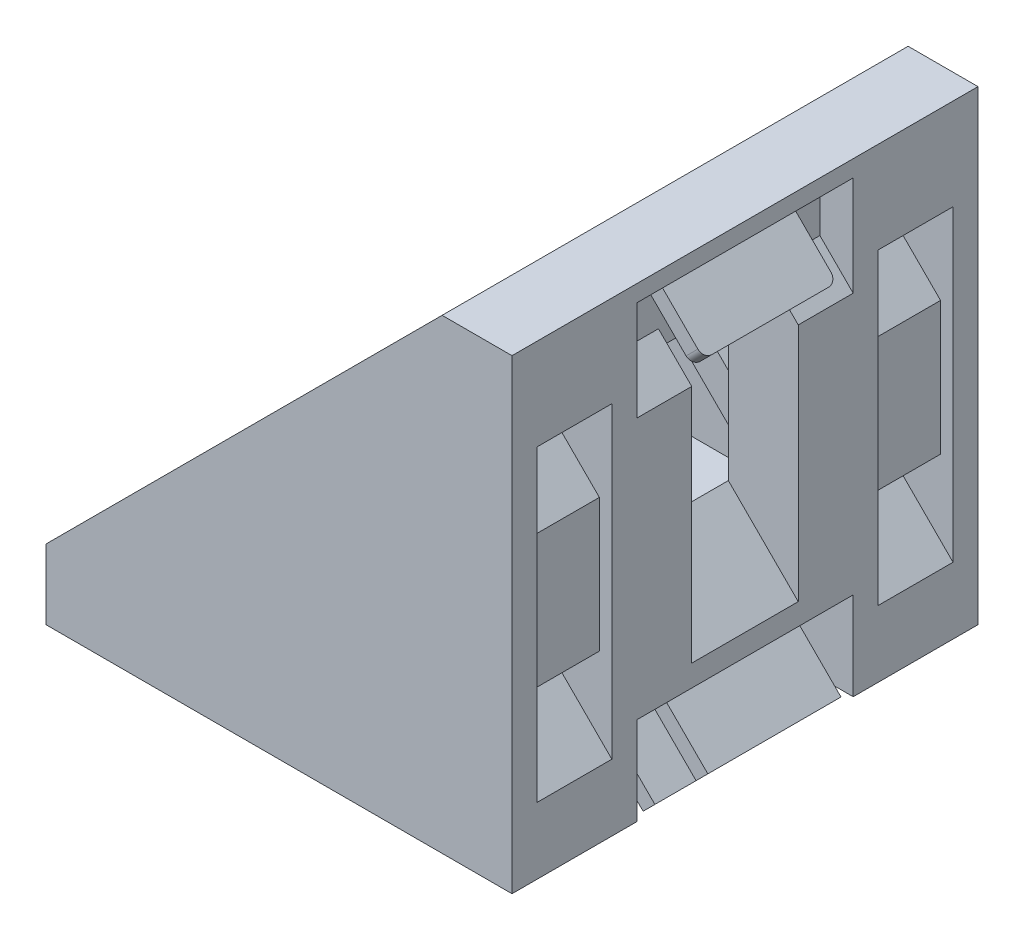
ISO-10303-21;
HEADER;
FILE_DESCRIPTION(('STEP AP214'),'2;1');
FILE_NAME('part.step','',(''),(''),'','','');
FILE_SCHEMA(('AUTOMOTIVE_DESIGN { 1 0 10303 214 1 1 1 1 }'));
ENDSEC;
DATA;
#1=APPLICATION_CONTEXT('core data for automotive mechanical design processes');
#2=APPLICATION_PROTOCOL_DEFINITION('international standard','automotive_design',2000,#1);
#3=PRODUCT_CONTEXT('',#1,'mechanical');
#4=PRODUCT('Part','Part','',(#3));
#5=PRODUCT_RELATED_PRODUCT_CATEGORY('part','',(#4));
#6=PRODUCT_DEFINITION_FORMATION('','',#4);
#7=PRODUCT_DEFINITION_CONTEXT('part definition',#1,'design');
#8=PRODUCT_DEFINITION('design','',#6,#7);
#9=PRODUCT_DEFINITION_SHAPE('','',#8);
#10=(LENGTH_UNIT() NAMED_UNIT(*) SI_UNIT(.MILLI.,.METRE.));
#11=(NAMED_UNIT(*) PLANE_ANGLE_UNIT() SI_UNIT($,.RADIAN.));
#12=(NAMED_UNIT(*) SI_UNIT($,.STERADIAN.) SOLID_ANGLE_UNIT());
#13=UNCERTAINTY_MEASURE_WITH_UNIT(LENGTH_MEASURE(1.E-05),#10,'distance_accuracy_value','');
#14=(GEOMETRIC_REPRESENTATION_CONTEXT(3) GLOBAL_UNCERTAINTY_ASSIGNED_CONTEXT((#13)) GLOBAL_UNIT_ASSIGNED_CONTEXT((#10,
#11,#12)) REPRESENTATION_CONTEXT('',''));
#15=CARTESIAN_POINT('',(0.,0.,0.));
#16=DIRECTION('',(0.,0.,1.));
#17=DIRECTION('',(1.,0.,0.));
#18=AXIS2_PLACEMENT_3D('',#15,#16,#17);
#19=CARTESIAN_POINT('',(-23.5705321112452,-1.52027957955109,-4.));
#20=DIRECTION('',(-0.707106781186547,0.707106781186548,0.));
#21=DIRECTION('',(0.,0.,1.));
#22=AXIS2_PLACEMENT_3D('',#19,#20,#21);
#23=PLANE('',#22);
#24=DIRECTION('',(-0.707106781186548,-0.707106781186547,0.));
#25=VECTOR('',#24,1.);
#26=CARTESIAN_POINT('',(-22.8634253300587,-0.81317279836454,-4.));
#27=LINE('',#26,#25);
#28=CARTESIAN_POINT('',(-22.8634253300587,-0.813172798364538,-4.));
#29=VERTEX_POINT('',#28);
#30=CARTESIAN_POINT('',(-23.5705321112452,-1.52027957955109,-4.));
#31=VERTEX_POINT('',#30);
#32=EDGE_CURVE('E875',#29,#31,#27,.T.);
#33=ORIENTED_EDGE('',*,*,#32,.F.);
#34=DIRECTION('',(0.,0.,-1.));
#35=VECTOR('',#34,1.);
#36=CARTESIAN_POINT('',(-22.8634253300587,-0.813172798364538,0.));
#37=LINE('',#36,#35);
#38=CARTESIAN_POINT('',(-22.8634253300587,-0.813172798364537,4.));
#39=VERTEX_POINT('',#38);
#40=EDGE_CURVE('E601',#39,#29,#37,.T.);
#41=ORIENTED_EDGE('',*,*,#40,.F.);
#42=DIRECTION('',(0.707106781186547,0.707106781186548,0.));
#43=VECTOR('',#42,1.);
#44=CARTESIAN_POINT('',(-23.5705321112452,-1.52027957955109,4.));
#45=LINE('',#44,#43);
#46=CARTESIAN_POINT('',(-23.5705321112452,-1.52027957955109,4.));
#47=VERTEX_POINT('',#46);
#48=EDGE_CURVE('E19',#47,#39,#45,.T.);
#49=ORIENTED_EDGE('',*,*,#48,.F.);
#50=DIRECTION('',(0.,0.,1.));
#51=VECTOR('',#50,1.);
#52=CARTESIAN_POINT('',(-23.5705321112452,-1.52027957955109,0.));
#53=LINE('',#52,#51);
#54=EDGE_CURVE('E586',#31,#47,#53,.T.);
#55=ORIENTED_EDGE('',*,*,#54,.F.);
#56=EDGE_LOOP('',(#33,#41,#49,#55));
#57=FACE_BOUND('',#56,.T.);
#58=ADVANCED_FACE('F15',(#57),#23,.F.);
#59=CARTESIAN_POINT('',(-26.0454058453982,1.66170093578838,4.));
#60=DIRECTION('',(0.,0.,1.));
#61=DIRECTION('',(0.,-1.,0.));
#62=AXIS2_PLACEMENT_3D('',#59,#60,#61);
#63=PLANE('',#62);
#64=DIRECTION('',(-0.707106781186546,-0.707106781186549,0.));
#65=VECTOR('',#64,1.);
#66=CARTESIAN_POINT('',(-25.3382990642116,1.66170093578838,4.));
#67=LINE('',#66,#65);
#68=CARTESIAN_POINT('',(-25.3382990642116,1.66170093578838,4.));
#69=VERTEX_POINT('',#68);
#70=CARTESIAN_POINT('',(-26.0454058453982,0.954594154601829,4.));
#71=VERTEX_POINT('',#70);
#72=EDGE_CURVE('E605',#69,#71,#67,.T.);
#73=ORIENTED_EDGE('',*,*,#72,.T.);
#74=DIRECTION('',(-0.707106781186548,0.707106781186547,0.));
#75=VECTOR('',#74,1.);
#76=CARTESIAN_POINT('',(-24.8079689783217,-0.282842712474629,4.));
#77=LINE('',#76,#75);
#78=EDGE_CURVE('E591',#47,#71,#77,.T.);
#79=ORIENTED_EDGE('',*,*,#78,.F.);
#80=ORIENTED_EDGE('',*,*,#48,.T.);
#81=DIRECTION('',(0.707106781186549,-0.707106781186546,0.));
#82=VECTOR('',#81,1.);
#83=CARTESIAN_POINT('',(-24.1008621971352,0.42426406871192,4.));
#84=LINE('',#83,#82);
#85=EDGE_CURVE('E597',#69,#39,#84,.T.);
#86=ORIENTED_EDGE('',*,*,#85,.F.);
#87=EDGE_LOOP('',(#73,#79,#80,#86));
#88=FACE_BOUND('',#87,.T.);
#89=ADVANCED_FACE('F606',(#88),#63,.T.);
#90=CARTESIAN_POINT('',(-26.0454058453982,-1.52027957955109,-4.));
#91=DIRECTION('',(0.,0.,-1.));
#92=DIRECTION('',(0.,1.,0.));
#93=AXIS2_PLACEMENT_3D('',#90,#91,#92);
#94=PLANE('',#93);
#95=DIRECTION('',(0.707106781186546,0.707106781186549,0.));
#96=VECTOR('',#95,1.);
#97=CARTESIAN_POINT('',(-26.0454058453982,0.954594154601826,-4.));
#98=LINE('',#97,#96);
#99=CARTESIAN_POINT('',(-26.0454058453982,0.954594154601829,-4.));
#100=VERTEX_POINT('',#99);
#101=CARTESIAN_POINT('',(-25.3382990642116,1.66170093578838,-4.));
#102=VERTEX_POINT('',#101);
#103=EDGE_CURVE('E872',#100,#102,#98,.T.);
#104=ORIENTED_EDGE('',*,*,#103,.T.);
#105=DIRECTION('',(-0.707106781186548,0.707106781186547,0.));
#106=VECTOR('',#105,1.);
#107=CARTESIAN_POINT('',(-24.1008621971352,0.42426406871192,-4.));
#108=LINE('',#107,#106);
#109=EDGE_CURVE('E619',#29,#102,#108,.T.);
#110=ORIENTED_EDGE('',*,*,#109,.F.);
#111=ORIENTED_EDGE('',*,*,#32,.T.);
#112=DIRECTION('',(0.707106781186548,-0.707106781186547,0.));
#113=VECTOR('',#112,1.);
#114=CARTESIAN_POINT('',(-24.8079689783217,-0.282842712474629,-4.));
#115=LINE('',#114,#113);
#116=EDGE_CURVE('E594',#100,#31,#115,.T.);
#117=ORIENTED_EDGE('',*,*,#116,.F.);
#118=EDGE_LOOP('',(#104,#110,#111,#117));
#119=FACE_BOUND('',#118,.T.);
#120=ADVANCED_FACE('F878',(#119),#94,.T.);
#121=CARTESIAN_POINT('',(-2.12132034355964,-1.76776695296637,-4.));
#122=DIRECTION('',(-0.707106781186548,0.707106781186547,0.));
#123=DIRECTION('',(0.,0.,1.));
#124=AXIS2_PLACEMENT_3D('',#121,#122,#123);
#125=PLANE('',#124);
#126=DIRECTION('',(0.707106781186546,0.707106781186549,0.));
#127=VECTOR('',#126,1.);
#128=CARTESIAN_POINT('',(-2.12132034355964,-1.76776695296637,4.));
#129=LINE('',#128,#127);
#130=CARTESIAN_POINT('',(-2.12132034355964,-1.76776695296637,4.));
#131=VERTEX_POINT('',#130);
#132=CARTESIAN_POINT('',(-1.41421356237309,-1.06066017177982,4.));
#133=VERTEX_POINT('',#132);
#134=EDGE_CURVE('E866',#131,#133,#129,.T.);
#135=ORIENTED_EDGE('',*,*,#134,.F.);
#136=DIRECTION('',(0.,0.,1.));
#137=VECTOR('',#136,1.);
#138=CARTESIAN_POINT('',(-2.12132034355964,-1.76776695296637,0.));
#139=LINE('',#138,#137);
#140=CARTESIAN_POINT('',(-2.12132034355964,-1.76776695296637,-4.));
#141=VERTEX_POINT('',#140);
#142=EDGE_CURVE('E643',#141,#131,#139,.T.);
#143=ORIENTED_EDGE('',*,*,#142,.F.);
#144=DIRECTION('',(-0.707106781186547,-0.707106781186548,0.));
#145=VECTOR('',#144,1.);
#146=CARTESIAN_POINT('',(-1.41421356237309,-1.06066017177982,-4.));
#147=LINE('',#146,#145);
#148=CARTESIAN_POINT('',(-1.41421356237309,-1.06066017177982,-4.));
#149=VERTEX_POINT('',#148);
#150=EDGE_CURVE('E870',#149,#141,#147,.T.);
#151=ORIENTED_EDGE('',*,*,#150,.F.);
#152=DIRECTION('',(0.,0.,-1.));
#153=VECTOR('',#152,1.);
#154=CARTESIAN_POINT('',(-1.41421356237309,-1.06066017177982,0.));
#155=LINE('',#154,#153);
#156=EDGE_CURVE('E628',#133,#149,#155,.T.);
#157=ORIENTED_EDGE('',*,*,#156,.F.);
#158=EDGE_LOOP('',(#135,#143,#151,#157));
#159=FACE_BOUND('',#158,.T.);
#160=ADVANCED_FACE('F1721',(#159),#125,.F.);
#161=CARTESIAN_POINT('',(-4.59619407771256,-1.76776695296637,-4.));
#162=DIRECTION('',(0.,0.,-1.));
#163=DIRECTION('',(0.,1.,0.));
#164=AXIS2_PLACEMENT_3D('',#161,#162,#163);
#165=PLANE('',#164);
#166=DIRECTION('',(0.707106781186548,0.707106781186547,0.));
#167=VECTOR('',#166,1.);
#168=CARTESIAN_POINT('',(-4.59619407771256,0.707106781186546,-4.));
#169=LINE('',#168,#167);
#170=CARTESIAN_POINT('',(-4.59619407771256,0.707106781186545,-4.));
#171=VERTEX_POINT('',#170);
#172=CARTESIAN_POINT('',(-3.88908729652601,1.41421356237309,-4.));
#173=VERTEX_POINT('',#172);
#174=EDGE_CURVE('E868',#171,#173,#169,.T.);
#175=ORIENTED_EDGE('',*,*,#174,.T.);
#176=DIRECTION('',(-0.707106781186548,0.707106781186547,0.));
#177=VECTOR('',#176,1.);
#178=CARTESIAN_POINT('',(-2.65165042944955,0.176776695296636,-4.));
#179=LINE('',#178,#177);
#180=EDGE_CURVE('E635',#149,#173,#179,.T.);
#181=ORIENTED_EDGE('',*,*,#180,.F.);
#182=ORIENTED_EDGE('',*,*,#150,.T.);
#183=DIRECTION('',(0.707106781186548,-0.707106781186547,0.));
#184=VECTOR('',#183,1.);
#185=CARTESIAN_POINT('',(-3.3587572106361,-0.530330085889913,-4.));
#186=LINE('',#185,#184);
#187=EDGE_CURVE('E625',#171,#141,#186,.T.);
#188=ORIENTED_EDGE('',*,*,#187,.F.);
#189=EDGE_LOOP('',(#175,#181,#182,#188));
#190=FACE_BOUND('',#189,.T.);
#191=ADVANCED_FACE('F1724',(#190),#165,.T.);
#192=CARTESIAN_POINT('',(-4.59619407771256,1.41421356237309,4.));
#193=DIRECTION('',(0.,0.,1.));
#194=DIRECTION('',(0.,-1.,0.));
#195=AXIS2_PLACEMENT_3D('',#192,#193,#194);
#196=PLANE('',#195);
#197=DIRECTION('',(-0.707106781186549,-0.707106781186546,0.));
#198=VECTOR('',#197,1.);
#199=CARTESIAN_POINT('',(-3.88908729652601,1.41421356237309,4.));
#200=LINE('',#199,#198);
#201=CARTESIAN_POINT('',(-3.88908729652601,1.41421356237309,4.));
#202=VERTEX_POINT('',#201);
#203=CARTESIAN_POINT('',(-4.59619407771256,0.707106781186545,4.));
#204=VERTEX_POINT('',#203);
#205=EDGE_CURVE('E863',#202,#204,#200,.T.);
#206=ORIENTED_EDGE('',*,*,#205,.T.);
#207=DIRECTION('',(-0.707106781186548,0.707106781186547,0.));
#208=VECTOR('',#207,1.);
#209=CARTESIAN_POINT('',(-3.3587572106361,-0.530330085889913,4.));
#210=LINE('',#209,#208);
#211=EDGE_CURVE('E629',#131,#204,#210,.T.);
#212=ORIENTED_EDGE('',*,*,#211,.F.);
#213=ORIENTED_EDGE('',*,*,#134,.T.);
#214=DIRECTION('',(0.707106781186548,-0.707106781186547,0.));
#215=VECTOR('',#214,1.);
#216=CARTESIAN_POINT('',(-2.65165042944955,0.176776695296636,4.));
#217=LINE('',#216,#215);
#218=EDGE_CURVE('E638',#202,#133,#217,.T.);
#219=ORIENTED_EDGE('',*,*,#218,.F.);
#220=EDGE_LOOP('',(#206,#212,#213,#219));
#221=FACE_BOUND('',#220,.T.);
#222=ADVANCED_FACE('F1714',(#221),#196,.T.);
#223=CARTESIAN_POINT('',(1.41421356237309,1.76776695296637,0.));
#224=DIRECTION('',(-0.707106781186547,0.707106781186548,0.));
#225=DIRECTION('',(-0.707106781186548,-0.707106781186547,0.));
#226=AXIS2_PLACEMENT_3D('',#223,#224,#225);
#227=PLANE('',#226);
#228=DIRECTION('',(-0.707106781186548,-0.707106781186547,0.));
#229=VECTOR('',#228,1.);
#230=CARTESIAN_POINT('',(1.76776695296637,2.12132034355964,-4.));
#231=LINE('',#230,#229);
#232=CARTESIAN_POINT('',(1.76776695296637,2.12132034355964,-4.));
#233=VERTEX_POINT('',#232);
#234=CARTESIAN_POINT('',(1.06066017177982,1.41421356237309,-4.));
#235=VERTEX_POINT('',#234);
#236=EDGE_CURVE('E1188',#233,#235,#231,.T.);
#237=ORIENTED_EDGE('',*,*,#236,.F.);
#238=DIRECTION('',(0.,0.,1.));
#239=VECTOR('',#238,1.);
#240=CARTESIAN_POINT('',(1.76776695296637,2.12132034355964,4.));
#241=LINE('',#240,#239);
#242=CARTESIAN_POINT('',(1.76776695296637,2.12132034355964,4.));
#243=VERTEX_POINT('',#242);
#244=EDGE_CURVE('E648',#243,#233,#241,.F.);
#245=ORIENTED_EDGE('',*,*,#244,.F.);
#246=DIRECTION('',(0.707106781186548,0.707106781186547,0.));
#247=VECTOR('',#246,1.);
#248=CARTESIAN_POINT('',(1.06066017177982,1.41421356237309,4.));
#249=LINE('',#248,#247);
#250=CARTESIAN_POINT('',(1.06066017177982,1.41421356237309,4.));
#251=VERTEX_POINT('',#250);
#252=EDGE_CURVE('E865',#251,#243,#249,.T.);
#253=ORIENTED_EDGE('',*,*,#252,.F.);
#254=DIRECTION('',(0.,0.,1.));
#255=VECTOR('',#254,1.);
#256=CARTESIAN_POINT('',(1.06066017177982,1.41421356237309,-4.));
#257=LINE('',#256,#255);
#258=EDGE_CURVE('E1101',#235,#251,#257,.T.);
#259=ORIENTED_EDGE('',*,*,#258,.F.);
#260=EDGE_LOOP('',(#237,#245,#253,#259));
#261=FACE_BOUND('',#260,.T.);
#262=ADVANCED_FACE('F1205',(#261),#227,.F.);
#263=CARTESIAN_POINT('',(-1.41421356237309,3.88908729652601,4.));
#264=DIRECTION('',(0.,0.,1.));
#265=DIRECTION('',(1.,0.,0.));
#266=AXIS2_PLACEMENT_3D('',#263,#264,#265);
#267=PLANE('',#266);
#268=DIRECTION('',(-0.707106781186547,-0.707106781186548,0.));
#269=VECTOR('',#268,1.);
#270=CARTESIAN_POINT('',(-0.707106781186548,4.59619407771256,4.));
#271=LINE('',#270,#269);
#272=CARTESIAN_POINT('',(-0.707106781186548,4.59619407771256,4.));
#273=VERTEX_POINT('',#272);
#274=CARTESIAN_POINT('',(-1.41421356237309,3.88908729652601,4.));
#275=VERTEX_POINT('',#274);
#276=EDGE_CURVE('E1190',#273,#275,#271,.T.);
#277=ORIENTED_EDGE('',*,*,#276,.T.);
#278=DIRECTION('',(0.707106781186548,-0.707106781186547,0.));
#279=VECTOR('',#278,1.);
#280=CARTESIAN_POINT('',(-1.41421356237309,3.88908729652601,4.));
#281=LINE('',#280,#279);
#282=EDGE_CURVE('E1098',#251,#275,#281,.F.);
#283=ORIENTED_EDGE('',*,*,#282,.F.);
#284=ORIENTED_EDGE('',*,*,#252,.T.);
#285=DIRECTION('',(-0.707106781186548,0.707106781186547,0.));
#286=VECTOR('',#285,1.);
#287=CARTESIAN_POINT('',(-0.707106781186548,4.59619407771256,4.));
#288=LINE('',#287,#286);
#289=EDGE_CURVE('E1103',#273,#243,#288,.F.);
#290=ORIENTED_EDGE('',*,*,#289,.F.);
#291=EDGE_LOOP('',(#277,#283,#284,#290));
#292=FACE_BOUND('',#291,.T.);
#293=ADVANCED_FACE('F1196',(#292),#267,.T.);
#294=CARTESIAN_POINT('',(-0.707106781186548,4.59619407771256,-4.));
#295=DIRECTION('',(0.,0.,-1.));
#296=DIRECTION('',(-1.,0.,0.));
#297=AXIS2_PLACEMENT_3D('',#294,#295,#296);
#298=PLANE('',#297);
#299=DIRECTION('',(0.707106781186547,0.707106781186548,0.));
#300=VECTOR('',#299,1.);
#301=CARTESIAN_POINT('',(-1.41421356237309,3.88908729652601,-4.));
#302=LINE('',#301,#300);
#303=CARTESIAN_POINT('',(-1.41421356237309,3.88908729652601,-4.));
#304=VERTEX_POINT('',#303);
#305=CARTESIAN_POINT('',(-0.707106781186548,4.59619407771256,-4.));
#306=VERTEX_POINT('',#305);
#307=EDGE_CURVE('E1178',#304,#306,#302,.T.);
#308=ORIENTED_EDGE('',*,*,#307,.T.);
#309=DIRECTION('',(-0.707106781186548,0.707106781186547,0.));
#310=VECTOR('',#309,1.);
#311=CARTESIAN_POINT('',(-0.707106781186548,4.59619407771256,-4.));
#312=LINE('',#311,#310);
#313=EDGE_CURVE('E1106',#233,#306,#312,.T.);
#314=ORIENTED_EDGE('',*,*,#313,.F.);
#315=ORIENTED_EDGE('',*,*,#236,.T.);
#316=DIRECTION('',(0.707106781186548,-0.707106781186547,0.));
#317=VECTOR('',#316,1.);
#318=CARTESIAN_POINT('',(-1.41421356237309,3.88908729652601,-4.));
#319=LINE('',#318,#317);
#320=EDGE_CURVE('E692',#304,#235,#319,.T.);
#321=ORIENTED_EDGE('',*,*,#320,.F.);
#322=EDGE_LOOP('',(#308,#314,#315,#321));
#323=FACE_BOUND('',#322,.T.);
#324=ADVANCED_FACE('F1209',(#323),#298,.T.);
#325=CARTESIAN_POINT('',(0.989949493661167,23.7473088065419,-3.5));
#326=DIRECTION('',(-0.707106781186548,-0.707106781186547,0.));
#327=DIRECTION('',(0.707106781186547,-0.707106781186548,0.));
#328=AXIS2_PLACEMENT_3D('',#325,#326,#327);
#329=CYLINDRICAL_SURFACE('',#328,0.5);
#330=CARTESIAN_POINT('',(1.1667261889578,23.9240855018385,-3.5));
#331=DIRECTION('',(-0.707106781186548,-0.707106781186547,0.));
#332=DIRECTION('',(0.707106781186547,-0.707106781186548,0.));
#333=AXIS2_PLACEMENT_3D('',#330,#331,#332);
#334=CIRCLE('',#333,0.5);
#335=CARTESIAN_POINT('',(1.52027957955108,23.5705321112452,-3.5));
#336=VERTEX_POINT('',#335);
#337=CARTESIAN_POINT('',(1.1667261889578,23.9240855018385,-4.));
#338=VERTEX_POINT('',#337);
#339=EDGE_CURVE('E851',#336,#338,#334,.F.);
#340=ORIENTED_EDGE('',*,*,#339,.F.);
#341=DIRECTION('',(-0.707106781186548,-0.707106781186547,0.));
#342=VECTOR('',#341,1.);
#343=CARTESIAN_POINT('',(1.16672618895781,23.216978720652,-3.5));
#344=LINE('',#343,#342);
#345=CARTESIAN_POINT('',(0.813172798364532,22.8634253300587,-3.5));
#346=VERTEX_POINT('',#345);
#347=EDGE_CURVE('E1153',#336,#346,#344,.T.);
#348=ORIENTED_EDGE('',*,*,#347,.T.);
#349=CARTESIAN_POINT('',(0.459619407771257,23.216978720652,-3.5));
#350=DIRECTION('',(-0.707106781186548,-0.707106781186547,0.));
#351=DIRECTION('',(0.707106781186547,-0.707106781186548,0.));
#352=AXIS2_PLACEMENT_3D('',#349,#350,#351);
#353=CIRCLE('',#352,0.5);
#354=CARTESIAN_POINT('',(0.459619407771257,23.216978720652,-4.));
#355=VERTEX_POINT('',#354);
#356=EDGE_CURVE('E860',#355,#346,#353,.T.);
#357=ORIENTED_EDGE('',*,*,#356,.F.);
#358=DIRECTION('',(-0.707106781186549,-0.707106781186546,0.));
#359=VECTOR('',#358,1.);
#360=CARTESIAN_POINT('',(1.1667261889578,23.9240855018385,-4.));
#361=LINE('',#360,#359);
#362=EDGE_CURVE('E1176',#338,#355,#361,.T.);
#363=ORIENTED_EDGE('',*,*,#362,.F.);
#364=EDGE_LOOP('',(#340,#348,#357,#363));
#365=FACE_BOUND('',#364,.T.);
#366=ADVANCED_FACE('F1703',(#365),#329,.T.);
#367=CARTESIAN_POINT('',(-0.954594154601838,26.0454058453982,-4.));
#368=DIRECTION('',(0.,0.,-1.));
#369=DIRECTION('',(-1.,0.,0.));
#370=AXIS2_PLACEMENT_3D('',#367,#368,#369);
#371=PLANE('',#370);
#372=DIRECTION('',(0.707106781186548,0.707106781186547,0.));
#373=VECTOR('',#372,1.);
#374=CARTESIAN_POINT('',(-1.66170093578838,25.3382990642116,-4.));
#375=LINE('',#374,#373);
#376=CARTESIAN_POINT('',(-1.66170093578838,25.3382990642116,-4.));
#377=VERTEX_POINT('',#376);
#378=CARTESIAN_POINT('',(-0.954594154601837,26.0454058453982,-4.));
#379=VERTEX_POINT('',#378);
#380=EDGE_CURVE('E1166',#377,#379,#375,.T.);
#381=ORIENTED_EDGE('',*,*,#380,.T.);
#382=DIRECTION('',(-0.707106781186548,0.707106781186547,0.));
#383=VECTOR('',#382,1.);
#384=CARTESIAN_POINT('',(-0.954594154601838,26.0454058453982,-4.));
#385=LINE('',#384,#383);
#386=EDGE_CURVE('E853',#338,#379,#385,.T.);
#387=ORIENTED_EDGE('',*,*,#386,.F.);
#388=ORIENTED_EDGE('',*,*,#362,.T.);
#389=DIRECTION('',(0.707106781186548,-0.707106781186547,0.));
#390=VECTOR('',#389,1.);
#391=CARTESIAN_POINT('',(-1.66170093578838,25.3382990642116,-4.));
#392=LINE('',#391,#390);
#393=EDGE_CURVE('E854',#377,#355,#392,.T.);
#394=ORIENTED_EDGE('',*,*,#393,.F.);
#395=EDGE_LOOP('',(#381,#387,#388,#394));
#396=FACE_BOUND('',#395,.T.);
#397=ADVANCED_FACE('F1699',(#396),#371,.T.);
#398=CARTESIAN_POINT('',(-1.66170093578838,25.3382990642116,4.));
#399=DIRECTION('',(0.,0.,1.));
#400=DIRECTION('',(1.,0.,0.));
#401=AXIS2_PLACEMENT_3D('',#398,#399,#400);
#402=PLANE('',#401);
#403=DIRECTION('',(-0.707106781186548,-0.707106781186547,0.));
#404=VECTOR('',#403,1.);
#405=CARTESIAN_POINT('',(-0.954594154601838,26.0454058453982,4.));
#406=LINE('',#405,#404);
#407=CARTESIAN_POINT('',(-0.954594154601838,26.0454058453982,4.));
#408=VERTEX_POINT('',#407);
#409=CARTESIAN_POINT('',(-1.66170093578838,25.3382990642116,4.));
#410=VERTEX_POINT('',#409);
#411=EDGE_CURVE('E1164',#408,#410,#406,.T.);
#412=ORIENTED_EDGE('',*,*,#411,.T.);
#413=DIRECTION('',(0.707106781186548,-0.707106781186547,0.));
#414=VECTOR('',#413,1.);
#415=CARTESIAN_POINT('',(-1.66170093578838,25.3382990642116,4.));
#416=LINE('',#415,#414);
#417=CARTESIAN_POINT('',(0.459619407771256,23.216978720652,4.));
#418=VERTEX_POINT('',#417);
#419=EDGE_CURVE('E858',#418,#410,#416,.F.);
#420=ORIENTED_EDGE('',*,*,#419,.F.);
#421=DIRECTION('',(0.707106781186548,0.707106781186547,0.));
#422=VECTOR('',#421,1.);
#423=CARTESIAN_POINT('',(0.636396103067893,23.3937554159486,4.));
#424=LINE('',#423,#422);
#425=CARTESIAN_POINT('',(1.1667261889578,23.9240855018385,4.));
#426=VERTEX_POINT('',#425);
#427=EDGE_CURVE('E1160',#426,#418,#424,.F.);
#428=ORIENTED_EDGE('',*,*,#427,.F.);
#429=DIRECTION('',(-0.707106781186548,0.707106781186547,0.));
#430=VECTOR('',#429,1.);
#431=CARTESIAN_POINT('',(-0.954594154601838,26.0454058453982,4.));
#432=LINE('',#431,#430);
#433=EDGE_CURVE('E850',#408,#426,#432,.F.);
#434=ORIENTED_EDGE('',*,*,#433,.F.);
#435=EDGE_LOOP('',(#412,#420,#428,#434));
#436=FACE_BOUND('',#435,.T.);
#437=ADVANCED_FACE('F1695',(#436),#402,.T.);
#438=CARTESIAN_POINT('',(0.636396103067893,23.3937554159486,3.5));
#439=DIRECTION('',(0.707106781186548,0.707106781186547,0.));
#440=DIRECTION('',(-0.707106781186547,0.707106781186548,0.));
#441=AXIS2_PLACEMENT_3D('',#438,#439,#440);
#442=CYLINDRICAL_SURFACE('',#441,0.5);
#443=CARTESIAN_POINT('',(0.459619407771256,23.216978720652,3.5));
#444=DIRECTION('',(0.707106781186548,0.707106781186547,0.));
#445=DIRECTION('',(-0.707106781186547,0.707106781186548,0.));
#446=AXIS2_PLACEMENT_3D('',#443,#444,#445);
#447=CIRCLE('',#446,0.5);
#448=CARTESIAN_POINT('',(0.813172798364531,22.8634253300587,3.5));
#449=VERTEX_POINT('',#448);
#450=EDGE_CURVE('E855',#449,#418,#447,.F.);
#451=ORIENTED_EDGE('',*,*,#450,.F.);
#452=DIRECTION('',(-0.707106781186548,-0.707106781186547,0.));
#453=VECTOR('',#452,1.);
#454=CARTESIAN_POINT('',(1.16672618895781,23.216978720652,3.5));
#455=LINE('',#454,#453);
#456=CARTESIAN_POINT('',(1.52027957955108,23.5705321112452,3.5));
#457=VERTEX_POINT('',#456);
#458=EDGE_CURVE('E1157',#449,#457,#455,.F.);
#459=ORIENTED_EDGE('',*,*,#458,.T.);
#460=CARTESIAN_POINT('',(1.1667261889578,23.9240855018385,3.5));
#461=DIRECTION('',(0.707106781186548,0.707106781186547,0.));
#462=DIRECTION('',(-0.707106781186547,0.707106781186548,0.));
#463=AXIS2_PLACEMENT_3D('',#460,#461,#462);
#464=CIRCLE('',#463,0.5);
#465=EDGE_CURVE('E848',#426,#457,#464,.T.);
#466=ORIENTED_EDGE('',*,*,#465,.F.);
#467=ORIENTED_EDGE('',*,*,#427,.T.);
#468=EDGE_LOOP('',(#451,#459,#466,#467));
#469=FACE_BOUND('',#468,.T.);
#470=ADVANCED_FACE('F1691',(#469),#442,.T.);
#471=CARTESIAN_POINT('',(1.16672618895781,23.216978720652,0.));
#472=DIRECTION('',(-0.707106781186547,0.707106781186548,0.));
#473=DIRECTION('',(-0.707106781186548,-0.707106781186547,0.));
#474=AXIS2_PLACEMENT_3D('',#471,#472,#473);
#475=PLANE('',#474);
#476=DIRECTION('',(0.,0.,1.));
#477=VECTOR('',#476,1.);
#478=CARTESIAN_POINT('',(1.52027957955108,23.5705321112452,4.));
#479=LINE('',#478,#477);
#480=EDGE_CURVE('E847',#457,#336,#479,.F.);
#481=ORIENTED_EDGE('',*,*,#480,.F.);
#482=ORIENTED_EDGE('',*,*,#458,.F.);
#483=DIRECTION('',(0.,0.,1.));
#484=VECTOR('',#483,1.);
#485=CARTESIAN_POINT('',(0.813172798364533,22.8634253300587,-4.));
#486=LINE('',#485,#484);
#487=EDGE_CURVE('E859',#346,#449,#486,.T.);
#488=ORIENTED_EDGE('',*,*,#487,.F.);
#489=ORIENTED_EDGE('',*,*,#347,.F.);
#490=EDGE_LOOP('',(#481,#482,#488,#489));
#491=FACE_BOUND('',#490,.T.);
#492=ADVANCED_FACE('F1687',(#491),#475,.F.);
#493=CARTESIAN_POINT('',(-13.4483495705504,18.044543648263,10.25));
#494=DIRECTION('',(0.707106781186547,0.707106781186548,0.));
#495=DIRECTION('',(0.,0.,1.));
#496=AXIS2_PLACEMENT_3D('',#493,#494,#495);
#497=PLANE('',#496);
#498=DIRECTION('',(0.707106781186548,-0.707106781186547,0.));
#499=VECTOR('',#498,1.);
#500=CARTESIAN_POINT('',(-13.4483495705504,18.044543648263,11.));
#501=LINE('',#500,#499);
#502=CARTESIAN_POINT('',(-13.4483495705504,18.044543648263,11.));
#503=VERTEX_POINT('',#502);
#504=CARTESIAN_POINT('',(-4.19999999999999,8.79619407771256,11.));
#505=VERTEX_POINT('',#504);
#506=EDGE_CURVE('E821',#503,#505,#501,.T.);
#507=ORIENTED_EDGE('',*,*,#506,.T.);
#508=DIRECTION('',(0.,0.,-1.));
#509=VECTOR('',#508,1.);
#510=CARTESIAN_POINT('',(-4.19999999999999,8.79619407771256,10.625));
#511=LINE('',#510,#509);
#512=CARTESIAN_POINT('',(-4.19999999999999,8.79619407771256,10.25));
#513=VERTEX_POINT('',#512);
#514=EDGE_CURVE('E1150',#505,#513,#511,.T.);
#515=ORIENTED_EDGE('',*,*,#514,.T.);
#516=DIRECTION('',(0.707106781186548,-0.707106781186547,0.));
#517=VECTOR('',#516,1.);
#518=CARTESIAN_POINT('',(-13.4483495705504,18.044543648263,10.25));
#519=LINE('',#518,#517);
#520=CARTESIAN_POINT('',(-13.4483495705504,18.044543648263,10.25));
#521=VERTEX_POINT('',#520);
#522=EDGE_CURVE('E832',#521,#513,#519,.T.);
#523=ORIENTED_EDGE('',*,*,#522,.F.);
#524=DIRECTION('',(0.,0.,1.));
#525=VECTOR('',#524,1.);
#526=CARTESIAN_POINT('',(-13.4483495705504,18.044543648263,10.625));
#527=LINE('',#526,#525);
#528=EDGE_CURVE('E1151',#521,#503,#527,.T.);
#529=ORIENTED_EDGE('',*,*,#528,.T.);
#530=EDGE_LOOP('',(#507,#515,#523,#529));
#531=FACE_BOUND('',#530,.T.);
#532=ADVANCED_FACE('F1690',(#531),#497,.T.);
#533=CARTESIAN_POINT('',(-16.6303300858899,14.8625631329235,10.25));
#534=DIRECTION('',(0.707106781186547,0.707106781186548,0.));
#535=DIRECTION('',(0.,0.,1.));
#536=AXIS2_PLACEMENT_3D('',#533,#534,#535);
#537=PLANE('',#536);
#538=DIRECTION('',(0.707106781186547,-0.707106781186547,0.));
#539=VECTOR('',#538,1.);
#540=CARTESIAN_POINT('',(-16.6303300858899,14.8625631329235,11.));
#541=LINE('',#540,#539);
#542=CARTESIAN_POINT('',(-16.6303300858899,14.8625631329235,11.));
#543=VERTEX_POINT('',#542);
#544=CARTESIAN_POINT('',(-8.67537879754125,6.90761184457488,11.));
#545=VERTEX_POINT('',#544);
#546=EDGE_CURVE('E810',#543,#545,#541,.T.);
#547=ORIENTED_EDGE('',*,*,#546,.T.);
#548=DIRECTION('',(0.,0.,1.));
#549=VECTOR('',#548,1.);
#550=CARTESIAN_POINT('',(-8.67537879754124,6.90761184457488,10.625));
#551=LINE('',#550,#549);
#552=CARTESIAN_POINT('',(-8.67537879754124,6.90761184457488,10.25));
#553=VERTEX_POINT('',#552);
#554=EDGE_CURVE('E1146',#553,#545,#551,.T.);
#555=ORIENTED_EDGE('',*,*,#554,.F.);
#556=DIRECTION('',(0.707106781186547,-0.707106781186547,0.));
#557=VECTOR('',#556,1.);
#558=CARTESIAN_POINT('',(-16.6303300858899,14.8625631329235,10.25));
#559=LINE('',#558,#557);
#560=CARTESIAN_POINT('',(-16.6303300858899,14.8625631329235,10.25));
#561=VERTEX_POINT('',#560);
#562=EDGE_CURVE('E841',#561,#553,#559,.T.);
#563=ORIENTED_EDGE('',*,*,#562,.F.);
#564=DIRECTION('',(0.,0.,1.));
#565=VECTOR('',#564,1.);
#566=CARTESIAN_POINT('',(-16.6303300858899,14.8625631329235,10.625));
#567=LINE('',#566,#565);
#568=EDGE_CURVE('E1148',#561,#543,#567,.T.);
#569=ORIENTED_EDGE('',*,*,#568,.T.);
#570=EDGE_LOOP('',(#547,#555,#563,#569));
#571=FACE_BOUND('',#570,.T.);
#572=ADVANCED_FACE('F1734',(#571),#537,.T.);
#573=CARTESIAN_POINT('',(-7.79149532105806,7.79149532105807,10.25));
#574=DIRECTION('',(0.,0.,1.));
#575=DIRECTION('',(1.,0.,0.));
#576=AXIS2_PLACEMENT_3D('',#573,#574,#575);
#577=CYLINDRICAL_SURFACE('',#576,1.25);
#578=CARTESIAN_POINT('',(-7.79149532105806,7.79149532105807,11.));
#579=DIRECTION('',(0.,0.,1.));
#580=DIRECTION('',(1.,0.,0.));
#581=AXIS2_PLACEMENT_3D('',#578,#579,#580);
#582=CIRCLE('',#581,1.25);
#583=CARTESIAN_POINT('',(-6.90761184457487,8.67537879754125,11.));
#584=VERTEX_POINT('',#583);
#585=EDGE_CURVE('E807',#545,#584,#582,.T.);
#586=ORIENTED_EDGE('',*,*,#585,.T.);
#587=DIRECTION('',(0.,0.,1.));
#588=VECTOR('',#587,1.);
#589=CARTESIAN_POINT('',(-6.90761184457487,8.67537879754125,10.625));
#590=LINE('',#589,#588);
#591=CARTESIAN_POINT('',(-6.90761184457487,8.67537879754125,10.25));
#592=VERTEX_POINT('',#591);
#593=EDGE_CURVE('E1141',#592,#584,#590,.T.);
#594=ORIENTED_EDGE('',*,*,#593,.F.);
#595=CARTESIAN_POINT('',(-7.79149532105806,7.79149532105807,10.25));
#596=DIRECTION('',(0.,0.,1.));
#597=DIRECTION('',(1.,0.,0.));
#598=AXIS2_PLACEMENT_3D('',#595,#596,#597);
#599=CIRCLE('',#598,1.25);
#600=EDGE_CURVE('E839',#553,#592,#599,.T.);
#601=ORIENTED_EDGE('',*,*,#600,.F.);
#602=ORIENTED_EDGE('',*,*,#554,.T.);
#603=EDGE_LOOP('',(#586,#594,#601,#602));
#604=FACE_BOUND('',#603,.T.);
#605=ADVANCED_FACE('F1738',(#604),#577,.F.);
#606=CARTESIAN_POINT('',(-14.8625631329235,16.6303300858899,11.));
#607=DIRECTION('',(-0.707106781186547,-0.707106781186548,0.));
#608=DIRECTION('',(0.,0.,-1.));
#609=AXIS2_PLACEMENT_3D('',#606,#607,#608);
#610=PLANE('',#609);
#611=DIRECTION('',(-0.707106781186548,0.707106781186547,0.));
#612=VECTOR('',#611,1.);
#613=CARTESIAN_POINT('',(-6.90761184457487,8.67537879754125,11.));
#614=LINE('',#613,#612);
#615=CARTESIAN_POINT('',(-14.8625631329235,16.6303300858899,11.));
#616=VERTEX_POINT('',#615);
#617=EDGE_CURVE('E806',#584,#616,#614,.T.);
#618=ORIENTED_EDGE('',*,*,#617,.T.);
#619=DIRECTION('',(0.,0.,1.));
#620=VECTOR('',#619,1.);
#621=CARTESIAN_POINT('',(-14.8625631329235,16.6303300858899,10.625));
#622=LINE('',#621,#620);
#623=CARTESIAN_POINT('',(-14.8625631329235,16.6303300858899,10.25));
#624=VERTEX_POINT('',#623);
#625=EDGE_CURVE('E814',#624,#616,#622,.T.);
#626=ORIENTED_EDGE('',*,*,#625,.F.);
#627=DIRECTION('',(-0.707106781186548,0.707106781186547,0.));
#628=VECTOR('',#627,1.);
#629=CARTESIAN_POINT('',(-6.90761184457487,8.67537879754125,10.25));
#630=LINE('',#629,#628);
#631=EDGE_CURVE('E837',#592,#624,#630,.T.);
#632=ORIENTED_EDGE('',*,*,#631,.F.);
#633=ORIENTED_EDGE('',*,*,#593,.T.);
#634=EDGE_LOOP('',(#618,#626,#632,#633));
#635=FACE_BOUND('',#634,.T.);
#636=ADVANCED_FACE('F1742',(#635),#610,.T.);
#637=CARTESIAN_POINT('',(-18.044543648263,13.4483495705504,11.));
#638=DIRECTION('',(-0.707106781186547,-0.707106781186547,0.));
#639=DIRECTION('',(0.,0.,-1.));
#640=AXIS2_PLACEMENT_3D('',#637,#638,#639);
#641=PLANE('',#640);
#642=DIRECTION('',(-0.707106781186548,0.707106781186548,0.));
#643=VECTOR('',#642,1.);
#644=CARTESIAN_POINT('',(-8.79619407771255,4.2,11.));
#645=LINE('',#644,#643);
#646=CARTESIAN_POINT('',(-8.79619407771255,4.19999999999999,11.));
#647=VERTEX_POINT('',#646);
#648=CARTESIAN_POINT('',(-18.044543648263,13.4483495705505,11.));
#649=VERTEX_POINT('',#648);
#650=EDGE_CURVE('E792',#647,#649,#645,.T.);
#651=ORIENTED_EDGE('',*,*,#650,.T.);
#652=DIRECTION('',(0.,0.,1.));
#653=VECTOR('',#652,1.);
#654=CARTESIAN_POINT('',(-18.044543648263,13.4483495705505,10.625));
#655=LINE('',#654,#653);
#656=CARTESIAN_POINT('',(-18.044543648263,13.4483495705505,10.25));
#657=VERTEX_POINT('',#656);
#658=EDGE_CURVE('E796',#657,#649,#655,.T.);
#659=ORIENTED_EDGE('',*,*,#658,.F.);
#660=DIRECTION('',(-0.707106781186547,0.707106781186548,0.));
#661=VECTOR('',#660,1.);
#662=CARTESIAN_POINT('',(-8.79619407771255,4.2,10.25));
#663=LINE('',#662,#661);
#664=CARTESIAN_POINT('',(-8.79619407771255,4.2,10.25));
#665=VERTEX_POINT('',#664);
#666=EDGE_CURVE('E845',#665,#657,#663,.T.);
#667=ORIENTED_EDGE('',*,*,#666,.F.);
#668=DIRECTION('',(0.,0.,1.));
#669=VECTOR('',#668,1.);
#670=CARTESIAN_POINT('',(-8.79619407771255,4.2,10.625));
#671=LINE('',#670,#669);
#672=EDGE_CURVE('E1135',#665,#647,#671,.T.);
#673=ORIENTED_EDGE('',*,*,#672,.T.);
#674=EDGE_LOOP('',(#651,#659,#667,#673));
#675=FACE_BOUND('',#674,.T.);
#676=ADVANCED_FACE('F1685',(#675),#641,.T.);
#677=CARTESIAN_POINT('',(-8.79619407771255,4.2,-11.));
#678=DIRECTION('',(-0.707106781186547,-0.707106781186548,0.));
#679=DIRECTION('',(0.707106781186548,-0.707106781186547,0.));
#680=AXIS2_PLACEMENT_3D('',#677,#678,#679);
#681=PLANE('',#680);
#682=DIRECTION('',(0.707106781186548,-0.707106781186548,0.));
#683=VECTOR('',#682,1.);
#684=CARTESIAN_POINT('',(-18.044543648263,13.4483495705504,-11.));
#685=LINE('',#684,#683);
#686=CARTESIAN_POINT('',(-18.044543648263,13.4483495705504,-11.));
#687=VERTEX_POINT('',#686);
#688=CARTESIAN_POINT('',(-8.79619407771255,4.2,-11.));
#689=VERTEX_POINT('',#688);
#690=EDGE_CURVE('E788',#687,#689,#685,.T.);
#691=ORIENTED_EDGE('',*,*,#690,.T.);
#692=DIRECTION('',(0.,0.,1.));
#693=VECTOR('',#692,1.);
#694=CARTESIAN_POINT('',(-8.79619407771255,4.2,-11.));
#695=LINE('',#694,#693);
#696=CARTESIAN_POINT('',(-8.79619407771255,4.2,-10.25));
#697=VERTEX_POINT('',#696);
#698=EDGE_CURVE('E1132',#689,#697,#695,.T.);
#699=ORIENTED_EDGE('',*,*,#698,.T.);
#700=DIRECTION('',(0.707106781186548,-0.707106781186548,0.));
#701=VECTOR('',#700,1.);
#702=CARTESIAN_POINT('',(-18.044543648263,13.4483495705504,-10.25));
#703=LINE('',#702,#701);
#704=CARTESIAN_POINT('',(-18.044543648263,13.4483495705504,-10.25));
#705=VERTEX_POINT('',#704);
#706=EDGE_CURVE('E1048',#705,#697,#703,.T.);
#707=ORIENTED_EDGE('',*,*,#706,.F.);
#708=DIRECTION('',(0.,0.,1.));
#709=VECTOR('',#708,1.);
#710=CARTESIAN_POINT('',(-18.044543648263,13.4483495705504,-11.));
#711=LINE('',#710,#709);
#712=EDGE_CURVE('E1133',#705,#687,#711,.F.);
#713=ORIENTED_EDGE('',*,*,#712,.T.);
#714=EDGE_LOOP('',(#691,#699,#707,#713));
#715=FACE_BOUND('',#714,.T.);
#716=ADVANCED_FACE('F1681',(#715),#681,.T.);
#717=CARTESIAN_POINT('',(-6.90761184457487,8.67537879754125,-11.));
#718=DIRECTION('',(-0.707106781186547,-0.707106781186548,0.));
#719=DIRECTION('',(0.707106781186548,-0.707106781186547,0.));
#720=AXIS2_PLACEMENT_3D('',#717,#718,#719);
#721=PLANE('',#720);
#722=DIRECTION('',(0.707106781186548,-0.707106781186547,0.));
#723=VECTOR('',#722,1.);
#724=CARTESIAN_POINT('',(-14.8625631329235,16.6303300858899,-11.));
#725=LINE('',#724,#723);
#726=CARTESIAN_POINT('',(-14.8625631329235,16.6303300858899,-11.));
#727=VERTEX_POINT('',#726);
#728=CARTESIAN_POINT('',(-6.90761184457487,8.67537879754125,-11.));
#729=VERTEX_POINT('',#728);
#730=EDGE_CURVE('E777',#727,#729,#725,.T.);
#731=ORIENTED_EDGE('',*,*,#730,.T.);
#732=DIRECTION('',(0.,0.,1.));
#733=VECTOR('',#732,1.);
#734=CARTESIAN_POINT('',(-6.90761184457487,8.67537879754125,-11.));
#735=LINE('',#734,#733);
#736=CARTESIAN_POINT('',(-6.90761184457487,8.67537879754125,-10.25));
#737=VERTEX_POINT('',#736);
#738=EDGE_CURVE('E1127',#729,#737,#735,.T.);
#739=ORIENTED_EDGE('',*,*,#738,.T.);
#740=DIRECTION('',(0.707106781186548,-0.707106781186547,0.));
#741=VECTOR('',#740,1.);
#742=CARTESIAN_POINT('',(-14.8625631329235,16.6303300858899,-10.25));
#743=LINE('',#742,#741);
#744=CARTESIAN_POINT('',(-14.8625631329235,16.6303300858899,-10.25));
#745=VERTEX_POINT('',#744);
#746=EDGE_CURVE('E825',#745,#737,#743,.T.);
#747=ORIENTED_EDGE('',*,*,#746,.F.);
#748=DIRECTION('',(0.,0.,1.));
#749=VECTOR('',#748,1.);
#750=CARTESIAN_POINT('',(-14.8625631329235,16.6303300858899,-11.));
#751=LINE('',#750,#749);
#752=EDGE_CURVE('E1130',#745,#727,#751,.F.);
#753=ORIENTED_EDGE('',*,*,#752,.T.);
#754=EDGE_LOOP('',(#731,#739,#747,#753));
#755=FACE_BOUND('',#754,.T.);
#756=ADVANCED_FACE('F1677',(#755),#721,.T.);
#757=CARTESIAN_POINT('',(-7.79149532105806,7.79149532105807,-11.));
#758=DIRECTION('',(0.,0.,1.));
#759=DIRECTION('',(1.,0.,0.));
#760=AXIS2_PLACEMENT_3D('',#757,#758,#759);
#761=CYLINDRICAL_SURFACE('',#760,1.25);
#762=ORIENTED_EDGE('',*,*,#738,.F.);
#763=CARTESIAN_POINT('',(-7.79149532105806,7.79149532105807,-11.));
#764=DIRECTION('',(0.,0.,1.));
#765=DIRECTION('',(1.,0.,0.));
#766=AXIS2_PLACEMENT_3D('',#763,#764,#765);
#767=CIRCLE('',#766,1.25);
#768=CARTESIAN_POINT('',(-8.67537879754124,6.90761184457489,-11.));
#769=VERTEX_POINT('',#768);
#770=EDGE_CURVE('E774',#729,#769,#767,.F.);
#771=ORIENTED_EDGE('',*,*,#770,.T.);
#772=DIRECTION('',(0.,0.,1.));
#773=VECTOR('',#772,1.);
#774=CARTESIAN_POINT('',(-8.67537879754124,6.90761184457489,-11.));
#775=LINE('',#774,#773);
#776=CARTESIAN_POINT('',(-8.67537879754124,6.90761184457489,-10.25));
#777=VERTEX_POINT('',#776);
#778=EDGE_CURVE('E1122',#777,#769,#775,.F.);
#779=ORIENTED_EDGE('',*,*,#778,.F.);
#780=CARTESIAN_POINT('',(-7.79149532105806,7.79149532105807,-10.25));
#781=DIRECTION('',(0.,0.,1.));
#782=DIRECTION('',(1.,0.,0.));
#783=AXIS2_PLACEMENT_3D('',#780,#781,#782);
#784=CIRCLE('',#783,1.25);
#785=EDGE_CURVE('E822',#737,#777,#784,.F.);
#786=ORIENTED_EDGE('',*,*,#785,.F.);
#787=EDGE_LOOP('',(#762,#771,#779,#786));
#788=FACE_BOUND('',#787,.T.);
#789=ADVANCED_FACE('F1673',(#788),#761,.F.);
#790=CARTESIAN_POINT('',(-16.6303300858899,14.8625631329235,-11.));
#791=DIRECTION('',(0.707106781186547,0.707106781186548,0.));
#792=DIRECTION('',(-0.707106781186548,0.707106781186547,0.));
#793=AXIS2_PLACEMENT_3D('',#790,#791,#792);
#794=PLANE('',#793);
#795=DIRECTION('',(-0.707106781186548,0.707106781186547,0.));
#796=VECTOR('',#795,1.);
#797=CARTESIAN_POINT('',(-8.67537879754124,6.90761184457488,-11.));
#798=LINE('',#797,#796);
#799=CARTESIAN_POINT('',(-16.6303300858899,14.8625631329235,-11.));
#800=VERTEX_POINT('',#799);
#801=EDGE_CURVE('E773',#769,#800,#798,.T.);
#802=ORIENTED_EDGE('',*,*,#801,.T.);
#803=DIRECTION('',(0.,0.,1.));
#804=VECTOR('',#803,1.);
#805=CARTESIAN_POINT('',(-16.6303300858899,14.8625631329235,-11.));
#806=LINE('',#805,#804);
#807=CARTESIAN_POINT('',(-16.6303300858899,14.8625631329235,-10.25));
#808=VERTEX_POINT('',#807);
#809=EDGE_CURVE('E781',#808,#800,#806,.F.);
#810=ORIENTED_EDGE('',*,*,#809,.F.);
#811=DIRECTION('',(-0.707106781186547,0.707106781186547,0.));
#812=VECTOR('',#811,1.);
#813=CARTESIAN_POINT('',(-8.67537879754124,6.90761184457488,-10.25));
#814=LINE('',#813,#812);
#815=EDGE_CURVE('E824',#777,#808,#814,.T.);
#816=ORIENTED_EDGE('',*,*,#815,.F.);
#817=ORIENTED_EDGE('',*,*,#778,.T.);
#818=EDGE_LOOP('',(#802,#810,#816,#817));
#819=FACE_BOUND('',#818,.T.);
#820=ADVANCED_FACE('F1669',(#819),#794,.T.);
#821=CARTESIAN_POINT('',(-13.4483495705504,18.044543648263,-11.));
#822=DIRECTION('',(0.707106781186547,0.707106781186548,0.));
#823=DIRECTION('',(-0.707106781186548,0.707106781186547,0.));
#824=AXIS2_PLACEMENT_3D('',#821,#822,#823);
#825=PLANE('',#824);
#826=DIRECTION('',(-0.707106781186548,0.707106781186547,0.));
#827=VECTOR('',#826,1.);
#828=CARTESIAN_POINT('',(-4.19999999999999,8.79619407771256,-11.));
#829=LINE('',#828,#827);
#830=CARTESIAN_POINT('',(-4.19999999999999,8.79619407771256,-11.));
#831=VERTEX_POINT('',#830);
#832=CARTESIAN_POINT('',(-13.4483495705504,18.044543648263,-11.));
#833=VERTEX_POINT('',#832);
#834=EDGE_CURVE('E759',#831,#833,#829,.T.);
#835=ORIENTED_EDGE('',*,*,#834,.T.);
#836=DIRECTION('',(0.,0.,1.));
#837=VECTOR('',#836,1.);
#838=CARTESIAN_POINT('',(-13.4483495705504,18.044543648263,-11.));
#839=LINE('',#838,#837);
#840=CARTESIAN_POINT('',(-13.4483495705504,18.044543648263,-10.25));
#841=VERTEX_POINT('',#840);
#842=EDGE_CURVE('E763',#841,#833,#839,.F.);
#843=ORIENTED_EDGE('',*,*,#842,.F.);
#844=DIRECTION('',(-0.707106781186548,0.707106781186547,0.));
#845=VECTOR('',#844,1.);
#846=CARTESIAN_POINT('',(-4.19999999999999,8.79619407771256,-10.25));
#847=LINE('',#846,#845);
#848=CARTESIAN_POINT('',(-4.19999999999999,8.79619407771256,-10.25));
#849=VERTEX_POINT('',#848);
#850=EDGE_CURVE('E828',#849,#841,#847,.T.);
#851=ORIENTED_EDGE('',*,*,#850,.F.);
#852=DIRECTION('',(0.,0.,1.));
#853=VECTOR('',#852,1.);
#854=CARTESIAN_POINT('',(-4.19999999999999,8.79619407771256,-11.));
#855=LINE('',#854,#853);
#856=EDGE_CURVE('E653',#849,#831,#855,.F.);
#857=ORIENTED_EDGE('',*,*,#856,.T.);
#858=EDGE_LOOP('',(#835,#843,#851,#857));
#859=FACE_BOUND('',#858,.T.);
#860=ADVANCED_FACE('F1665',(#859),#825,.T.);
#861=CARTESIAN_POINT('',(-19.5,2.99999999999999,8.));
#862=DIRECTION('',(0.707106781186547,0.707106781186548,0.));
#863=DIRECTION('',(0.,0.,1.));
#864=AXIS2_PLACEMENT_3D('',#861,#862,#863);
#865=PLANE('',#864);
#866=DIRECTION('',(0.,0.,1.));
#867=VECTOR('',#866,1.);
#868=CARTESIAN_POINT('',(-17.25,0.749999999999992,10.25));
#869=LINE('',#868,#867);
#870=CARTESIAN_POINT('',(-17.25,0.749999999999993,8.));
#871=VERTEX_POINT('',#870);
#872=CARTESIAN_POINT('',(-17.25,0.749999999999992,12.5));
#873=VERTEX_POINT('',#872);
#874=EDGE_CURVE('E651',#871,#873,#869,.T.);
#875=ORIENTED_EDGE('',*,*,#874,.T.);
#876=DIRECTION('',(0.707106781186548,-0.707106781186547,0.));
#877=VECTOR('',#876,1.);
#878=CARTESIAN_POINT('',(-19.5,2.99999999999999,12.5));
#879=LINE('',#878,#877);
#880=CARTESIAN_POINT('',(-19.5,2.99999999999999,12.5));
#881=VERTEX_POINT('',#880);
#882=EDGE_CURVE('E657',#873,#881,#879,.F.);
#883=ORIENTED_EDGE('',*,*,#882,.T.);
#884=DIRECTION('',(0.,0.,-1.));
#885=VECTOR('',#884,1.);
#886=CARTESIAN_POINT('',(-19.5,2.99999999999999,10.25));
#887=LINE('',#886,#885);
#888=CARTESIAN_POINT('',(-19.5,3.,8.));
#889=VERTEX_POINT('',#888);
#890=EDGE_CURVE('E659',#881,#889,#887,.T.);
#891=ORIENTED_EDGE('',*,*,#890,.T.);
#892=DIRECTION('',(-0.707106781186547,0.707106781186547,0.));
#893=VECTOR('',#892,1.);
#894=CARTESIAN_POINT('',(-17.25,0.749999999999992,8.));
#895=LINE('',#894,#893);
#896=EDGE_CURVE('E666',#871,#889,#895,.T.);
#897=ORIENTED_EDGE('',*,*,#896,.F.);
#898=EDGE_LOOP('',(#875,#883,#891,#897));
#899=FACE_BOUND('',#898,.T.);
#900=ADVANCED_FACE('F1668',(#899),#865,.F.);
#901=CARTESIAN_POINT('',(-9.25,0.749999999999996,8.));
#902=DIRECTION('',(-0.707106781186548,0.707106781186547,0.));
#903=DIRECTION('',(0.,0.,1.));
#904=AXIS2_PLACEMENT_3D('',#901,#902,#903);
#905=PLANE('',#904);
#906=DIRECTION('',(0.,0.,1.));
#907=VECTOR('',#906,1.);
#908=CARTESIAN_POINT('',(-7.,3.,10.25));
#909=LINE('',#908,#907);
#910=CARTESIAN_POINT('',(-7.,3.,8.));
#911=VERTEX_POINT('',#910);
#912=CARTESIAN_POINT('',(-7.,3.,12.5));
#913=VERTEX_POINT('',#912);
#914=EDGE_CURVE('E667',#911,#913,#909,.T.);
#915=ORIENTED_EDGE('',*,*,#914,.T.);
#916=DIRECTION('',(0.707106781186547,0.707106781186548,0.));
#917=VECTOR('',#916,1.);
#918=CARTESIAN_POINT('',(-9.25,0.749999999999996,12.5));
#919=LINE('',#918,#917);
#920=CARTESIAN_POINT('',(-9.25,0.749999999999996,12.5));
#921=VERTEX_POINT('',#920);
#922=EDGE_CURVE('E658',#913,#921,#919,.F.);
#923=ORIENTED_EDGE('',*,*,#922,.T.);
#924=DIRECTION('',(0.,0.,-1.));
#925=VECTOR('',#924,1.);
#926=CARTESIAN_POINT('',(-9.25,0.749999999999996,10.25));
#927=LINE('',#926,#925);
#928=CARTESIAN_POINT('',(-9.25,0.749999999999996,8.));
#929=VERTEX_POINT('',#928);
#930=EDGE_CURVE('E620',#921,#929,#927,.T.);
#931=ORIENTED_EDGE('',*,*,#930,.T.);
#932=DIRECTION('',(-0.707106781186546,-0.707106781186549,0.));
#933=VECTOR('',#932,1.);
#934=CARTESIAN_POINT('',(-7.,3.,8.));
#935=LINE('',#934,#933);
#936=EDGE_CURVE('E683',#911,#929,#935,.T.);
#937=ORIENTED_EDGE('',*,*,#936,.F.);
#938=EDGE_LOOP('',(#915,#923,#931,#937));
#939=FACE_BOUND('',#938,.T.);
#940=ADVANCED_FACE('F1752',(#939),#905,.F.);
#941=CARTESIAN_POINT('',(-17.25,0.749999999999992,8.));
#942=DIRECTION('',(0.,1.,0.));
#943=DIRECTION('',(0.,0.,1.));
#944=AXIS2_PLACEMENT_3D('',#941,#942,#943);
#945=PLANE('',#944);
#946=ORIENTED_EDGE('',*,*,#930,.F.);
#947=DIRECTION('',(-1.,0.,0.));
#948=VECTOR('',#947,1.);
#949=CARTESIAN_POINT('',(-13.25,0.749999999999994,12.5));
#950=LINE('',#949,#948);
#951=EDGE_CURVE('E654',#921,#873,#950,.T.);
#952=ORIENTED_EDGE('',*,*,#951,.T.);
#953=ORIENTED_EDGE('',*,*,#874,.F.);
#954=DIRECTION('',(-1.,0.,0.));
#955=VECTOR('',#954,1.);
#956=CARTESIAN_POINT('',(-13.25,0.749999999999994,8.));
#957=LINE('',#956,#955);
#958=EDGE_CURVE('E679',#929,#871,#957,.T.);
#959=ORIENTED_EDGE('',*,*,#958,.F.);
#960=EDGE_LOOP('',(#946,#952,#953,#959));
#961=FACE_BOUND('',#960,.T.);
#962=ADVANCED_FACE('F1756',(#961),#945,.F.);
#963=CARTESIAN_POINT('',(-25.3382990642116,1.66170093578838,-4.));
#964=DIRECTION('',(0.707106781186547,0.707106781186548,0.));
#965=DIRECTION('',(0.,0.,1.));
#966=AXIS2_PLACEMENT_3D('',#963,#964,#965);
#967=PLANE('',#966);
#968=DIRECTION('',(0.,0.,1.));
#969=VECTOR('',#968,1.);
#970=CARTESIAN_POINT('',(-25.3382990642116,1.66170093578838,0.));
#971=LINE('',#970,#969);
#972=EDGE_CURVE('E613',#102,#69,#971,.T.);
#973=ORIENTED_EDGE('',*,*,#972,.T.);
#974=ORIENTED_EDGE('',*,*,#85,.T.);
#975=ORIENTED_EDGE('',*,*,#40,.T.);
#976=ORIENTED_EDGE('',*,*,#109,.T.);
#977=EDGE_LOOP('',(#973,#974,#975,#976));
#978=FACE_BOUND('',#977,.T.);
#979=ADVANCED_FACE('F882',(#978),#967,.T.);
#980=CARTESIAN_POINT('',(-26.0454058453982,0.954594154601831,4.));
#981=DIRECTION('',(-0.707106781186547,-0.707106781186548,0.));
#982=DIRECTION('',(0.,0.,-1.));
#983=AXIS2_PLACEMENT_3D('',#980,#981,#982);
#984=PLANE('',#983);
#985=DIRECTION('',(0.,0.,1.));
#986=VECTOR('',#985,1.);
#987=CARTESIAN_POINT('',(-26.0454058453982,0.954594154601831,0.));
#988=LINE('',#987,#986);
#989=EDGE_CURVE('E615',#71,#100,#988,.F.);
#990=ORIENTED_EDGE('',*,*,#989,.T.);
#991=ORIENTED_EDGE('',*,*,#116,.T.);
#992=ORIENTED_EDGE('',*,*,#54,.T.);
#993=ORIENTED_EDGE('',*,*,#78,.T.);
#994=EDGE_LOOP('',(#990,#991,#992,#993));
#995=FACE_BOUND('',#994,.T.);
#996=ADVANCED_FACE('F589',(#995),#984,.T.);
#997=CARTESIAN_POINT('',(-23.,1.99999999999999,0.));
#998=DIRECTION('',(0.,1.,0.));
#999=DIRECTION('',(0.,0.,1.));
#1000=AXIS2_PLACEMENT_3D('',#997,#998,#999);
#1001=PLANE('',#1000);
#1002=DIRECTION('',(0.,0.,1.));
#1003=VECTOR('',#1002,1.);
#1004=CARTESIAN_POINT('',(-23.,1.99999999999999,0.));
#1005=LINE('',#1004,#1003);
#1006=CARTESIAN_POINT('',(-23.,1.99999999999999,-6.5));
#1007=VERTEX_POINT('',#1006);
#1008=CARTESIAN_POINT('',(-23.,1.99999999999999,-3.2));
#1009=VERTEX_POINT('',#1008);
#1010=EDGE_CURVE('E913',#1007,#1009,#1005,.T.);
#1011=ORIENTED_EDGE('',*,*,#1010,.T.);
#1012=DIRECTION('',(-1.,0.,0.));
#1013=VECTOR('',#1012,1.);
#1014=CARTESIAN_POINT('',(-10.8,1.99999999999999,-3.2));
#1015=LINE('',#1014,#1013);
#1016=CARTESIAN_POINT('',(-22.,1.99999999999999,-3.2));
#1017=VERTEX_POINT('',#1016);
#1018=EDGE_CURVE('E682',#1009,#1017,#1015,.F.);
#1019=ORIENTED_EDGE('',*,*,#1018,.T.);
#1020=DIRECTION('',(0.,0.,1.));
#1021=VECTOR('',#1020,1.);
#1022=CARTESIAN_POINT('',(-22.,1.99999999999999,-3.2));
#1023=LINE('',#1022,#1021);
#1024=CARTESIAN_POINT('',(-22.,1.99999999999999,3.2));
#1025=VERTEX_POINT('',#1024);
#1026=EDGE_CURVE('E645',#1017,#1025,#1023,.T.);
#1027=ORIENTED_EDGE('',*,*,#1026,.T.);
#1028=DIRECTION('',(1.,0.,0.));
#1029=VECTOR('',#1028,1.);
#1030=CARTESIAN_POINT('',(-23.,1.99999999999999,3.2));
#1031=LINE('',#1030,#1029);
#1032=CARTESIAN_POINT('',(-23.,1.99999999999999,3.2));
#1033=VERTEX_POINT('',#1032);
#1034=EDGE_CURVE('E609',#1033,#1025,#1031,.T.);
#1035=ORIENTED_EDGE('',*,*,#1034,.F.);
#1036=DIRECTION('',(0.,0.,1.));
#1037=VECTOR('',#1036,1.);
#1038=CARTESIAN_POINT('',(-23.,1.99999999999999,0.));
#1039=LINE('',#1038,#1037);
#1040=CARTESIAN_POINT('',(-23.,1.99999999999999,6.5));
#1041=VERTEX_POINT('',#1040);
#1042=EDGE_CURVE('E1245',#1033,#1041,#1039,.T.);
#1043=ORIENTED_EDGE('',*,*,#1042,.T.);
#1044=DIRECTION('',(1.,0.,0.));
#1045=VECTOR('',#1044,1.);
#1046=CARTESIAN_POINT('',(-24.,1.99999999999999,6.5));
#1047=LINE('',#1046,#1045);
#1048=CARTESIAN_POINT('',(-25.,1.99999999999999,6.5));
#1049=VERTEX_POINT('',#1048);
#1050=EDGE_CURVE('E617',#1041,#1049,#1047,.F.);
#1051=ORIENTED_EDGE('',*,*,#1050,.T.);
#1052=DIRECTION('',(0.,0.,1.));
#1053=VECTOR('',#1052,1.);
#1054=CARTESIAN_POINT('',(-25.,1.99999999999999,0.));
#1055=LINE('',#1054,#1053);
#1056=CARTESIAN_POINT('',(-25.,1.99999999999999,-6.5));
#1057=VERTEX_POINT('',#1056);
#1058=EDGE_CURVE('E892',#1049,#1057,#1055,.F.);
#1059=ORIENTED_EDGE('',*,*,#1058,.T.);
#1060=DIRECTION('',(1.,0.,0.));
#1061=VECTOR('',#1060,1.);
#1062=CARTESIAN_POINT('',(-24.,1.99999999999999,-6.5));
#1063=LINE('',#1062,#1061);
#1064=EDGE_CURVE('E907',#1007,#1057,#1063,.F.);
#1065=ORIENTED_EDGE('',*,*,#1064,.F.);
#1066=EDGE_LOOP('',(#1011,#1019,#1027,#1035,#1043,#1051,#1059,#1065));
#1067=FACE_BOUND('',#1066,.T.);
#1068=ADVANCED_FACE('F1253',(#1067),#1001,.F.);
#1069=CARTESIAN_POINT('',(-22.,4.19999999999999,-3.2));
#1070=DIRECTION('',(-1.,0.,0.));
#1071=DIRECTION('',(0.,0.,1.));
#1072=AXIS2_PLACEMENT_3D('',#1069,#1070,#1071);
#1073=PLANE('',#1072);
#1074=DIRECTION('',(0.,1.,0.));
#1075=VECTOR('',#1074,1.);
#1076=CARTESIAN_POINT('',(-22.,4.2,-3.2));
#1077=LINE('',#1076,#1075);
#1078=CARTESIAN_POINT('',(-22.,4.19999999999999,-3.2));
#1079=VERTEX_POINT('',#1078);
#1080=EDGE_CURVE('E919',#1017,#1079,#1077,.T.);
#1081=ORIENTED_EDGE('',*,*,#1080,.T.);
#1082=DIRECTION('',(0.,0.,1.));
#1083=VECTOR('',#1082,1.);
#1084=CARTESIAN_POINT('',(-22.,4.2,0.));
#1085=LINE('',#1084,#1083);
#1086=CARTESIAN_POINT('',(-22.,4.2,3.2));
#1087=VERTEX_POINT('',#1086);
#1088=EDGE_CURVE('E662',#1087,#1079,#1085,.F.);
#1089=ORIENTED_EDGE('',*,*,#1088,.F.);
#1090=DIRECTION('',(0.,1.,0.));
#1091=VECTOR('',#1090,1.);
#1092=CARTESIAN_POINT('',(-22.,4.19999999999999,3.2));
#1093=LINE('',#1092,#1091);
#1094=EDGE_CURVE('E1236',#1087,#1025,#1093,.F.);
#1095=ORIENTED_EDGE('',*,*,#1094,.T.);
#1096=ORIENTED_EDGE('',*,*,#1026,.F.);
#1097=EDGE_LOOP('',(#1081,#1089,#1095,#1096));
#1098=FACE_BOUND('',#1097,.T.);
#1099=ADVANCED_FACE('F1440',(#1098),#1073,.F.);
#1100=CARTESIAN_POINT('',(-4.59619407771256,0.707106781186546,4.));
#1101=DIRECTION('',(-0.707106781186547,-0.707106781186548,0.));
#1102=DIRECTION('',(0.,0.,-1.));
#1103=AXIS2_PLACEMENT_3D('',#1100,#1101,#1102);
#1104=PLANE('',#1103);
#1105=DIRECTION('',(0.,0.,1.));
#1106=VECTOR('',#1105,1.);
#1107=CARTESIAN_POINT('',(-4.59619407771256,0.707106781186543,0.));
#1108=LINE('',#1107,#1106);
#1109=EDGE_CURVE('E630',#204,#171,#1108,.F.);
#1110=ORIENTED_EDGE('',*,*,#1109,.T.);
#1111=ORIENTED_EDGE('',*,*,#187,.T.);
#1112=ORIENTED_EDGE('',*,*,#142,.T.);
#1113=ORIENTED_EDGE('',*,*,#211,.T.);
#1114=EDGE_LOOP('',(#1110,#1111,#1112,#1113));
#1115=FACE_BOUND('',#1114,.T.);
#1116=ADVANCED_FACE('F1662',(#1115),#1104,.T.);
#1117=CARTESIAN_POINT('',(-3.88908729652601,1.41421356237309,-4.));
#1118=DIRECTION('',(0.707106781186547,0.707106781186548,0.));
#1119=DIRECTION('',(0.,0.,1.));
#1120=AXIS2_PLACEMENT_3D('',#1117,#1118,#1119);
#1121=PLANE('',#1120);
#1122=DIRECTION('',(0.,0.,1.));
#1123=VECTOR('',#1122,1.);
#1124=CARTESIAN_POINT('',(-3.88908729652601,1.41421356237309,0.));
#1125=LINE('',#1124,#1123);
#1126=EDGE_CURVE('E633',#173,#202,#1125,.T.);
#1127=ORIENTED_EDGE('',*,*,#1126,.T.);
#1128=ORIENTED_EDGE('',*,*,#218,.T.);
#1129=ORIENTED_EDGE('',*,*,#156,.T.);
#1130=ORIENTED_EDGE('',*,*,#180,.T.);
#1131=EDGE_LOOP('',(#1127,#1128,#1129,#1130));
#1132=FACE_BOUND('',#1131,.T.);
#1133=ADVANCED_FACE('F1659',(#1132),#1121,.T.);
#1134=CARTESIAN_POINT('',(-0.707106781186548,4.59619407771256,4.));
#1135=DIRECTION('',(0.707106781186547,0.707106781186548,0.));
#1136=DIRECTION('',(-0.707106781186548,0.707106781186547,0.));
#1137=AXIS2_PLACEMENT_3D('',#1134,#1135,#1136);
#1138=PLANE('',#1137);
#1139=DIRECTION('',(0.,0.,1.));
#1140=VECTOR('',#1139,1.);
#1141=CARTESIAN_POINT('',(-0.707106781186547,4.59619407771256,0.));
#1142=LINE('',#1141,#1140);
#1143=EDGE_CURVE('E641',#306,#273,#1142,.T.);
#1144=ORIENTED_EDGE('',*,*,#1143,.T.);
#1145=ORIENTED_EDGE('',*,*,#289,.T.);
#1146=ORIENTED_EDGE('',*,*,#244,.T.);
#1147=ORIENTED_EDGE('',*,*,#313,.T.);
#1148=EDGE_LOOP('',(#1144,#1145,#1146,#1147));
#1149=FACE_BOUND('',#1148,.T.);
#1150=ADVANCED_FACE('F1202',(#1149),#1138,.T.);
#1151=CARTESIAN_POINT('',(-1.41421356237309,3.88908729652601,-4.));
#1152=DIRECTION('',(-0.707106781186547,-0.707106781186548,0.));
#1153=DIRECTION('',(0.707106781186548,-0.707106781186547,0.));
#1154=AXIS2_PLACEMENT_3D('',#1151,#1152,#1153);
#1155=PLANE('',#1154);
#1156=DIRECTION('',(0.,0.,1.));
#1157=VECTOR('',#1156,1.);
#1158=CARTESIAN_POINT('',(-1.41421356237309,3.88908729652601,0.));
#1159=LINE('',#1158,#1157);
#1160=EDGE_CURVE('E701',#275,#304,#1159,.F.);
#1161=ORIENTED_EDGE('',*,*,#1160,.T.);
#1162=ORIENTED_EDGE('',*,*,#320,.T.);
#1163=ORIENTED_EDGE('',*,*,#258,.T.);
#1164=ORIENTED_EDGE('',*,*,#282,.T.);
#1165=EDGE_LOOP('',(#1161,#1162,#1163,#1164));
#1166=FACE_BOUND('',#1165,.T.);
#1167=ADVANCED_FACE('F1652',(#1166),#1155,.T.);
#1168=CARTESIAN_POINT('',(-3.,19.5,-8.));
#1169=DIRECTION('',(-0.707106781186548,-0.707106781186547,0.));
#1170=DIRECTION('',(0.,0.,-1.));
#1171=AXIS2_PLACEMENT_3D('',#1168,#1169,#1170);
#1172=PLANE('',#1171);
#1173=DIRECTION('',(0.,0.,-1.));
#1174=VECTOR('',#1173,1.);
#1175=CARTESIAN_POINT('',(-0.75,17.25,-10.25));
#1176=LINE('',#1175,#1174);
#1177=CARTESIAN_POINT('',(-0.75,17.25,-8.));
#1178=VERTEX_POINT('',#1177);
#1179=CARTESIAN_POINT('',(-0.75,17.25,-12.5));
#1180=VERTEX_POINT('',#1179);
#1181=EDGE_CURVE('E689',#1178,#1180,#1176,.T.);
#1182=ORIENTED_EDGE('',*,*,#1181,.T.);
#1183=DIRECTION('',(0.707106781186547,-0.707106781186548,0.));
#1184=VECTOR('',#1183,1.);
#1185=CARTESIAN_POINT('',(-3.,19.5,-12.5));
#1186=LINE('',#1185,#1184);
#1187=CARTESIAN_POINT('',(-3.,19.5,-12.5));
#1188=VERTEX_POINT('',#1187);
#1189=EDGE_CURVE('E696',#1180,#1188,#1186,.F.);
#1190=ORIENTED_EDGE('',*,*,#1189,.T.);
#1191=DIRECTION('',(0.,0.,1.));
#1192=VECTOR('',#1191,1.);
#1193=CARTESIAN_POINT('',(-3.,19.5,-10.25));
#1194=LINE('',#1193,#1192);
#1195=CARTESIAN_POINT('',(-3.,19.5,-8.));
#1196=VERTEX_POINT('',#1195);
#1197=EDGE_CURVE('E698',#1188,#1196,#1194,.T.);
#1198=ORIENTED_EDGE('',*,*,#1197,.T.);
#1199=DIRECTION('',(-0.707106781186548,0.707106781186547,0.));
#1200=VECTOR('',#1199,1.);
#1201=CARTESIAN_POINT('',(-0.75,17.25,-8.));
#1202=LINE('',#1201,#1200);
#1203=EDGE_CURVE('E705',#1178,#1196,#1202,.T.);
#1204=ORIENTED_EDGE('',*,*,#1203,.F.);
#1205=EDGE_LOOP('',(#1182,#1190,#1198,#1204));
#1206=FACE_BOUND('',#1205,.T.);
#1207=ADVANCED_FACE('F1655',(#1206),#1172,.F.);
#1208=CARTESIAN_POINT('',(-0.75,9.25,-8.));
#1209=DIRECTION('',(-0.707106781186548,0.707106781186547,0.));
#1210=DIRECTION('',(0.,0.,-1.));
#1211=AXIS2_PLACEMENT_3D('',#1208,#1209,#1210);
#1212=PLANE('',#1211);
#1213=DIRECTION('',(0.,0.,-1.));
#1214=VECTOR('',#1213,1.);
#1215=CARTESIAN_POINT('',(-3.,7.,-10.25));
#1216=LINE('',#1215,#1214);
#1217=CARTESIAN_POINT('',(-3.,7.,-8.));
#1218=VERTEX_POINT('',#1217);
#1219=CARTESIAN_POINT('',(-3.,7.,-12.5));
#1220=VERTEX_POINT('',#1219);
#1221=EDGE_CURVE('E706',#1218,#1220,#1216,.T.);
#1222=ORIENTED_EDGE('',*,*,#1221,.T.);
#1223=DIRECTION('',(-0.707106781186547,-0.707106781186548,0.));
#1224=VECTOR('',#1223,1.);
#1225=CARTESIAN_POINT('',(-0.75,9.25,-12.5));
#1226=LINE('',#1225,#1224);
#1227=CARTESIAN_POINT('',(-0.75,9.25,-12.5));
#1228=VERTEX_POINT('',#1227);
#1229=EDGE_CURVE('E697',#1220,#1228,#1226,.F.);
#1230=ORIENTED_EDGE('',*,*,#1229,.T.);
#1231=DIRECTION('',(0.,0.,1.));
#1232=VECTOR('',#1231,1.);
#1233=CARTESIAN_POINT('',(-0.75,9.25,-10.25));
#1234=LINE('',#1233,#1232);
#1235=CARTESIAN_POINT('',(-0.75,9.25,-8.));
#1236=VERTEX_POINT('',#1235);
#1237=EDGE_CURVE('E691',#1228,#1236,#1234,.T.);
#1238=ORIENTED_EDGE('',*,*,#1237,.T.);
#1239=DIRECTION('',(0.707106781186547,0.707106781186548,0.));
#1240=VECTOR('',#1239,1.);
#1241=CARTESIAN_POINT('',(-3.,7.,-8.));
#1242=LINE('',#1241,#1240);
#1243=EDGE_CURVE('E723',#1218,#1236,#1242,.T.);
#1244=ORIENTED_EDGE('',*,*,#1243,.F.);
#1245=EDGE_LOOP('',(#1222,#1230,#1238,#1244));
#1246=FACE_BOUND('',#1245,.T.);
#1247=ADVANCED_FACE('F1773',(#1246),#1212,.F.);
#1248=CARTESIAN_POINT('',(-0.75,17.25,-8.));
#1249=DIRECTION('',(-1.,0.,0.));
#1250=DIRECTION('',(0.,0.,-1.));
#1251=AXIS2_PLACEMENT_3D('',#1248,#1249,#1250);
#1252=PLANE('',#1251);
#1253=ORIENTED_EDGE('',*,*,#1237,.F.);
#1254=DIRECTION('',(0.,1.,0.));
#1255=VECTOR('',#1254,1.);
#1256=CARTESIAN_POINT('',(-0.75,13.25,-12.5));
#1257=LINE('',#1256,#1255);
#1258=EDGE_CURVE('E693',#1228,#1180,#1257,.T.);
#1259=ORIENTED_EDGE('',*,*,#1258,.T.);
#1260=ORIENTED_EDGE('',*,*,#1181,.F.);
#1261=DIRECTION('',(0.,1.,0.));
#1262=VECTOR('',#1261,1.);
#1263=CARTESIAN_POINT('',(-0.75,13.25,-8.));
#1264=LINE('',#1263,#1262);
#1265=EDGE_CURVE('E719',#1236,#1178,#1264,.T.);
#1266=ORIENTED_EDGE('',*,*,#1265,.F.);
#1267=EDGE_LOOP('',(#1253,#1259,#1260,#1266));
#1268=FACE_BOUND('',#1267,.T.);
#1269=ADVANCED_FACE('F1651',(#1268),#1252,.F.);
#1270=CARTESIAN_POINT('',(-3.,19.5,12.5));
#1271=DIRECTION('',(-0.707106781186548,-0.707106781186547,0.));
#1272=DIRECTION('',(0.707106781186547,-0.707106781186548,0.));
#1273=AXIS2_PLACEMENT_3D('',#1270,#1271,#1272);
#1274=PLANE('',#1273);
#1275=DIRECTION('',(0.,0.,1.));
#1276=VECTOR('',#1275,1.);
#1277=CARTESIAN_POINT('',(-3.,19.5,12.5));
#1278=LINE('',#1277,#1276);
#1279=CARTESIAN_POINT('',(-3.,19.5,8.));
#1280=VERTEX_POINT('',#1279);
#1281=CARTESIAN_POINT('',(-3.,19.5,12.5));
#1282=VERTEX_POINT('',#1281);
#1283=EDGE_CURVE('E722',#1280,#1282,#1278,.T.);
#1284=ORIENTED_EDGE('',*,*,#1283,.T.);
#1285=DIRECTION('',(0.707106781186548,-0.707106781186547,0.));
#1286=VECTOR('',#1285,1.);
#1287=CARTESIAN_POINT('',(-3.,19.5,12.5));
#1288=LINE('',#1287,#1286);
#1289=CARTESIAN_POINT('',(-0.750000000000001,17.25,12.5));
#1290=VERTEX_POINT('',#1289);
#1291=EDGE_CURVE('E1362',#1282,#1290,#1288,.T.);
#1292=ORIENTED_EDGE('',*,*,#1291,.T.);
#1293=DIRECTION('',(0.,0.,1.));
#1294=VECTOR('',#1293,1.);
#1295=CARTESIAN_POINT('',(-0.75,17.25,12.5));
#1296=LINE('',#1295,#1294);
#1297=CARTESIAN_POINT('',(-0.750000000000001,17.25,8.));
#1298=VERTEX_POINT('',#1297);
#1299=EDGE_CURVE('E712',#1290,#1298,#1296,.F.);
#1300=ORIENTED_EDGE('',*,*,#1299,.T.);
#1301=DIRECTION('',(0.707106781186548,-0.707106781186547,0.));
#1302=VECTOR('',#1301,1.);
#1303=CARTESIAN_POINT('',(-3.,19.5,8.));
#1304=LINE('',#1303,#1302);
#1305=EDGE_CURVE('E1378',#1280,#1298,#1304,.T.);
#1306=ORIENTED_EDGE('',*,*,#1305,.F.);
#1307=EDGE_LOOP('',(#1284,#1292,#1300,#1306));
#1308=FACE_BOUND('',#1307,.T.);
#1309=ADVANCED_FACE('F1382',(#1308),#1274,.F.);
#1310=CARTESIAN_POINT('',(-0.75,17.25,12.5));
#1311=DIRECTION('',(-1.,0.,0.));
#1312=DIRECTION('',(0.,0.,1.));
#1313=AXIS2_PLACEMENT_3D('',#1310,#1311,#1312);
#1314=PLANE('',#1313);
#1315=ORIENTED_EDGE('',*,*,#1299,.F.);
#1316=DIRECTION('',(0.,1.,0.));
#1317=VECTOR('',#1316,1.);
#1318=CARTESIAN_POINT('',(-0.75,13.25,12.5));
#1319=LINE('',#1318,#1317);
#1320=CARTESIAN_POINT('',(-0.75,9.25000000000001,12.5));
#1321=VERTEX_POINT('',#1320);
#1322=EDGE_CURVE('E1359',#1290,#1321,#1319,.F.);
#1323=ORIENTED_EDGE('',*,*,#1322,.T.);
#1324=DIRECTION('',(0.,0.,1.));
#1325=VECTOR('',#1324,1.);
#1326=CARTESIAN_POINT('',(-0.75,9.25,12.5));
#1327=LINE('',#1326,#1325);
#1328=CARTESIAN_POINT('',(-0.75,9.25000000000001,8.));
#1329=VERTEX_POINT('',#1328);
#1330=EDGE_CURVE('E862',#1321,#1329,#1327,.F.);
#1331=ORIENTED_EDGE('',*,*,#1330,.T.);
#1332=DIRECTION('',(0.,1.,0.));
#1333=VECTOR('',#1332,1.);
#1334=CARTESIAN_POINT('',(-0.75,13.25,8.));
#1335=LINE('',#1334,#1333);
#1336=EDGE_CURVE('E1376',#1298,#1329,#1335,.F.);
#1337=ORIENTED_EDGE('',*,*,#1336,.F.);
#1338=EDGE_LOOP('',(#1315,#1323,#1331,#1337));
#1339=FACE_BOUND('',#1338,.T.);
#1340=ADVANCED_FACE('F1644',(#1339),#1314,.F.);
#1341=CARTESIAN_POINT('',(-0.75,9.25,12.5));
#1342=DIRECTION('',(-0.707106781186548,0.707106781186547,0.));
#1343=DIRECTION('',(-0.707106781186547,-0.707106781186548,0.));
#1344=AXIS2_PLACEMENT_3D('',#1341,#1342,#1343);
#1345=PLANE('',#1344);
#1346=ORIENTED_EDGE('',*,*,#1330,.F.);
#1347=DIRECTION('',(-0.707106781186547,-0.707106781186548,0.));
#1348=VECTOR('',#1347,1.);
#1349=CARTESIAN_POINT('',(-0.75,9.25,12.5));
#1350=LINE('',#1349,#1348);
#1351=CARTESIAN_POINT('',(-3.,7.,12.5));
#1352=VERTEX_POINT('',#1351);
#1353=EDGE_CURVE('E1356',#1321,#1352,#1350,.T.);
#1354=ORIENTED_EDGE('',*,*,#1353,.T.);
#1355=DIRECTION('',(0.,0.,1.));
#1356=VECTOR('',#1355,1.);
#1357=CARTESIAN_POINT('',(-3.,7.,12.5));
#1358=LINE('',#1357,#1356);
#1359=CARTESIAN_POINT('',(-3.,7.,8.));
#1360=VERTEX_POINT('',#1359);
#1361=EDGE_CURVE('E1368',#1352,#1360,#1358,.F.);
#1362=ORIENTED_EDGE('',*,*,#1361,.T.);
#1363=DIRECTION('',(-0.707106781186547,-0.707106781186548,0.));
#1364=VECTOR('',#1363,1.);
#1365=CARTESIAN_POINT('',(-0.75,9.25,8.));
#1366=LINE('',#1365,#1364);
#1367=EDGE_CURVE('E1374',#1329,#1360,#1366,.T.);
#1368=ORIENTED_EDGE('',*,*,#1367,.F.);
#1369=EDGE_LOOP('',(#1346,#1354,#1362,#1368));
#1370=FACE_BOUND('',#1369,.T.);
#1371=ADVANCED_FACE('F1640',(#1370),#1345,.F.);
#1372=CARTESIAN_POINT('',(-1.66170093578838,25.3382990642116,-4.));
#1373=DIRECTION('',(-0.707106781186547,-0.707106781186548,0.));
#1374=DIRECTION('',(0.707106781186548,-0.707106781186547,0.));
#1375=AXIS2_PLACEMENT_3D('',#1372,#1373,#1374);
#1376=PLANE('',#1375);
#1377=DIRECTION('',(0.,0.,1.));
#1378=VECTOR('',#1377,1.);
#1379=CARTESIAN_POINT('',(-1.66170093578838,25.3382990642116,0.));
#1380=LINE('',#1379,#1378);
#1381=EDGE_CURVE('E1173',#410,#377,#1380,.F.);
#1382=ORIENTED_EDGE('',*,*,#1381,.T.);
#1383=ORIENTED_EDGE('',*,*,#393,.T.);
#1384=ORIENTED_EDGE('',*,*,#356,.T.);
#1385=ORIENTED_EDGE('',*,*,#487,.T.);
#1386=ORIENTED_EDGE('',*,*,#450,.T.);
#1387=ORIENTED_EDGE('',*,*,#419,.T.);
#1388=EDGE_LOOP('',(#1382,#1383,#1384,#1385,#1386,#1387));
#1389=FACE_BOUND('',#1388,.T.);
#1390=ADVANCED_FACE('F1636',(#1389),#1376,.T.);
#1391=CARTESIAN_POINT('',(-0.954594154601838,26.0454058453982,4.));
#1392=DIRECTION('',(0.707106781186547,0.707106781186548,0.));
#1393=DIRECTION('',(-0.707106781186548,0.707106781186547,0.));
#1394=AXIS2_PLACEMENT_3D('',#1391,#1392,#1393);
#1395=PLANE('',#1394);
#1396=ORIENTED_EDGE('',*,*,#465,.T.);
#1397=ORIENTED_EDGE('',*,*,#480,.T.);
#1398=ORIENTED_EDGE('',*,*,#339,.T.);
#1399=ORIENTED_EDGE('',*,*,#386,.T.);
#1400=DIRECTION('',(0.,0.,1.));
#1401=VECTOR('',#1400,1.);
#1402=CARTESIAN_POINT('',(-0.954594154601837,26.0454058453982,0.));
#1403=LINE('',#1402,#1401);
#1404=EDGE_CURVE('E1169',#379,#408,#1403,.T.);
#1405=ORIENTED_EDGE('',*,*,#1404,.T.);
#1406=ORIENTED_EDGE('',*,*,#433,.T.);
#1407=EDGE_LOOP('',(#1396,#1397,#1398,#1399,#1405,#1406));
#1408=FACE_BOUND('',#1407,.T.);
#1409=ADVANCED_FACE('F1633',(#1408),#1395,.T.);
#1410=CARTESIAN_POINT('',(-2.,25.,0.));
#1411=DIRECTION('',(-1.,0.,0.));
#1412=DIRECTION('',(0.,0.,1.));
#1413=AXIS2_PLACEMENT_3D('',#1410,#1411,#1412);
#1414=PLANE('',#1413);
#1415=DIRECTION('',(0.,0.,1.));
#1416=VECTOR('',#1415,1.);
#1417=CARTESIAN_POINT('',(-2.,25.,0.));
#1418=LINE('',#1417,#1416);
#1419=CARTESIAN_POINT('',(-2.,25.,-6.5));
#1420=VERTEX_POINT('',#1419);
#1421=CARTESIAN_POINT('',(-2.,25.,6.5));
#1422=VERTEX_POINT('',#1421);
#1423=EDGE_CURVE('E1318',#1420,#1422,#1418,.T.);
#1424=ORIENTED_EDGE('',*,*,#1423,.T.);
#1425=DIRECTION('',(0.,1.,0.));
#1426=VECTOR('',#1425,1.);
#1427=CARTESIAN_POINT('',(-2.,24.,6.5));
#1428=LINE('',#1427,#1426);
#1429=CARTESIAN_POINT('',(-2.,23.,6.5));
#1430=VERTEX_POINT('',#1429);
#1431=EDGE_CURVE('E1324',#1422,#1430,#1428,.F.);
#1432=ORIENTED_EDGE('',*,*,#1431,.T.);
#1433=DIRECTION('',(0.,0.,1.));
#1434=VECTOR('',#1433,1.);
#1435=CARTESIAN_POINT('',(-2.,23.,0.));
#1436=LINE('',#1435,#1434);
#1437=CARTESIAN_POINT('',(-2.,23.,3.2));
#1438=VERTEX_POINT('',#1437);
#1439=EDGE_CURVE('E1330',#1430,#1438,#1436,.F.);
#1440=ORIENTED_EDGE('',*,*,#1439,.T.);
#1441=DIRECTION('',(0.,1.,0.));
#1442=VECTOR('',#1441,1.);
#1443=CARTESIAN_POINT('',(-2.,10.8,3.2));
#1444=LINE('',#1443,#1442);
#1445=CARTESIAN_POINT('',(-2.,22.,3.2));
#1446=VERTEX_POINT('',#1445);
#1447=EDGE_CURVE('E1338',#1438,#1446,#1444,.F.);
#1448=ORIENTED_EDGE('',*,*,#1447,.T.);
#1449=DIRECTION('',(0.,0.,1.));
#1450=VECTOR('',#1449,1.);
#1451=CARTESIAN_POINT('',(-2.,22.,3.20000000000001));
#1452=LINE('',#1451,#1450);
#1453=CARTESIAN_POINT('',(-2.,22.,-3.2));
#1454=VERTEX_POINT('',#1453);
#1455=EDGE_CURVE('E1027',#1446,#1454,#1452,.F.);
#1456=ORIENTED_EDGE('',*,*,#1455,.T.);
#1457=DIRECTION('',(0.,1.,0.));
#1458=VECTOR('',#1457,1.);
#1459=CARTESIAN_POINT('',(-2.,22.,-3.2));
#1460=LINE('',#1459,#1458);
#1461=CARTESIAN_POINT('',(-2.,23.,-3.2));
#1462=VERTEX_POINT('',#1461);
#1463=EDGE_CURVE('E1344',#1454,#1462,#1460,.T.);
#1464=ORIENTED_EDGE('',*,*,#1463,.T.);
#1465=DIRECTION('',(0.,0.,1.));
#1466=VECTOR('',#1465,1.);
#1467=CARTESIAN_POINT('',(-2.,23.,0.));
#1468=LINE('',#1467,#1466);
#1469=CARTESIAN_POINT('',(-2.,23.,-6.5));
#1470=VERTEX_POINT('',#1469);
#1471=EDGE_CURVE('E1309',#1462,#1470,#1468,.F.);
#1472=ORIENTED_EDGE('',*,*,#1471,.T.);
#1473=DIRECTION('',(0.,1.,0.));
#1474=VECTOR('',#1473,1.);
#1475=CARTESIAN_POINT('',(-2.,24.,-6.5));
#1476=LINE('',#1475,#1474);
#1477=EDGE_CURVE('E1312',#1420,#1470,#1476,.F.);
#1478=ORIENTED_EDGE('',*,*,#1477,.F.);
#1479=EDGE_LOOP('',(#1424,#1432,#1440,#1448,#1456,#1464,#1472,#1478));
#1480=FACE_BOUND('',#1479,.T.);
#1481=ADVANCED_FACE('F1609',(#1480),#1414,.F.);
#1482=CARTESIAN_POINT('',(-18.3309001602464,18.3309001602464,10.25));
#1483=DIRECTION('',(0.,0.,-1.));
#1484=DIRECTION('',(1.,0.,0.));
#1485=AXIS2_PLACEMENT_3D('',#1482,#1483,#1484);
#1486=PLANE('',#1485);
#1487=ORIENTED_EDGE('',*,*,#522,.T.);
#1488=DIRECTION('',(0.,1.,0.));
#1489=VECTOR('',#1488,1.);
#1490=CARTESIAN_POINT('',(-4.19999999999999,4.2,10.25));
#1491=LINE('',#1490,#1489);
#1492=CARTESIAN_POINT('',(-4.19999999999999,5.7,10.25));
#1493=VERTEX_POINT('',#1492);
#1494=EDGE_CURVE('E1065',#513,#1493,#1491,.F.);
#1495=ORIENTED_EDGE('',*,*,#1494,.T.);
#1496=CARTESIAN_POINT('',(-5.69999999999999,5.7,10.25));
#1497=DIRECTION('',(0.,0.,1.));
#1498=DIRECTION('',(0.,-1.,0.));
#1499=AXIS2_PLACEMENT_3D('',#1496,#1497,#1498);
#1500=CIRCLE('',#1499,1.5);
#1501=CARTESIAN_POINT('',(-5.69999999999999,4.2,10.25));
#1502=VERTEX_POINT('',#1501);
#1503=EDGE_CURVE('E829',#1493,#1502,#1500,.F.);
#1504=ORIENTED_EDGE('',*,*,#1503,.T.);
#1505=DIRECTION('',(1.,0.,0.));
#1506=VECTOR('',#1505,1.);
#1507=CARTESIAN_POINT('',(-16.1,4.2,10.25));
#1508=LINE('',#1507,#1506);
#1509=EDGE_CURVE('E758',#665,#1502,#1508,.T.);
#1510=ORIENTED_EDGE('',*,*,#1509,.F.);
#1511=ORIENTED_EDGE('',*,*,#666,.T.);
#1512=CARTESIAN_POINT('',(-17.6909902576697,13.8019029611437,10.25));
#1513=DIRECTION('',(0.,0.,-1.));
#1514=DIRECTION('',(-1.,0.,0.));
#1515=AXIS2_PLACEMENT_3D('',#1512,#1513,#1514);
#1516=CIRCLE('',#1515,0.499999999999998);
#1517=CARTESIAN_POINT('',(-18.044543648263,14.155456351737,10.25));
#1518=VERTEX_POINT('',#1517);
#1519=EDGE_CURVE('E793',#1518,#657,#1516,.F.);
#1520=ORIENTED_EDGE('',*,*,#1519,.F.);
#1521=DIRECTION('',(0.707106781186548,0.707106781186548,0.));
#1522=VECTOR('',#1521,1.);
#1523=CARTESIAN_POINT('',(-18.044543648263,14.155456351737,10.25));
#1524=LINE('',#1523,#1522);
#1525=CARTESIAN_POINT('',(-17.3374368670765,14.8625631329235,10.25));
#1526=VERTEX_POINT('',#1525);
#1527=EDGE_CURVE('E843',#1518,#1526,#1524,.T.);
#1528=ORIENTED_EDGE('',*,*,#1527,.T.);
#1529=CARTESIAN_POINT('',(-16.9838834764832,14.5090097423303,10.25));
#1530=DIRECTION('',(0.,0.,-1.));
#1531=DIRECTION('',(0.,1.,0.));
#1532=AXIS2_PLACEMENT_3D('',#1529,#1530,#1531);
#1533=CIRCLE('',#1532,0.500000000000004);
#1534=EDGE_CURVE('E800',#561,#1526,#1533,.F.);
#1535=ORIENTED_EDGE('',*,*,#1534,.F.);
#1536=ORIENTED_EDGE('',*,*,#562,.T.);
#1537=ORIENTED_EDGE('',*,*,#600,.T.);
#1538=ORIENTED_EDGE('',*,*,#631,.T.);
#1539=CARTESIAN_POINT('',(-14.5090097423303,16.9838834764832,10.25));
#1540=DIRECTION('',(0.,0.,-1.));
#1541=DIRECTION('',(-1.,0.,0.));
#1542=AXIS2_PLACEMENT_3D('',#1539,#1540,#1541);
#1543=CIRCLE('',#1542,0.499999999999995);
#1544=CARTESIAN_POINT('',(-14.8625631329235,17.3374368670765,10.25));
#1545=VERTEX_POINT('',#1544);
#1546=EDGE_CURVE('E811',#1545,#624,#1543,.F.);
#1547=ORIENTED_EDGE('',*,*,#1546,.F.);
#1548=DIRECTION('',(0.707106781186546,0.707106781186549,0.));
#1549=VECTOR('',#1548,1.);
#1550=CARTESIAN_POINT('',(-14.8625631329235,17.3374368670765,10.25));
#1551=LINE('',#1550,#1549);
#1552=CARTESIAN_POINT('',(-14.155456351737,18.044543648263,10.25));
#1553=VERTEX_POINT('',#1552);
#1554=EDGE_CURVE('E835',#1545,#1553,#1551,.T.);
#1555=ORIENTED_EDGE('',*,*,#1554,.T.);
#1556=CARTESIAN_POINT('',(-13.8019029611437,17.6909902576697,10.25));
#1557=DIRECTION('',(0.,0.,-1.));
#1558=DIRECTION('',(0.,1.,0.));
#1559=AXIS2_PLACEMENT_3D('',#1556,#1557,#1558);
#1560=CIRCLE('',#1559,0.499999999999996);
#1561=EDGE_CURVE('E818',#521,#1553,#1560,.F.);
#1562=ORIENTED_EDGE('',*,*,#1561,.F.);
#1563=EDGE_LOOP('',(#1487,#1495,#1504,#1510,#1511,#1520,#1528,#1535,#1536,#1537,#1538,#1547,
#1555,#1562));
#1564=FACE_BOUND('',#1563,.T.);
#1565=ADVANCED_FACE('F1629',(#1564),#1486,.T.);
#1566=CARTESIAN_POINT('',(-5.69999999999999,5.7,-5.5));
#1567=DIRECTION('',(0.,0.,1.));
#1568=DIRECTION('',(0.,-1.,0.));
#1569=AXIS2_PLACEMENT_3D('',#1566,#1567,#1568);
#1570=CYLINDRICAL_SURFACE('',#1569,1.5);
#1571=DIRECTION('',(0.,0.,-1.));
#1572=VECTOR('',#1571,1.);
#1573=CARTESIAN_POINT('',(-4.19999999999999,5.7,-11.));
#1574=LINE('',#1573,#1572);
#1575=CARTESIAN_POINT('',(-4.19999999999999,5.7,-10.25));
#1576=VERTEX_POINT('',#1575);
#1577=EDGE_CURVE('E1062',#1493,#1576,#1574,.T.);
#1578=ORIENTED_EDGE('',*,*,#1577,.T.);
#1579=CARTESIAN_POINT('',(-5.69999999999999,5.7,-10.25));
#1580=DIRECTION('',(0.,0.,1.));
#1581=DIRECTION('',(0.,-1.,0.));
#1582=AXIS2_PLACEMENT_3D('',#1579,#1580,#1581);
#1583=CIRCLE('',#1582,1.5);
#1584=CARTESIAN_POINT('',(-5.69999999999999,4.2,-10.25));
#1585=VERTEX_POINT('',#1584);
#1586=EDGE_CURVE('E826',#1585,#1576,#1583,.T.);
#1587=ORIENTED_EDGE('',*,*,#1586,.F.);
#1588=DIRECTION('',(0.,0.,1.));
#1589=VECTOR('',#1588,1.);
#1590=CARTESIAN_POINT('',(-5.69999999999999,4.2,0.));
#1591=LINE('',#1590,#1589);
#1592=EDGE_CURVE('E1113',#1502,#1585,#1591,.F.);
#1593=ORIENTED_EDGE('',*,*,#1592,.F.);
#1594=ORIENTED_EDGE('',*,*,#1503,.F.);
#1595=EDGE_LOOP('',(#1578,#1587,#1593,#1594));
#1596=FACE_BOUND('',#1595,.T.);
#1597=ADVANCED_FACE('F1622',(#1596),#1570,.F.);
#1598=CARTESIAN_POINT('',(-10.6976337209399,10.6976337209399,-10.25));
#1599=DIRECTION('',(0.,0.,1.));
#1600=DIRECTION('',(1.,0.,0.));
#1601=AXIS2_PLACEMENT_3D('',#1598,#1599,#1600);
#1602=PLANE('',#1601);
#1603=ORIENTED_EDGE('',*,*,#706,.T.);
#1604=DIRECTION('',(1.,0.,0.));
#1605=VECTOR('',#1604,1.);
#1606=CARTESIAN_POINT('',(-16.1,4.2,-10.25));
#1607=LINE('',#1606,#1605);
#1608=EDGE_CURVE('E988',#1585,#697,#1607,.F.);
#1609=ORIENTED_EDGE('',*,*,#1608,.F.);
#1610=ORIENTED_EDGE('',*,*,#1586,.T.);
#1611=DIRECTION('',(0.,1.,0.));
#1612=VECTOR('',#1611,1.);
#1613=CARTESIAN_POINT('',(-4.19999999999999,4.2,-10.25));
#1614=LINE('',#1613,#1612);
#1615=EDGE_CURVE('E948',#1576,#849,#1614,.T.);
#1616=ORIENTED_EDGE('',*,*,#1615,.T.);
#1617=ORIENTED_EDGE('',*,*,#850,.T.);
#1618=CARTESIAN_POINT('',(-13.8019029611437,17.6909902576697,-10.25));
#1619=DIRECTION('',(0.,0.,1.));
#1620=DIRECTION('',(1.,0.,0.));
#1621=AXIS2_PLACEMENT_3D('',#1618,#1619,#1620);
#1622=CIRCLE('',#1621,0.499999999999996);
#1623=CARTESIAN_POINT('',(-14.155456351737,18.044543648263,-10.25));
#1624=VERTEX_POINT('',#1623);
#1625=EDGE_CURVE('E760',#1624,#841,#1622,.F.);
#1626=ORIENTED_EDGE('',*,*,#1625,.F.);
#1627=DIRECTION('',(-0.707106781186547,-0.707106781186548,0.));
#1628=VECTOR('',#1627,1.);
#1629=CARTESIAN_POINT('',(-14.155456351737,18.044543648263,-10.25));
#1630=LINE('',#1629,#1628);
#1631=CARTESIAN_POINT('',(-14.8625631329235,17.3374368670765,-10.25));
#1632=VERTEX_POINT('',#1631);
#1633=EDGE_CURVE('E1057',#1624,#1632,#1630,.T.);
#1634=ORIENTED_EDGE('',*,*,#1633,.T.);
#1635=CARTESIAN_POINT('',(-14.5090097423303,16.9838834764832,-10.25));
#1636=DIRECTION('',(0.,0.,1.));
#1637=DIRECTION('',(1.,0.,0.));
#1638=AXIS2_PLACEMENT_3D('',#1635,#1636,#1637);
#1639=CIRCLE('',#1638,0.499999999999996);
#1640=EDGE_CURVE('E767',#745,#1632,#1639,.F.);
#1641=ORIENTED_EDGE('',*,*,#1640,.F.);
#1642=ORIENTED_EDGE('',*,*,#746,.T.);
#1643=ORIENTED_EDGE('',*,*,#785,.T.);
#1644=ORIENTED_EDGE('',*,*,#815,.T.);
#1645=CARTESIAN_POINT('',(-16.9838834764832,14.5090097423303,-10.25));
#1646=DIRECTION('',(0.,0.,1.));
#1647=DIRECTION('',(1.,0.,0.));
#1648=AXIS2_PLACEMENT_3D('',#1645,#1646,#1647);
#1649=CIRCLE('',#1648,0.500000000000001);
#1650=CARTESIAN_POINT('',(-17.3374368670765,14.8625631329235,-10.25));
#1651=VERTEX_POINT('',#1650);
#1652=EDGE_CURVE('E778',#1651,#808,#1649,.F.);
#1653=ORIENTED_EDGE('',*,*,#1652,.F.);
#1654=DIRECTION('',(-0.707106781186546,-0.707106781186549,0.));
#1655=VECTOR('',#1654,1.);
#1656=CARTESIAN_POINT('',(-17.3374368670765,14.8625631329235,-10.25));
#1657=LINE('',#1656,#1655);
#1658=CARTESIAN_POINT('',(-18.044543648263,14.155456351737,-10.25));
#1659=VERTEX_POINT('',#1658);
#1660=EDGE_CURVE('E1051',#1651,#1659,#1657,.T.);
#1661=ORIENTED_EDGE('',*,*,#1660,.T.);
#1662=CARTESIAN_POINT('',(-17.6909902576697,13.8019029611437,-10.25));
#1663=DIRECTION('',(0.,0.,1.));
#1664=DIRECTION('',(1.,0.,0.));
#1665=AXIS2_PLACEMENT_3D('',#1662,#1663,#1664);
#1666=CIRCLE('',#1665,0.500000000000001);
#1667=EDGE_CURVE('E785',#705,#1659,#1666,.F.);
#1668=ORIENTED_EDGE('',*,*,#1667,.F.);
#1669=EDGE_LOOP('',(#1603,#1609,#1610,#1616,#1617,#1626,#1634,#1641,#1642,#1643,#1644,#1653,
#1661,#1668));
#1670=FACE_BOUND('',#1669,.T.);
#1671=ADVANCED_FACE('F1613',(#1670),#1602,.T.);
#1672=CARTESIAN_POINT('',(-4.2,22.,3.20000000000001));
#1673=DIRECTION('',(0.,1.,0.));
#1674=DIRECTION('',(0.,0.,1.));
#1675=AXIS2_PLACEMENT_3D('',#1672,#1673,#1674);
#1676=PLANE('',#1675);
#1677=DIRECTION('',(1.,0.,0.));
#1678=VECTOR('',#1677,1.);
#1679=CARTESIAN_POINT('',(-4.19999999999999,22.,3.2));
#1680=LINE('',#1679,#1678);
#1681=CARTESIAN_POINT('',(-4.19999999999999,22.,3.2));
#1682=VERTEX_POINT('',#1681);
#1683=EDGE_CURVE('E1336',#1446,#1682,#1680,.F.);
#1684=ORIENTED_EDGE('',*,*,#1683,.T.);
#1685=DIRECTION('',(0.,0.,-1.));
#1686=VECTOR('',#1685,1.);
#1687=CARTESIAN_POINT('',(-4.19999999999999,22.,-11.));
#1688=LINE('',#1687,#1686);
#1689=CARTESIAN_POINT('',(-4.19999999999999,22.,-3.2));
#1690=VERTEX_POINT('',#1689);
#1691=EDGE_CURVE('E1296',#1682,#1690,#1688,.T.);
#1692=ORIENTED_EDGE('',*,*,#1691,.T.);
#1693=DIRECTION('',(-1.,0.,0.));
#1694=VECTOR('',#1693,1.);
#1695=CARTESIAN_POINT('',(-4.2,22.,-3.2));
#1696=LINE('',#1695,#1694);
#1697=EDGE_CURVE('E1347',#1690,#1454,#1696,.F.);
#1698=ORIENTED_EDGE('',*,*,#1697,.T.);
#1699=ORIENTED_EDGE('',*,*,#1455,.F.);
#1700=EDGE_LOOP('',(#1684,#1692,#1698,#1699));
#1701=FACE_BOUND('',#1700,.T.);
#1702=ADVANCED_FACE('F1610',(#1701),#1676,.F.);
#1703=CARTESIAN_POINT('',(-4.19999999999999,4.2,11.));
#1704=DIRECTION('',(0.,0.,1.));
#1705=DIRECTION('',(1.,0.,0.));
#1706=AXIS2_PLACEMENT_3D('',#1703,#1704,#1705);
#1707=PLANE('',#1706);
#1708=DIRECTION('',(-0.707106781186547,-0.707106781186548,0.));
#1709=VECTOR('',#1708,1.);
#1710=CARTESIAN_POINT('',(-28.,4.19999999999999,11.));
#1711=LINE('',#1710,#1709);
#1712=CARTESIAN_POINT('',(-4.2,28.,11.));
#1713=VERTEX_POINT('',#1712);
#1714=CARTESIAN_POINT('',(-14.155456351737,18.044543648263,11.));
#1715=VERTEX_POINT('',#1714);
#1716=EDGE_CURVE('E1030',#1713,#1715,#1711,.T.);
#1717=ORIENTED_EDGE('',*,*,#1716,.F.);
#1718=DIRECTION('',(0.,1.,0.));
#1719=VECTOR('',#1718,1.);
#1720=CARTESIAN_POINT('',(-4.19999999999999,4.2,11.));
#1721=LINE('',#1720,#1719);
#1722=EDGE_CURVE('E947',#1713,#505,#1721,.F.);
#1723=ORIENTED_EDGE('',*,*,#1722,.T.);
#1724=ORIENTED_EDGE('',*,*,#506,.F.);
#1725=CARTESIAN_POINT('',(-13.8019029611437,17.6909902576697,11.));
#1726=DIRECTION('',(0.,0.,-1.));
#1727=DIRECTION('',(0.,1.,0.));
#1728=AXIS2_PLACEMENT_3D('',#1725,#1726,#1727);
#1729=CIRCLE('',#1728,0.499999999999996);
#1730=EDGE_CURVE('E815',#1715,#503,#1729,.T.);
#1731=ORIENTED_EDGE('',*,*,#1730,.F.);
#1732=EDGE_LOOP('',(#1717,#1723,#1724,#1731));
#1733=FACE_BOUND('',#1732,.T.);
#1734=ADVANCED_FACE('F1612',(#1733),#1707,.F.);
#1735=CARTESIAN_POINT('',(-13.8019029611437,17.6909902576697,11.));
#1736=DIRECTION('',(0.,0.,-1.));
#1737=DIRECTION('',(0.,1.,0.));
#1738=AXIS2_PLACEMENT_3D('',#1735,#1736,#1737);
#1739=CYLINDRICAL_SURFACE('',#1738,0.499999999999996);
#1740=ORIENTED_EDGE('',*,*,#1730,.T.);
#1741=ORIENTED_EDGE('',*,*,#528,.F.);
#1742=ORIENTED_EDGE('',*,*,#1561,.T.);
#1743=DIRECTION('',(0.,0.,1.));
#1744=VECTOR('',#1743,1.);
#1745=CARTESIAN_POINT('',(-14.155456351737,18.044543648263,0.));
#1746=LINE('',#1745,#1744);
#1747=EDGE_CURVE('E1021',#1715,#1553,#1746,.F.);
#1748=ORIENTED_EDGE('',*,*,#1747,.F.);
#1749=EDGE_LOOP('',(#1740,#1741,#1742,#1748));
#1750=FACE_BOUND('',#1749,.T.);
#1751=ADVANCED_FACE('F1619',(#1750),#1739,.T.);
#1752=CARTESIAN_POINT('',(-14.5090097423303,16.9838834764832,11.));
#1753=DIRECTION('',(0.,0.,-1.));
#1754=DIRECTION('',(-1.,0.,0.));
#1755=AXIS2_PLACEMENT_3D('',#1752,#1753,#1754);
#1756=CYLINDRICAL_SURFACE('',#1755,0.499999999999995);
#1757=CARTESIAN_POINT('',(-14.5090097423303,16.9838834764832,11.));
#1758=DIRECTION('',(0.,0.,-1.));
#1759=DIRECTION('',(-1.,0.,0.));
#1760=AXIS2_PLACEMENT_3D('',#1757,#1758,#1759);
#1761=CIRCLE('',#1760,0.499999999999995);
#1762=CARTESIAN_POINT('',(-14.8625631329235,17.3374368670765,11.));
#1763=VERTEX_POINT('',#1762);
#1764=EDGE_CURVE('E803',#616,#1763,#1761,.T.);
#1765=ORIENTED_EDGE('',*,*,#1764,.T.);
#1766=DIRECTION('',(0.,0.,1.));
#1767=VECTOR('',#1766,1.);
#1768=CARTESIAN_POINT('',(-14.8625631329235,17.3374368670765,0.));
#1769=LINE('',#1768,#1767);
#1770=EDGE_CURVE('E1018',#1545,#1763,#1769,.T.);
#1771=ORIENTED_EDGE('',*,*,#1770,.F.);
#1772=ORIENTED_EDGE('',*,*,#1546,.T.);
#1773=ORIENTED_EDGE('',*,*,#625,.T.);
#1774=EDGE_LOOP('',(#1765,#1771,#1772,#1773));
#1775=FACE_BOUND('',#1774,.T.);
#1776=ADVANCED_FACE('F1786',(#1775),#1756,.T.);
#1777=CARTESIAN_POINT('',(-4.19999999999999,4.2,11.));
#1778=DIRECTION('',(0.,0.,1.));
#1779=DIRECTION('',(1.,0.,0.));
#1780=AXIS2_PLACEMENT_3D('',#1777,#1778,#1779);
#1781=PLANE('',#1780);
#1782=ORIENTED_EDGE('',*,*,#617,.F.);
#1783=ORIENTED_EDGE('',*,*,#585,.F.);
#1784=ORIENTED_EDGE('',*,*,#546,.F.);
#1785=CARTESIAN_POINT('',(-16.9838834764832,14.5090097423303,11.));
#1786=DIRECTION('',(0.,0.,-1.));
#1787=DIRECTION('',(0.,1.,0.));
#1788=AXIS2_PLACEMENT_3D('',#1785,#1786,#1787);
#1789=CIRCLE('',#1788,0.500000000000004);
#1790=CARTESIAN_POINT('',(-17.3374368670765,14.8625631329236,11.));
#1791=VERTEX_POINT('',#1790);
#1792=EDGE_CURVE('E797',#1791,#543,#1789,.T.);
#1793=ORIENTED_EDGE('',*,*,#1792,.F.);
#1794=DIRECTION('',(-0.707106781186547,-0.707106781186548,0.));
#1795=VECTOR('',#1794,1.);
#1796=CARTESIAN_POINT('',(-28.,4.19999999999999,11.));
#1797=LINE('',#1796,#1795);
#1798=EDGE_CURVE('E1020',#1763,#1791,#1797,.T.);
#1799=ORIENTED_EDGE('',*,*,#1798,.F.);
#1800=ORIENTED_EDGE('',*,*,#1764,.F.);
#1801=EDGE_LOOP('',(#1782,#1783,#1784,#1793,#1799,#1800));
#1802=FACE_BOUND('',#1801,.T.);
#1803=ADVANCED_FACE('F1790',(#1802),#1781,.F.);
#1804=CARTESIAN_POINT('',(-16.9838834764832,14.5090097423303,11.));
#1805=DIRECTION('',(0.,0.,-1.));
#1806=DIRECTION('',(0.,1.,0.));
#1807=AXIS2_PLACEMENT_3D('',#1804,#1805,#1806);
#1808=CYLINDRICAL_SURFACE('',#1807,0.500000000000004);
#1809=ORIENTED_EDGE('',*,*,#1792,.T.);
#1810=ORIENTED_EDGE('',*,*,#568,.F.);
#1811=ORIENTED_EDGE('',*,*,#1534,.T.);
#1812=DIRECTION('',(0.,0.,1.));
#1813=VECTOR('',#1812,1.);
#1814=CARTESIAN_POINT('',(-17.3374368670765,14.8625631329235,0.));
#1815=LINE('',#1814,#1813);
#1816=EDGE_CURVE('E1002',#1791,#1526,#1815,.F.);
#1817=ORIENTED_EDGE('',*,*,#1816,.F.);
#1818=EDGE_LOOP('',(#1809,#1810,#1811,#1817));
#1819=FACE_BOUND('',#1818,.T.);
#1820=ADVANCED_FACE('F1792',(#1819),#1808,.T.);
#1821=CARTESIAN_POINT('',(-17.6909902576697,13.8019029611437,11.));
#1822=DIRECTION('',(0.,0.,-1.));
#1823=DIRECTION('',(-1.,0.,0.));
#1824=AXIS2_PLACEMENT_3D('',#1821,#1822,#1823);
#1825=CYLINDRICAL_SURFACE('',#1824,0.499999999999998);
#1826=CARTESIAN_POINT('',(-17.6909902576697,13.8019029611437,11.));
#1827=DIRECTION('',(0.,0.,-1.));
#1828=DIRECTION('',(-1.,0.,0.));
#1829=AXIS2_PLACEMENT_3D('',#1826,#1827,#1828);
#1830=CIRCLE('',#1829,0.499999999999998);
#1831=CARTESIAN_POINT('',(-18.044543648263,14.155456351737,11.));
#1832=VERTEX_POINT('',#1831);
#1833=EDGE_CURVE('E789',#649,#1832,#1830,.T.);
#1834=ORIENTED_EDGE('',*,*,#1833,.T.);
#1835=DIRECTION('',(0.,0.,1.));
#1836=VECTOR('',#1835,1.);
#1837=CARTESIAN_POINT('',(-18.044543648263,14.155456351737,0.));
#1838=LINE('',#1837,#1836);
#1839=EDGE_CURVE('E999',#1518,#1832,#1838,.T.);
#1840=ORIENTED_EDGE('',*,*,#1839,.F.);
#1841=ORIENTED_EDGE('',*,*,#1519,.T.);
#1842=ORIENTED_EDGE('',*,*,#658,.T.);
#1843=EDGE_LOOP('',(#1834,#1840,#1841,#1842));
#1844=FACE_BOUND('',#1843,.T.);
#1845=ADVANCED_FACE('F1795',(#1844),#1825,.T.);
#1846=CARTESIAN_POINT('',(-4.19999999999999,4.2,11.));
#1847=DIRECTION('',(0.,0.,1.));
#1848=DIRECTION('',(1.,0.,0.));
#1849=AXIS2_PLACEMENT_3D('',#1846,#1847,#1848);
#1850=PLANE('',#1849);
#1851=ORIENTED_EDGE('',*,*,#650,.F.);
#1852=DIRECTION('',(1.,0.,0.));
#1853=VECTOR('',#1852,1.);
#1854=CARTESIAN_POINT('',(-16.1,4.2,11.));
#1855=LINE('',#1854,#1853);
#1856=CARTESIAN_POINT('',(-28.,4.19999999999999,11.));
#1857=VERTEX_POINT('',#1856);
#1858=EDGE_CURVE('E925',#1857,#647,#1855,.T.);
#1859=ORIENTED_EDGE('',*,*,#1858,.F.);
#1860=DIRECTION('',(-0.707106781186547,-0.707106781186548,0.));
#1861=VECTOR('',#1860,1.);
#1862=CARTESIAN_POINT('',(-28.,4.19999999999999,11.));
#1863=LINE('',#1862,#1861);
#1864=EDGE_CURVE('E1001',#1832,#1857,#1863,.T.);
#1865=ORIENTED_EDGE('',*,*,#1864,.F.);
#1866=ORIENTED_EDGE('',*,*,#1833,.F.);
#1867=EDGE_LOOP('',(#1851,#1859,#1865,#1866));
#1868=FACE_BOUND('',#1867,.T.);
#1869=ADVANCED_FACE('F1799',(#1868),#1850,.F.);
#1870=CARTESIAN_POINT('',(-28.,4.19999999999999,-11.));
#1871=DIRECTION('',(0.,0.,-1.));
#1872=DIRECTION('',(-1.,0.,0.));
#1873=AXIS2_PLACEMENT_3D('',#1870,#1871,#1872);
#1874=PLANE('',#1873);
#1875=DIRECTION('',(-0.707106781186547,-0.707106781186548,0.));
#1876=VECTOR('',#1875,1.);
#1877=CARTESIAN_POINT('',(-28.,4.19999999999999,-11.));
#1878=LINE('',#1877,#1876);
#1879=CARTESIAN_POINT('',(-28.,4.19999999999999,-11.));
#1880=VERTEX_POINT('',#1879);
#1881=CARTESIAN_POINT('',(-18.044543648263,14.155456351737,-11.));
#1882=VERTEX_POINT('',#1881);
#1883=EDGE_CURVE('E971',#1880,#1882,#1878,.F.);
#1884=ORIENTED_EDGE('',*,*,#1883,.F.);
#1885=DIRECTION('',(1.,0.,0.));
#1886=VECTOR('',#1885,1.);
#1887=CARTESIAN_POINT('',(-16.1,4.2,-11.));
#1888=LINE('',#1887,#1886);
#1889=EDGE_CURVE('E986',#689,#1880,#1888,.F.);
#1890=ORIENTED_EDGE('',*,*,#1889,.F.);
#1891=ORIENTED_EDGE('',*,*,#690,.F.);
#1892=CARTESIAN_POINT('',(-17.6909902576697,13.8019029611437,-11.));
#1893=DIRECTION('',(0.,0.,1.));
#1894=DIRECTION('',(1.,0.,0.));
#1895=AXIS2_PLACEMENT_3D('',#1892,#1893,#1894);
#1896=CIRCLE('',#1895,0.500000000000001);
#1897=EDGE_CURVE('E782',#1882,#687,#1896,.T.);
#1898=ORIENTED_EDGE('',*,*,#1897,.F.);
#1899=EDGE_LOOP('',(#1884,#1890,#1891,#1898));
#1900=FACE_BOUND('',#1899,.T.);
#1901=ADVANCED_FACE('F2007',(#1900),#1874,.F.);
#1902=CARTESIAN_POINT('',(-17.6909902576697,13.8019029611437,-11.));
#1903=DIRECTION('',(0.,0.,1.));
#1904=DIRECTION('',(1.,0.,0.));
#1905=AXIS2_PLACEMENT_3D('',#1902,#1903,#1904);
#1906=CYLINDRICAL_SURFACE('',#1905,0.500000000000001);
#1907=ORIENTED_EDGE('',*,*,#1897,.T.);
#1908=ORIENTED_EDGE('',*,*,#712,.F.);
#1909=ORIENTED_EDGE('',*,*,#1667,.T.);
#1910=DIRECTION('',(0.,0.,1.));
#1911=VECTOR('',#1910,1.);
#1912=CARTESIAN_POINT('',(-18.044543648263,14.155456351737,0.));
#1913=LINE('',#1912,#1911);
#1914=EDGE_CURVE('E963',#1882,#1659,#1913,.T.);
#1915=ORIENTED_EDGE('',*,*,#1914,.F.);
#1916=EDGE_LOOP('',(#1907,#1908,#1909,#1915));
#1917=FACE_BOUND('',#1916,.T.);
#1918=ADVANCED_FACE('F2012',(#1917),#1906,.T.);
#1919=CARTESIAN_POINT('',(-16.9838834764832,14.5090097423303,-11.));
#1920=DIRECTION('',(0.,0.,1.));
#1921=DIRECTION('',(1.,0.,0.));
#1922=AXIS2_PLACEMENT_3D('',#1919,#1920,#1921);
#1923=CYLINDRICAL_SURFACE('',#1922,0.500000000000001);
#1924=CARTESIAN_POINT('',(-16.9838834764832,14.5090097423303,-11.));
#1925=DIRECTION('',(0.,0.,1.));
#1926=DIRECTION('',(1.,0.,0.));
#1927=AXIS2_PLACEMENT_3D('',#1924,#1925,#1926);
#1928=CIRCLE('',#1927,0.500000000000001);
#1929=CARTESIAN_POINT('',(-17.3374368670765,14.8625631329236,-11.));
#1930=VERTEX_POINT('',#1929);
#1931=EDGE_CURVE('E770',#800,#1930,#1928,.T.);
#1932=ORIENTED_EDGE('',*,*,#1931,.T.);
#1933=DIRECTION('',(0.,0.,1.));
#1934=VECTOR('',#1933,1.);
#1935=CARTESIAN_POINT('',(-17.3374368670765,14.8625631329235,0.));
#1936=LINE('',#1935,#1934);
#1937=EDGE_CURVE('E960',#1651,#1930,#1936,.F.);
#1938=ORIENTED_EDGE('',*,*,#1937,.F.);
#1939=ORIENTED_EDGE('',*,*,#1652,.T.);
#1940=ORIENTED_EDGE('',*,*,#809,.T.);
#1941=EDGE_LOOP('',(#1932,#1938,#1939,#1940));
#1942=FACE_BOUND('',#1941,.T.);
#1943=ADVANCED_FACE('F1997',(#1942),#1923,.T.);
#1944=CARTESIAN_POINT('',(-28.,4.19999999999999,-11.));
#1945=DIRECTION('',(0.,0.,-1.));
#1946=DIRECTION('',(-1.,0.,0.));
#1947=AXIS2_PLACEMENT_3D('',#1944,#1945,#1946);
#1948=PLANE('',#1947);
#1949=DIRECTION('',(-0.707106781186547,-0.707106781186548,0.));
#1950=VECTOR('',#1949,1.);
#1951=CARTESIAN_POINT('',(-28.,4.19999999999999,-11.));
#1952=LINE('',#1951,#1950);
#1953=CARTESIAN_POINT('',(-14.8625631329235,17.3374368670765,-11.));
#1954=VERTEX_POINT('',#1953);
#1955=EDGE_CURVE('E962',#1930,#1954,#1952,.F.);
#1956=ORIENTED_EDGE('',*,*,#1955,.F.);
#1957=ORIENTED_EDGE('',*,*,#1931,.F.);
#1958=ORIENTED_EDGE('',*,*,#801,.F.);
#1959=ORIENTED_EDGE('',*,*,#770,.F.);
#1960=ORIENTED_EDGE('',*,*,#730,.F.);
#1961=CARTESIAN_POINT('',(-14.5090097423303,16.9838834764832,-11.));
#1962=DIRECTION('',(0.,0.,1.));
#1963=DIRECTION('',(1.,0.,0.));
#1964=AXIS2_PLACEMENT_3D('',#1961,#1962,#1963);
#1965=CIRCLE('',#1964,0.499999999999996);
#1966=EDGE_CURVE('E764',#1954,#727,#1965,.T.);
#1967=ORIENTED_EDGE('',*,*,#1966,.F.);
#1968=EDGE_LOOP('',(#1956,#1957,#1958,#1959,#1960,#1967));
#1969=FACE_BOUND('',#1968,.T.);
#1970=ADVANCED_FACE('F1991',(#1969),#1948,.F.);
#1971=CARTESIAN_POINT('',(-14.5090097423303,16.9838834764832,-11.));
#1972=DIRECTION('',(0.,0.,1.));
#1973=DIRECTION('',(1.,0.,0.));
#1974=AXIS2_PLACEMENT_3D('',#1971,#1972,#1973);
#1975=CYLINDRICAL_SURFACE('',#1974,0.499999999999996);
#1976=ORIENTED_EDGE('',*,*,#1966,.T.);
#1977=ORIENTED_EDGE('',*,*,#752,.F.);
#1978=ORIENTED_EDGE('',*,*,#1640,.T.);
#1979=DIRECTION('',(0.,0.,1.));
#1980=VECTOR('',#1979,1.);
#1981=CARTESIAN_POINT('',(-14.8625631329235,17.3374368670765,0.));
#1982=LINE('',#1981,#1980);
#1983=EDGE_CURVE('E933',#1954,#1632,#1982,.T.);
#1984=ORIENTED_EDGE('',*,*,#1983,.F.);
#1985=EDGE_LOOP('',(#1976,#1977,#1978,#1984));
#1986=FACE_BOUND('',#1985,.T.);
#1987=ADVANCED_FACE('F1996',(#1986),#1975,.T.);
#1988=CARTESIAN_POINT('',(-13.8019029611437,17.6909902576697,-11.));
#1989=DIRECTION('',(0.,0.,1.));
#1990=DIRECTION('',(1.,0.,0.));
#1991=AXIS2_PLACEMENT_3D('',#1988,#1989,#1990);
#1992=CYLINDRICAL_SURFACE('',#1991,0.499999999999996);
#1993=CARTESIAN_POINT('',(-13.8019029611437,17.6909902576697,-11.));
#1994=DIRECTION('',(0.,0.,1.));
#1995=DIRECTION('',(1.,0.,0.));
#1996=AXIS2_PLACEMENT_3D('',#1993,#1994,#1995);
#1997=CIRCLE('',#1996,0.499999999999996);
#1998=CARTESIAN_POINT('',(-14.155456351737,18.044543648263,-11.));
#1999=VERTEX_POINT('',#1998);
#2000=EDGE_CURVE('E755',#833,#1999,#1997,.T.);
#2001=ORIENTED_EDGE('',*,*,#2000,.T.);
#2002=DIRECTION('',(0.,0.,1.));
#2003=VECTOR('',#2002,1.);
#2004=CARTESIAN_POINT('',(-14.155456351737,18.044543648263,0.));
#2005=LINE('',#2004,#2003);
#2006=EDGE_CURVE('E930',#1624,#1999,#2005,.F.);
#2007=ORIENTED_EDGE('',*,*,#2006,.F.);
#2008=ORIENTED_EDGE('',*,*,#1625,.T.);
#2009=ORIENTED_EDGE('',*,*,#842,.T.);
#2010=EDGE_LOOP('',(#2001,#2007,#2008,#2009));
#2011=FACE_BOUND('',#2010,.T.);
#2012=ADVANCED_FACE('F2044',(#2011),#1992,.T.);
#2013=CARTESIAN_POINT('',(-28.,4.19999999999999,-11.));
#2014=DIRECTION('',(0.,0.,-1.));
#2015=DIRECTION('',(-1.,0.,0.));
#2016=AXIS2_PLACEMENT_3D('',#2013,#2014,#2015);
#2017=PLANE('',#2016);
#2018=ORIENTED_EDGE('',*,*,#834,.F.);
#2019=DIRECTION('',(0.,1.,0.));
#2020=VECTOR('',#2019,1.);
#2021=CARTESIAN_POINT('',(-4.19999999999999,4.2,-11.));
#2022=LINE('',#2021,#2020);
#2023=CARTESIAN_POINT('',(-4.2,28.,-11.));
#2024=VERTEX_POINT('',#2023);
#2025=EDGE_CURVE('E944',#831,#2024,#2022,.T.);
#2026=ORIENTED_EDGE('',*,*,#2025,.T.);
#2027=DIRECTION('',(-0.707106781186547,-0.707106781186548,0.));
#2028=VECTOR('',#2027,1.);
#2029=CARTESIAN_POINT('',(-28.,4.19999999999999,-11.));
#2030=LINE('',#2029,#2028);
#2031=EDGE_CURVE('E932',#1999,#2024,#2030,.F.);
#2032=ORIENTED_EDGE('',*,*,#2031,.F.);
#2033=ORIENTED_EDGE('',*,*,#2000,.F.);
#2034=EDGE_LOOP('',(#2018,#2026,#2032,#2033));
#2035=FACE_BOUND('',#2034,.T.);
#2036=ADVANCED_FACE('F2049',(#2035),#2017,.F.);
#2037=CARTESIAN_POINT('',(-16.1,4.2,0.));
#2038=DIRECTION('',(0.,1.,0.));
#2039=DIRECTION('',(0.,0.,1.));
#2040=AXIS2_PLACEMENT_3D('',#2037,#2038,#2039);
#2041=PLANE('',#2040);
#2042=DIRECTION('',(0.,0.,1.));
#2043=VECTOR('',#2042,1.);
#2044=CARTESIAN_POINT('',(-10.8,4.2,0.));
#2045=LINE('',#2044,#2043);
#2046=CARTESIAN_POINT('',(-10.8,4.2,-3.2));
#2047=VERTEX_POINT('',#2046);
#2048=CARTESIAN_POINT('',(-10.8,4.2,3.2));
#2049=VERTEX_POINT('',#2048);
#2050=EDGE_CURVE('E1230',#2047,#2049,#2045,.T.);
#2051=ORIENTED_EDGE('',*,*,#2050,.T.);
#2052=DIRECTION('',(1.,0.,0.));
#2053=VECTOR('',#2052,1.);
#2054=CARTESIAN_POINT('',(-22.,4.2,3.2));
#2055=LINE('',#2054,#2053);
#2056=EDGE_CURVE('E1239',#2049,#1087,#2055,.F.);
#2057=ORIENTED_EDGE('',*,*,#2056,.T.);
#2058=ORIENTED_EDGE('',*,*,#1088,.T.);
#2059=DIRECTION('',(-1.,0.,0.));
#2060=VECTOR('',#2059,1.);
#2061=CARTESIAN_POINT('',(-10.8,4.19999999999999,-3.2));
#2062=LINE('',#2061,#2060);
#2063=EDGE_CURVE('E916',#1079,#2047,#2062,.F.);
#2064=ORIENTED_EDGE('',*,*,#2063,.T.);
#2065=EDGE_LOOP('',(#2051,#2057,#2058,#2064));
#2066=FACE_BOUND('',#2065,.T.);
#2067=DIRECTION('',(0.,0.,1.));
#2068=VECTOR('',#2067,1.);
#2069=CARTESIAN_POINT('',(-28.,4.19999999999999,0.));
#2070=LINE('',#2069,#2068);
#2071=EDGE_CURVE('E978',#1857,#1880,#2070,.F.);
#2072=ORIENTED_EDGE('',*,*,#2071,.F.);
#2073=ORIENTED_EDGE('',*,*,#1858,.T.);
#2074=ORIENTED_EDGE('',*,*,#672,.F.);
#2075=ORIENTED_EDGE('',*,*,#1509,.T.);
#2076=ORIENTED_EDGE('',*,*,#1592,.T.);
#2077=ORIENTED_EDGE('',*,*,#1608,.T.);
#2078=ORIENTED_EDGE('',*,*,#698,.F.);
#2079=ORIENTED_EDGE('',*,*,#1889,.T.);
#2080=EDGE_LOOP('',(#2072,#2073,#2074,#2075,#2076,#2077,#2078,#2079));
#2081=FACE_BOUND('',#2080,.T.);
#2082=ADVANCED_FACE('F1444',(#2066,#2081),#2041,.T.);
#2083=CARTESIAN_POINT('',(-22.5,0.,8.));
#2084=DIRECTION('',(-0.707106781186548,0.707106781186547,0.));
#2085=DIRECTION('',(0.,0.,1.));
#2086=AXIS2_PLACEMENT_3D('',#2083,#2084,#2085);
#2087=PLANE('',#2086);
#2088=ORIENTED_EDGE('',*,*,#890,.F.);
#2089=DIRECTION('',(0.707106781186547,0.707106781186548,0.));
#2090=VECTOR('',#2089,1.);
#2091=CARTESIAN_POINT('',(-22.5,0.,12.5));
#2092=LINE('',#2091,#2090);
#2093=CARTESIAN_POINT('',(-22.5,0.,12.5));
#2094=VERTEX_POINT('',#2093);
#2095=EDGE_CURVE('E670',#881,#2094,#2092,.F.);
#2096=ORIENTED_EDGE('',*,*,#2095,.T.);
#2097=DIRECTION('',(0.,0.,-1.));
#2098=VECTOR('',#2097,1.);
#2099=CARTESIAN_POINT('',(-22.5,0.,0.));
#2100=LINE('',#2099,#2098);
#2101=CARTESIAN_POINT('',(-22.5,0.,8.));
#2102=VERTEX_POINT('',#2101);
#2103=EDGE_CURVE('E673',#2102,#2094,#2100,.F.);
#2104=ORIENTED_EDGE('',*,*,#2103,.F.);
#2105=DIRECTION('',(-0.707106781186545,-0.70710678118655,0.));
#2106=VECTOR('',#2105,1.);
#2107=CARTESIAN_POINT('',(-19.5,3.,8.));
#2108=LINE('',#2107,#2106);
#2109=EDGE_CURVE('E746',#889,#2102,#2108,.T.);
#2110=ORIENTED_EDGE('',*,*,#2109,.F.);
#2111=EDGE_LOOP('',(#2088,#2096,#2104,#2110));
#2112=FACE_BOUND('',#2111,.T.);
#2113=ADVANCED_FACE('F1801',(#2112),#2087,.F.);
#2114=CARTESIAN_POINT('',(-22.5,3.,12.5));
#2115=DIRECTION('',(0.,0.,1.));
#2116=DIRECTION('',(0.,-1.,0.));
#2117=AXIS2_PLACEMENT_3D('',#2114,#2115,#2116);
#2118=PLANE('',#2117);
#2119=ORIENTED_EDGE('',*,*,#882,.F.);
#2120=ORIENTED_EDGE('',*,*,#951,.F.);
#2121=ORIENTED_EDGE('',*,*,#922,.F.);
#2122=DIRECTION('',(0.707106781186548,-0.707106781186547,0.));
#2123=VECTOR('',#2122,1.);
#2124=CARTESIAN_POINT('',(-5.5,1.5,12.5));
#2125=LINE('',#2124,#2123);
#2126=CARTESIAN_POINT('',(-4.,0.,12.5));
#2127=VERTEX_POINT('',#2126);
#2128=EDGE_CURVE('E663',#913,#2127,#2125,.T.);
#2129=ORIENTED_EDGE('',*,*,#2128,.T.);
#2130=DIRECTION('',(1.,0.,0.));
#2131=VECTOR('',#2130,1.);
#2132=CARTESIAN_POINT('',(0.,0.,12.5));
#2133=LINE('',#2132,#2131);
#2134=EDGE_CURVE('E675',#2094,#2127,#2133,.T.);
#2135=ORIENTED_EDGE('',*,*,#2134,.F.);
#2136=ORIENTED_EDGE('',*,*,#2095,.F.);
#2137=EDGE_LOOP('',(#2119,#2120,#2121,#2129,#2135,#2136));
#2138=FACE_BOUND('',#2137,.T.);
#2139=ADVANCED_FACE('F1804',(#2138),#2118,.F.);
#2140=CARTESIAN_POINT('',(-7.,3.,8.));
#2141=DIRECTION('',(0.707106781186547,0.707106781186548,0.));
#2142=DIRECTION('',(0.,0.,1.));
#2143=AXIS2_PLACEMENT_3D('',#2140,#2141,#2142);
#2144=PLANE('',#2143);
#2145=DIRECTION('',(0.,0.,-1.));
#2146=VECTOR('',#2145,1.);
#2147=CARTESIAN_POINT('',(-4.,0.,0.));
#2148=LINE('',#2147,#2146);
#2149=CARTESIAN_POINT('',(-4.00000000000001,0.,8.));
#2150=VERTEX_POINT('',#2149);
#2151=EDGE_CURVE('E678',#2127,#2150,#2148,.T.);
#2152=ORIENTED_EDGE('',*,*,#2151,.F.);
#2153=ORIENTED_EDGE('',*,*,#2128,.F.);
#2154=ORIENTED_EDGE('',*,*,#914,.F.);
#2155=DIRECTION('',(-0.707106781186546,0.707106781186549,0.));
#2156=VECTOR('',#2155,1.);
#2157=CARTESIAN_POINT('',(-4.,0.,8.));
#2158=LINE('',#2157,#2156);
#2159=EDGE_CURVE('E743',#2150,#911,#2158,.T.);
#2160=ORIENTED_EDGE('',*,*,#2159,.F.);
#2161=EDGE_LOOP('',(#2152,#2153,#2154,#2160));
#2162=FACE_BOUND('',#2161,.T.);
#2163=ADVANCED_FACE('F1808',(#2162),#2144,.F.);
#2164=CARTESIAN_POINT('',(-22.5,3.,8.));
#2165=DIRECTION('',(0.,0.,1.));
#2166=DIRECTION('',(0.,-1.,0.));
#2167=AXIS2_PLACEMENT_3D('',#2164,#2165,#2166);
#2168=PLANE('',#2167);
#2169=ORIENTED_EDGE('',*,*,#936,.T.);
#2170=ORIENTED_EDGE('',*,*,#958,.T.);
#2171=ORIENTED_EDGE('',*,*,#896,.T.);
#2172=ORIENTED_EDGE('',*,*,#2109,.T.);
#2173=DIRECTION('',(1.,0.,0.));
#2174=VECTOR('',#2173,1.);
#2175=CARTESIAN_POINT('',(0.,0.,8.));
#2176=LINE('',#2175,#2174);
#2177=EDGE_CURVE('E684',#2150,#2102,#2176,.F.);
#2178=ORIENTED_EDGE('',*,*,#2177,.F.);
#2179=ORIENTED_EDGE('',*,*,#2159,.T.);
#2180=EDGE_LOOP('',(#2169,#2170,#2171,#2172,#2178,#2179));
#2181=FACE_BOUND('',#2180,.T.);
#2182=ADVANCED_FACE('F1812',(#2181),#2168,.T.);
#2183=CARTESIAN_POINT('',(-10.8,4.2,-3.2));
#2184=DIRECTION('',(0.,0.,-1.));
#2185=DIRECTION('',(-1.,0.,0.));
#2186=AXIS2_PLACEMENT_3D('',#2183,#2184,#2185);
#2187=PLANE('',#2186);
#2188=DIRECTION('',(1.,0.,0.));
#2189=VECTOR('',#2188,1.);
#2190=CARTESIAN_POINT('',(0.,0.,-3.2));
#2191=LINE('',#2190,#2189);
#2192=CARTESIAN_POINT('',(-6.6,0.,-3.2));
#2193=VERTEX_POINT('',#2192);
#2194=CARTESIAN_POINT('',(-21.,0.,-3.2));
#2195=VERTEX_POINT('',#2194);
#2196=EDGE_CURVE('E687',#2193,#2195,#2191,.F.);
#2197=ORIENTED_EDGE('',*,*,#2196,.F.);
#2198=DIRECTION('',(-0.707106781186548,0.707106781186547,0.));
#2199=VECTOR('',#2198,1.);
#2200=CARTESIAN_POINT('',(-6.6,0.,-3.2));
#2201=LINE('',#2200,#2199);
#2202=EDGE_CURVE('E1224',#2193,#2047,#2201,.T.);
#2203=ORIENTED_EDGE('',*,*,#2202,.T.);
#2204=ORIENTED_EDGE('',*,*,#2063,.F.);
#2205=ORIENTED_EDGE('',*,*,#1080,.F.);
#2206=ORIENTED_EDGE('',*,*,#1018,.F.);
#2207=DIRECTION('',(-0.707106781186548,0.707106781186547,0.));
#2208=VECTOR('',#2207,1.);
#2209=CARTESIAN_POINT('',(-21.,0.,-3.2));
#2210=LINE('',#2209,#2208);
#2211=EDGE_CURVE('E910',#1009,#2195,#2210,.F.);
#2212=ORIENTED_EDGE('',*,*,#2211,.T.);
#2213=EDGE_LOOP('',(#2197,#2203,#2204,#2205,#2206,#2212));
#2214=FACE_BOUND('',#2213,.T.);
#2215=ADVANCED_FACE('F1429',(#2214),#2187,.F.);
#2216=CARTESIAN_POINT('',(-21.,0.,0.));
#2217=DIRECTION('',(0.707106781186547,0.707106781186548,0.));
#2218=DIRECTION('',(-0.707106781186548,0.707106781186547,0.));
#2219=AXIS2_PLACEMENT_3D('',#2216,#2217,#2218);
#2220=PLANE('',#2219);
#2221=ORIENTED_EDGE('',*,*,#1010,.F.);
#2222=DIRECTION('',(-0.707106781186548,0.707106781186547,0.));
#2223=VECTOR('',#2222,1.);
#2224=CARTESIAN_POINT('',(-21.,0.,-6.5));
#2225=LINE('',#2224,#2223);
#2226=CARTESIAN_POINT('',(-21.,0.,-6.5));
#2227=VERTEX_POINT('',#2226);
#2228=EDGE_CURVE('E900',#2227,#1007,#2225,.T.);
#2229=ORIENTED_EDGE('',*,*,#2228,.F.);
#2230=DIRECTION('',(0.,0.,-1.));
#2231=VECTOR('',#2230,1.);
#2232=CARTESIAN_POINT('',(-21.,0.,0.));
#2233=LINE('',#2232,#2231);
#2234=EDGE_CURVE('E1279',#2195,#2227,#2233,.T.);
#2235=ORIENTED_EDGE('',*,*,#2234,.F.);
#2236=ORIENTED_EDGE('',*,*,#2211,.F.);
#2237=EDGE_LOOP('',(#2221,#2229,#2235,#2236));
#2238=FACE_BOUND('',#2237,.T.);
#2239=ADVANCED_FACE('F1436',(#2238),#2220,.F.);
#2240=CARTESIAN_POINT('',(-24.,0.70710678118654,-6.5));
#2241=DIRECTION('',(0.,0.,1.));
#2242=DIRECTION('',(1.,0.,0.));
#2243=AXIS2_PLACEMENT_3D('',#2240,#2241,#2242);
#2244=PLANE('',#2243);
#2245=DIRECTION('',(1.,0.,0.));
#2246=VECTOR('',#2245,1.);
#2247=CARTESIAN_POINT('',(0.,0.,-6.5));
#2248=LINE('',#2247,#2246);
#2249=CARTESIAN_POINT('',(-27.,0.,-6.5));
#2250=VERTEX_POINT('',#2249);
#2251=EDGE_CURVE('E1276',#2227,#2250,#2248,.F.);
#2252=ORIENTED_EDGE('',*,*,#2251,.F.);
#2253=ORIENTED_EDGE('',*,*,#2228,.T.);
#2254=ORIENTED_EDGE('',*,*,#1064,.T.);
#2255=DIRECTION('',(-0.707106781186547,-0.707106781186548,0.));
#2256=VECTOR('',#2255,1.);
#2257=CARTESIAN_POINT('',(-25.,1.99999999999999,-6.5));
#2258=LINE('',#2257,#2256);
#2259=EDGE_CURVE('E887',#1057,#2250,#2258,.T.);
#2260=ORIENTED_EDGE('',*,*,#2259,.T.);
#2261=EDGE_LOOP('',(#2252,#2253,#2254,#2260));
#2262=FACE_BOUND('',#2261,.T.);
#2263=ADVANCED_FACE('F1437',(#2262),#2244,.T.);
#2264=CARTESIAN_POINT('',(-25.,1.99999999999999,0.));
#2265=DIRECTION('',(-0.707106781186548,0.707106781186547,0.));
#2266=DIRECTION('',(-0.707106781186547,-0.707106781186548,0.));
#2267=AXIS2_PLACEMENT_3D('',#2264,#2265,#2266);
#2268=PLANE('',#2267);
#2269=ORIENTED_EDGE('',*,*,#72,.F.);
#2270=ORIENTED_EDGE('',*,*,#972,.F.);
#2271=ORIENTED_EDGE('',*,*,#103,.F.);
#2272=ORIENTED_EDGE('',*,*,#989,.F.);
#2273=EDGE_LOOP('',(#2269,#2270,#2271,#2272));
#2274=FACE_BOUND('',#2273,.T.);
#2275=ORIENTED_EDGE('',*,*,#1058,.F.);
#2276=DIRECTION('',(-0.707106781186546,-0.707106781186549,0.));
#2277=VECTOR('',#2276,1.);
#2278=CARTESIAN_POINT('',(-25.,1.99999999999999,6.5));
#2279=LINE('',#2278,#2277);
#2280=CARTESIAN_POINT('',(-27.,0.,6.5));
#2281=VERTEX_POINT('',#2280);
#2282=EDGE_CURVE('E1247',#1049,#2281,#2279,.T.);
#2283=ORIENTED_EDGE('',*,*,#2282,.T.);
#2284=DIRECTION('',(0.,0.,-1.));
#2285=VECTOR('',#2284,1.);
#2286=CARTESIAN_POINT('',(-27.,0.,0.));
#2287=LINE('',#2286,#2285);
#2288=EDGE_CURVE('E1271',#2250,#2281,#2287,.F.);
#2289=ORIENTED_EDGE('',*,*,#2288,.F.);
#2290=ORIENTED_EDGE('',*,*,#2259,.F.);
#2291=EDGE_LOOP('',(#2275,#2283,#2289,#2290));
#2292=FACE_BOUND('',#2291,.T.);
#2293=ADVANCED_FACE('F884',(#2274,#2292),#2268,.F.);
#2294=CARTESIAN_POINT('',(-24.,0.70710678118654,6.5));
#2295=DIRECTION('',(0.,0.,1.));
#2296=DIRECTION('',(1.,0.,0.));
#2297=AXIS2_PLACEMENT_3D('',#2294,#2295,#2296);
#2298=PLANE('',#2297);
#2299=ORIENTED_EDGE('',*,*,#2282,.F.);
#2300=ORIENTED_EDGE('',*,*,#1050,.F.);
#2301=DIRECTION('',(-0.707106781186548,0.707106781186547,0.));
#2302=VECTOR('',#2301,1.);
#2303=CARTESIAN_POINT('',(-21.,0.,6.5));
#2304=LINE('',#2303,#2302);
#2305=CARTESIAN_POINT('',(-21.,0.,6.5));
#2306=VERTEX_POINT('',#2305);
#2307=EDGE_CURVE('E1242',#1041,#2306,#2304,.F.);
#2308=ORIENTED_EDGE('',*,*,#2307,.T.);
#2309=DIRECTION('',(1.,0.,0.));
#2310=VECTOR('',#2309,1.);
#2311=CARTESIAN_POINT('',(0.,0.,6.5));
#2312=LINE('',#2311,#2310);
#2313=EDGE_CURVE('E1267',#2281,#2306,#2312,.T.);
#2314=ORIENTED_EDGE('',*,*,#2313,.F.);
#2315=EDGE_LOOP('',(#2299,#2300,#2308,#2314));
#2316=FACE_BOUND('',#2315,.T.);
#2317=ADVANCED_FACE('F1258',(#2316),#2298,.F.);
#2318=CARTESIAN_POINT('',(-21.,0.,0.));
#2319=DIRECTION('',(0.707106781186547,0.707106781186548,0.));
#2320=DIRECTION('',(-0.707106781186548,0.707106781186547,0.));
#2321=AXIS2_PLACEMENT_3D('',#2318,#2319,#2320);
#2322=PLANE('',#2321);
#2323=DIRECTION('',(0.,0.,-1.));
#2324=VECTOR('',#2323,1.);
#2325=CARTESIAN_POINT('',(-21.,0.,0.));
#2326=LINE('',#2325,#2324);
#2327=CARTESIAN_POINT('',(-21.,0.,3.2));
#2328=VERTEX_POINT('',#2327);
#2329=EDGE_CURVE('E1263',#2306,#2328,#2326,.T.);
#2330=ORIENTED_EDGE('',*,*,#2329,.F.);
#2331=ORIENTED_EDGE('',*,*,#2307,.F.);
#2332=ORIENTED_EDGE('',*,*,#1042,.F.);
#2333=DIRECTION('',(0.707106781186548,-0.707106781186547,0.));
#2334=VECTOR('',#2333,1.);
#2335=CARTESIAN_POINT('',(-23.,1.99999999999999,3.2));
#2336=LINE('',#2335,#2334);
#2337=EDGE_CURVE('E1233',#1033,#2328,#2336,.T.);
#2338=ORIENTED_EDGE('',*,*,#2337,.T.);
#2339=EDGE_LOOP('',(#2330,#2331,#2332,#2338));
#2340=FACE_BOUND('',#2339,.T.);
#2341=ADVANCED_FACE('F1261',(#2340),#2322,.F.);
#2342=CARTESIAN_POINT('',(-22.,4.19999999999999,3.2));
#2343=DIRECTION('',(0.,0.,1.));
#2344=DIRECTION('',(1.,0.,0.));
#2345=AXIS2_PLACEMENT_3D('',#2342,#2343,#2344);
#2346=PLANE('',#2345);
#2347=ORIENTED_EDGE('',*,*,#1034,.T.);
#2348=ORIENTED_EDGE('',*,*,#1094,.F.);
#2349=ORIENTED_EDGE('',*,*,#2056,.F.);
#2350=DIRECTION('',(-0.707106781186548,0.707106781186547,0.));
#2351=VECTOR('',#2350,1.);
#2352=CARTESIAN_POINT('',(-6.6,0.,3.2));
#2353=LINE('',#2352,#2351);
#2354=CARTESIAN_POINT('',(-6.6,0.,3.2));
#2355=VERTEX_POINT('',#2354);
#2356=EDGE_CURVE('E1227',#2049,#2355,#2353,.F.);
#2357=ORIENTED_EDGE('',*,*,#2356,.T.);
#2358=DIRECTION('',(1.,0.,0.));
#2359=VECTOR('',#2358,1.);
#2360=CARTESIAN_POINT('',(0.,0.,3.2));
#2361=LINE('',#2360,#2359);
#2362=EDGE_CURVE('E1266',#2328,#2355,#2361,.T.);
#2363=ORIENTED_EDGE('',*,*,#2362,.F.);
#2364=ORIENTED_EDGE('',*,*,#2337,.F.);
#2365=EDGE_LOOP('',(#2347,#2348,#2349,#2357,#2363,#2364));
#2366=FACE_BOUND('',#2365,.T.);
#2367=ADVANCED_FACE('F1442',(#2366),#2346,.F.);
#2368=CARTESIAN_POINT('',(-6.6,0.,0.));
#2369=DIRECTION('',(0.707106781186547,0.707106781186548,0.));
#2370=DIRECTION('',(-0.707106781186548,0.707106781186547,0.));
#2371=AXIS2_PLACEMENT_3D('',#2368,#2369,#2370);
#2372=PLANE('',#2371);
#2373=DIRECTION('',(0.,0.,-1.));
#2374=VECTOR('',#2373,1.);
#2375=CARTESIAN_POINT('',(-6.6,0.,0.));
#2376=LINE('',#2375,#2374);
#2377=EDGE_CURVE('E1269',#2355,#2193,#2376,.T.);
#2378=ORIENTED_EDGE('',*,*,#2377,.F.);
#2379=ORIENTED_EDGE('',*,*,#2356,.F.);
#2380=ORIENTED_EDGE('',*,*,#2050,.F.);
#2381=ORIENTED_EDGE('',*,*,#2202,.F.);
#2382=EDGE_LOOP('',(#2378,#2379,#2380,#2381));
#2383=FACE_BOUND('',#2382,.T.);
#2384=ADVANCED_FACE('F1446',(#2383),#2372,.F.);
#2385=CARTESIAN_POINT('',(-1.875,1.875,-6.5));
#2386=DIRECTION('',(0.,0.,1.));
#2387=DIRECTION('',(1.,0.,0.));
#2388=AXIS2_PLACEMENT_3D('',#2385,#2386,#2387);
#2389=PLANE('',#2388);
#2390=DIRECTION('',(1.,0.,0.));
#2391=VECTOR('',#2390,1.);
#2392=CARTESIAN_POINT('',(0.,0.,-6.5));
#2393=LINE('',#2392,#2391);
#2394=CARTESIAN_POINT('',(0.,0.,-6.5));
#2395=VERTEX_POINT('',#2394);
#2396=CARTESIAN_POINT('',(-5.3033008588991,0.,-6.5));
#2397=VERTEX_POINT('',#2396);
#2398=EDGE_CURVE('E992',#2395,#2397,#2393,.F.);
#2399=ORIENTED_EDGE('',*,*,#2398,.F.);
#2400=DIRECTION('',(0.,1.,0.));
#2401=VECTOR('',#2400,1.);
#2402=CARTESIAN_POINT('',(0.,28.,-6.5));
#2403=LINE('',#2402,#2401);
#2404=CARTESIAN_POINT('',(0.,5.3033008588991,-6.5));
#2405=VERTEX_POINT('',#2404);
#2406=EDGE_CURVE('E1420',#2405,#2395,#2403,.F.);
#2407=ORIENTED_EDGE('',*,*,#2406,.F.);
#2408=DIRECTION('',(-0.707106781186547,-0.707106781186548,0.));
#2409=VECTOR('',#2408,1.);
#2410=CARTESIAN_POINT('',(0.,5.3033008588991,-6.5));
#2411=LINE('',#2410,#2409);
#2412=EDGE_CURVE('E634',#2405,#2397,#2411,.T.);
#2413=ORIENTED_EDGE('',*,*,#2412,.T.);
#2414=EDGE_LOOP('',(#2399,#2407,#2413));
#2415=FACE_BOUND('',#2414,.T.);
#2416=ADVANCED_FACE('F1448',(#2415),#2389,.T.);
#2417=CARTESIAN_POINT('',(-1.875,1.875,6.5));
#2418=DIRECTION('',(0.,0.,1.));
#2419=DIRECTION('',(1.,0.,0.));
#2420=AXIS2_PLACEMENT_3D('',#2417,#2418,#2419);
#2421=PLANE('',#2420);
#2422=DIRECTION('',(-0.707106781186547,-0.707106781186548,0.));
#2423=VECTOR('',#2422,1.);
#2424=CARTESIAN_POINT('',(0.,5.3033008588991,6.5));
#2425=LINE('',#2424,#2423);
#2426=CARTESIAN_POINT('',(-5.3033008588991,0.,6.5));
#2427=VERTEX_POINT('',#2426);
#2428=CARTESIAN_POINT('',(0.,5.3033008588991,6.5));
#2429=VERTEX_POINT('',#2428);
#2430=EDGE_CURVE('E1221',#2427,#2429,#2425,.F.);
#2431=ORIENTED_EDGE('',*,*,#2430,.T.);
#2432=DIRECTION('',(0.,1.,0.));
#2433=VECTOR('',#2432,1.);
#2434=CARTESIAN_POINT('',(0.,28.,6.5));
#2435=LINE('',#2434,#2433);
#2436=CARTESIAN_POINT('',(0.,0.,6.5));
#2437=VERTEX_POINT('',#2436);
#2438=EDGE_CURVE('E1411',#2437,#2429,#2435,.T.);
#2439=ORIENTED_EDGE('',*,*,#2438,.F.);
#2440=DIRECTION('',(1.,0.,0.));
#2441=VECTOR('',#2440,1.);
#2442=CARTESIAN_POINT('',(0.,0.,6.5));
#2443=LINE('',#2442,#2441);
#2444=EDGE_CURVE('E1286',#2427,#2437,#2443,.T.);
#2445=ORIENTED_EDGE('',*,*,#2444,.F.);
#2446=EDGE_LOOP('',(#2431,#2439,#2445));
#2447=FACE_BOUND('',#2446,.T.);
#2448=ADVANCED_FACE('F1455',(#2447),#2421,.F.);
#2449=CARTESIAN_POINT('',(0.,5.3033008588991,0.));
#2450=DIRECTION('',(-0.707106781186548,0.707106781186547,0.));
#2451=DIRECTION('',(-0.707106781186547,-0.707106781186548,0.));
#2452=AXIS2_PLACEMENT_3D('',#2449,#2450,#2451);
#2453=PLANE('',#2452);
#2454=ORIENTED_EDGE('',*,*,#276,.F.);
#2455=ORIENTED_EDGE('',*,*,#1143,.F.);
#2456=ORIENTED_EDGE('',*,*,#307,.F.);
#2457=ORIENTED_EDGE('',*,*,#1160,.F.);
#2458=EDGE_LOOP('',(#2454,#2455,#2456,#2457));
#2459=FACE_BOUND('',#2458,.T.);
#2460=ORIENTED_EDGE('',*,*,#174,.F.);
#2461=ORIENTED_EDGE('',*,*,#1109,.F.);
#2462=ORIENTED_EDGE('',*,*,#205,.F.);
#2463=ORIENTED_EDGE('',*,*,#1126,.F.);
#2464=EDGE_LOOP('',(#2460,#2461,#2462,#2463));
#2465=FACE_BOUND('',#2464,.T.);
#2466=DIRECTION('',(0.,0.,-1.));
#2467=VECTOR('',#2466,1.);
#2468=CARTESIAN_POINT('',(0.,5.3033008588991,0.));
#2469=LINE('',#2468,#2467);
#2470=EDGE_CURVE('E716',#2429,#2405,#2469,.T.);
#2471=ORIENTED_EDGE('',*,*,#2470,.F.);
#2472=ORIENTED_EDGE('',*,*,#2430,.F.);
#2473=DIRECTION('',(0.,0.,-1.));
#2474=VECTOR('',#2473,1.);
#2475=CARTESIAN_POINT('',(-5.3033008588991,0.,0.));
#2476=LINE('',#2475,#2474);
#2477=EDGE_CURVE('E1288',#2397,#2427,#2476,.F.);
#2478=ORIENTED_EDGE('',*,*,#2477,.F.);
#2479=ORIENTED_EDGE('',*,*,#2412,.F.);
#2480=EDGE_LOOP('',(#2471,#2472,#2478,#2479));
#2481=FACE_BOUND('',#2480,.T.);
#2482=ADVANCED_FACE('F1211',(#2459,#2465,#2481),#2453,.F.);
#2483=CARTESIAN_POINT('',(0.,22.5,-8.));
#2484=DIRECTION('',(-0.707106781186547,0.707106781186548,0.));
#2485=DIRECTION('',(0.,0.,-1.));
#2486=AXIS2_PLACEMENT_3D('',#2483,#2484,#2485);
#2487=PLANE('',#2486);
#2488=ORIENTED_EDGE('',*,*,#1197,.F.);
#2489=DIRECTION('',(-0.707106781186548,-0.707106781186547,0.));
#2490=VECTOR('',#2489,1.);
#2491=CARTESIAN_POINT('',(0.,22.5,-12.5));
#2492=LINE('',#2491,#2490);
#2493=CARTESIAN_POINT('',(0.,22.5,-12.5));
#2494=VERTEX_POINT('',#2493);
#2495=EDGE_CURVE('E709',#1188,#2494,#2492,.F.);
#2496=ORIENTED_EDGE('',*,*,#2495,.T.);
#2497=DIRECTION('',(0.,0.,-1.));
#2498=VECTOR('',#2497,1.);
#2499=CARTESIAN_POINT('',(0.,22.5,0.));
#2500=LINE('',#2499,#2498);
#2501=CARTESIAN_POINT('',(0.,22.5,-8.));
#2502=VERTEX_POINT('',#2501);
#2503=EDGE_CURVE('E713',#2502,#2494,#2500,.T.);
#2504=ORIENTED_EDGE('',*,*,#2503,.F.);
#2505=DIRECTION('',(0.707106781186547,0.707106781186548,0.));
#2506=VECTOR('',#2505,1.);
#2507=CARTESIAN_POINT('',(-3.,19.5,-8.));
#2508=LINE('',#2507,#2506);
#2509=EDGE_CURVE('E733',#1196,#2502,#2508,.T.);
#2510=ORIENTED_EDGE('',*,*,#2509,.F.);
#2511=EDGE_LOOP('',(#2488,#2496,#2504,#2510));
#2512=FACE_BOUND('',#2511,.T.);
#2513=ADVANCED_FACE('F1541',(#2512),#2487,.F.);
#2514=CARTESIAN_POINT('',(-3.,22.5,-12.5));
#2515=DIRECTION('',(0.,0.,-1.));
#2516=DIRECTION('',(1.,0.,0.));
#2517=AXIS2_PLACEMENT_3D('',#2514,#2515,#2516);
#2518=PLANE('',#2517);
#2519=ORIENTED_EDGE('',*,*,#1189,.F.);
#2520=ORIENTED_EDGE('',*,*,#1258,.F.);
#2521=ORIENTED_EDGE('',*,*,#1229,.F.);
#2522=DIRECTION('',(0.707106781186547,-0.707106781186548,0.));
#2523=VECTOR('',#2522,1.);
#2524=CARTESIAN_POINT('',(-1.5,5.5,-12.5));
#2525=LINE('',#2524,#2523);
#2526=CARTESIAN_POINT('',(0.,4.,-12.5));
#2527=VERTEX_POINT('',#2526);
#2528=EDGE_CURVE('E702',#1220,#2527,#2525,.T.);
#2529=ORIENTED_EDGE('',*,*,#2528,.T.);
#2530=DIRECTION('',(0.,1.,0.));
#2531=VECTOR('',#2530,1.);
#2532=CARTESIAN_POINT('',(0.,28.,-12.5));
#2533=LINE('',#2532,#2531);
#2534=EDGE_CURVE('E715',#2494,#2527,#2533,.F.);
#2535=ORIENTED_EDGE('',*,*,#2534,.F.);
#2536=ORIENTED_EDGE('',*,*,#2495,.F.);
#2537=EDGE_LOOP('',(#2519,#2520,#2521,#2529,#2535,#2536));
#2538=FACE_BOUND('',#2537,.T.);
#2539=ADVANCED_FACE('F1819',(#2538),#2518,.F.);
#2540=CARTESIAN_POINT('',(-3.,7.,-8.));
#2541=DIRECTION('',(-0.707106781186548,-0.707106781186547,0.));
#2542=DIRECTION('',(0.,0.,-1.));
#2543=AXIS2_PLACEMENT_3D('',#2540,#2541,#2542);
#2544=PLANE('',#2543);
#2545=DIRECTION('',(0.,0.,-1.));
#2546=VECTOR('',#2545,1.);
#2547=CARTESIAN_POINT('',(0.,4.,0.));
#2548=LINE('',#2547,#2546);
#2549=CARTESIAN_POINT('',(0.,4.,-8.));
#2550=VERTEX_POINT('',#2549);
#2551=EDGE_CURVE('E718',#2527,#2550,#2548,.F.);
#2552=ORIENTED_EDGE('',*,*,#2551,.F.);
#2553=ORIENTED_EDGE('',*,*,#2528,.F.);
#2554=ORIENTED_EDGE('',*,*,#1221,.F.);
#2555=DIRECTION('',(-0.707106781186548,0.707106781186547,0.));
#2556=VECTOR('',#2555,1.);
#2557=CARTESIAN_POINT('',(0.,4.,-8.));
#2558=LINE('',#2557,#2556);
#2559=EDGE_CURVE('E730',#2550,#1218,#2558,.T.);
#2560=ORIENTED_EDGE('',*,*,#2559,.F.);
#2561=EDGE_LOOP('',(#2552,#2553,#2554,#2560));
#2562=FACE_BOUND('',#2561,.T.);
#2563=ADVANCED_FACE('F1822',(#2562),#2544,.F.);
#2564=CARTESIAN_POINT('',(-3.,22.5,-8.));
#2565=DIRECTION('',(0.,0.,-1.));
#2566=DIRECTION('',(1.,0.,0.));
#2567=AXIS2_PLACEMENT_3D('',#2564,#2565,#2566);
#2568=PLANE('',#2567);
#2569=ORIENTED_EDGE('',*,*,#1243,.T.);
#2570=ORIENTED_EDGE('',*,*,#1265,.T.);
#2571=ORIENTED_EDGE('',*,*,#1203,.T.);
#2572=ORIENTED_EDGE('',*,*,#2509,.T.);
#2573=DIRECTION('',(0.,1.,0.));
#2574=VECTOR('',#2573,1.);
#2575=CARTESIAN_POINT('',(0.,28.,-8.));
#2576=LINE('',#2575,#2574);
#2577=EDGE_CURVE('E724',#2550,#2502,#2576,.T.);
#2578=ORIENTED_EDGE('',*,*,#2577,.F.);
#2579=ORIENTED_EDGE('',*,*,#2559,.T.);
#2580=EDGE_LOOP('',(#2569,#2570,#2571,#2572,#2578,#2579));
#2581=FACE_BOUND('',#2580,.T.);
#2582=ADVANCED_FACE('F17',(#2581),#2568,.T.);
#2583=CARTESIAN_POINT('',(0.,22.5,12.5));
#2584=DIRECTION('',(-0.707106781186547,0.707106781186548,0.));
#2585=DIRECTION('',(-0.707106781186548,-0.707106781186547,0.));
#2586=AXIS2_PLACEMENT_3D('',#2583,#2584,#2585);
#2587=PLANE('',#2586);
#2588=DIRECTION('',(0.,0.,-1.));
#2589=VECTOR('',#2588,1.);
#2590=CARTESIAN_POINT('',(0.,22.5,0.));
#2591=LINE('',#2590,#2589);
#2592=CARTESIAN_POINT('',(0.,22.5,12.5));
#2593=VERTEX_POINT('',#2592);
#2594=CARTESIAN_POINT('',(0.,22.5,8.));
#2595=VERTEX_POINT('',#2594);
#2596=EDGE_CURVE('E727',#2593,#2595,#2591,.T.);
#2597=ORIENTED_EDGE('',*,*,#2596,.F.);
#2598=DIRECTION('',(-0.707106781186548,-0.707106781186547,0.));
#2599=VECTOR('',#2598,1.);
#2600=CARTESIAN_POINT('',(0.,22.5,12.5));
#2601=LINE('',#2600,#2599);
#2602=EDGE_CURVE('E1350',#2593,#1282,#2601,.T.);
#2603=ORIENTED_EDGE('',*,*,#2602,.T.);
#2604=ORIENTED_EDGE('',*,*,#1283,.F.);
#2605=DIRECTION('',(-0.707106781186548,-0.707106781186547,0.));
#2606=VECTOR('',#2605,1.);
#2607=CARTESIAN_POINT('',(0.,22.5,8.));
#2608=LINE('',#2607,#2606);
#2609=EDGE_CURVE('E1371',#2595,#1280,#2608,.T.);
#2610=ORIENTED_EDGE('',*,*,#2609,.F.);
#2611=EDGE_LOOP('',(#2597,#2603,#2604,#2610));
#2612=FACE_BOUND('',#2611,.T.);
#2613=ADVANCED_FACE('F1386',(#2612),#2587,.F.);
#2614=CARTESIAN_POINT('',(-0.741497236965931,13.25,8.));
#2615=DIRECTION('',(0.,0.,1.));
#2616=DIRECTION('',(1.,0.,0.));
#2617=AXIS2_PLACEMENT_3D('',#2614,#2615,#2616);
#2618=PLANE('',#2617);
#2619=DIRECTION('',(0.,1.,0.));
#2620=VECTOR('',#2619,1.);
#2621=CARTESIAN_POINT('',(0.,28.,8.));
#2622=LINE('',#2621,#2620);
#2623=CARTESIAN_POINT('',(0.,4.,8.));
#2624=VERTEX_POINT('',#2623);
#2625=EDGE_CURVE('E1403',#2595,#2624,#2622,.F.);
#2626=ORIENTED_EDGE('',*,*,#2625,.F.);
#2627=ORIENTED_EDGE('',*,*,#2609,.T.);
#2628=ORIENTED_EDGE('',*,*,#1305,.T.);
#2629=ORIENTED_EDGE('',*,*,#1336,.T.);
#2630=ORIENTED_EDGE('',*,*,#1367,.T.);
#2631=DIRECTION('',(0.707106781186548,-0.707106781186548,0.));
#2632=VECTOR('',#2631,1.);
#2633=CARTESIAN_POINT('',(-3.,7.,8.));
#2634=LINE('',#2633,#2632);
#2635=EDGE_CURVE('E1365',#1360,#2624,#2634,.T.);
#2636=ORIENTED_EDGE('',*,*,#2635,.T.);
#2637=EDGE_LOOP('',(#2626,#2627,#2628,#2629,#2630,#2636));
#2638=FACE_BOUND('',#2637,.T.);
#2639=ADVANCED_FACE('F1532',(#2638),#2618,.T.);
#2640=CARTESIAN_POINT('',(-3.,7.,12.5));
#2641=DIRECTION('',(-0.707106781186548,-0.707106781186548,0.));
#2642=DIRECTION('',(0.707106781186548,-0.707106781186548,0.));
#2643=AXIS2_PLACEMENT_3D('',#2640,#2641,#2642);
#2644=PLANE('',#2643);
#2645=ORIENTED_EDGE('',*,*,#1361,.F.);
#2646=DIRECTION('',(0.707106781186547,-0.707106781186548,0.));
#2647=VECTOR('',#2646,1.);
#2648=CARTESIAN_POINT('',(-3.,7.,12.5));
#2649=LINE('',#2648,#2647);
#2650=CARTESIAN_POINT('',(0.,4.,12.5));
#2651=VERTEX_POINT('',#2650);
#2652=EDGE_CURVE('E1353',#1352,#2651,#2649,.T.);
#2653=ORIENTED_EDGE('',*,*,#2652,.T.);
#2654=DIRECTION('',(0.,0.,-1.));
#2655=VECTOR('',#2654,1.);
#2656=CARTESIAN_POINT('',(0.,4.,0.));
#2657=LINE('',#2656,#2655);
#2658=EDGE_CURVE('E1398',#2624,#2651,#2657,.F.);
#2659=ORIENTED_EDGE('',*,*,#2658,.F.);
#2660=ORIENTED_EDGE('',*,*,#2635,.F.);
#2661=EDGE_LOOP('',(#2645,#2653,#2659,#2660));
#2662=FACE_BOUND('',#2661,.T.);
#2663=ADVANCED_FACE('F1529',(#2662),#2644,.F.);
#2664=CARTESIAN_POINT('',(-0.741497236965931,13.25,12.5));
#2665=DIRECTION('',(0.,0.,1.));
#2666=DIRECTION('',(1.,0.,0.));
#2667=AXIS2_PLACEMENT_3D('',#2664,#2665,#2666);
#2668=PLANE('',#2667);
#2669=DIRECTION('',(0.,1.,0.));
#2670=VECTOR('',#2669,1.);
#2671=CARTESIAN_POINT('',(0.,28.,12.5));
#2672=LINE('',#2671,#2670);
#2673=EDGE_CURVE('E1392',#2651,#2593,#2672,.T.);
#2674=ORIENTED_EDGE('',*,*,#2673,.F.);
#2675=ORIENTED_EDGE('',*,*,#2652,.F.);
#2676=ORIENTED_EDGE('',*,*,#1353,.F.);
#2677=ORIENTED_EDGE('',*,*,#1322,.F.);
#2678=ORIENTED_EDGE('',*,*,#1291,.F.);
#2679=ORIENTED_EDGE('',*,*,#2602,.F.);
#2680=EDGE_LOOP('',(#2674,#2675,#2676,#2677,#2678,#2679));
#2681=FACE_BOUND('',#2680,.T.);
#2682=ADVANCED_FACE('F1390',(#2681),#2668,.F.);
#2683=CARTESIAN_POINT('',(-4.2,22.,-3.2));
#2684=DIRECTION('',(0.,0.,-1.));
#2685=DIRECTION('',(-1.,0.,0.));
#2686=AXIS2_PLACEMENT_3D('',#2683,#2684,#2685);
#2687=PLANE('',#2686);
#2688=ORIENTED_EDGE('',*,*,#1463,.F.);
#2689=ORIENTED_EDGE('',*,*,#1697,.F.);
#2690=DIRECTION('',(0.,1.,0.));
#2691=VECTOR('',#2690,1.);
#2692=CARTESIAN_POINT('',(-4.19999999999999,4.2,-3.2));
#2693=LINE('',#2692,#2691);
#2694=CARTESIAN_POINT('',(-4.19999999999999,10.8,-3.2));
#2695=VERTEX_POINT('',#2694);
#2696=EDGE_CURVE('E1032',#1690,#2695,#2693,.F.);
#2697=ORIENTED_EDGE('',*,*,#2696,.T.);
#2698=DIRECTION('',(0.707106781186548,-0.707106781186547,0.));
#2699=VECTOR('',#2698,1.);
#2700=CARTESIAN_POINT('',(-4.19999999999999,10.8,-3.2));
#2701=LINE('',#2700,#2699);
#2702=CARTESIAN_POINT('',(0.,6.60000000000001,-3.2));
#2703=VERTEX_POINT('',#2702);
#2704=EDGE_CURVE('E1341',#2695,#2703,#2701,.T.);
#2705=ORIENTED_EDGE('',*,*,#2704,.T.);
#2706=DIRECTION('',(0.,1.,0.));
#2707=VECTOR('',#2706,1.);
#2708=CARTESIAN_POINT('',(0.,28.,-3.2));
#2709=LINE('',#2708,#2707);
#2710=CARTESIAN_POINT('',(0.,21.,-3.2));
#2711=VERTEX_POINT('',#2710);
#2712=EDGE_CURVE('E1399',#2711,#2703,#2709,.F.);
#2713=ORIENTED_EDGE('',*,*,#2712,.F.);
#2714=DIRECTION('',(0.707106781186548,-0.707106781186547,0.));
#2715=VECTOR('',#2714,1.);
#2716=CARTESIAN_POINT('',(-2.,23.,-3.2));
#2717=LINE('',#2716,#2715);
#2718=EDGE_CURVE('E1072',#2711,#1462,#2717,.F.);
#2719=ORIENTED_EDGE('',*,*,#2718,.T.);
#2720=EDGE_LOOP('',(#2688,#2689,#2697,#2705,#2713,#2719));
#2721=FACE_BOUND('',#2720,.T.);
#2722=ADVANCED_FACE('F1522',(#2721),#2687,.F.);
#2723=CARTESIAN_POINT('',(-4.19999999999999,10.8,0.));
#2724=DIRECTION('',(-0.707106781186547,-0.707106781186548,0.));
#2725=DIRECTION('',(0.707106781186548,-0.707106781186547,0.));
#2726=AXIS2_PLACEMENT_3D('',#2723,#2724,#2725);
#2727=PLANE('',#2726);
#2728=DIRECTION('',(0.,0.,-1.));
#2729=VECTOR('',#2728,1.);
#2730=CARTESIAN_POINT('',(-4.19999999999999,10.8,-11.));
#2731=LINE('',#2730,#2729);
#2732=CARTESIAN_POINT('',(-4.19999999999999,10.8,3.2));
#2733=VERTEX_POINT('',#2732);
#2734=EDGE_CURVE('E1039',#2695,#2733,#2731,.F.);
#2735=ORIENTED_EDGE('',*,*,#2734,.T.);
#2736=DIRECTION('',(0.707106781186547,-0.707106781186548,0.));
#2737=VECTOR('',#2736,1.);
#2738=CARTESIAN_POINT('',(-4.19999999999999,10.8,3.2));
#2739=LINE('',#2738,#2737);
#2740=CARTESIAN_POINT('',(0.,6.60000000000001,3.2));
#2741=VERTEX_POINT('',#2740);
#2742=EDGE_CURVE('E1333',#2733,#2741,#2739,.T.);
#2743=ORIENTED_EDGE('',*,*,#2742,.T.);
#2744=DIRECTION('',(0.,0.,-1.));
#2745=VECTOR('',#2744,1.);
#2746=CARTESIAN_POINT('',(0.,6.60000000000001,0.));
#2747=LINE('',#2746,#2745);
#2748=EDGE_CURVE('E1401',#2703,#2741,#2747,.F.);
#2749=ORIENTED_EDGE('',*,*,#2748,.F.);
#2750=ORIENTED_EDGE('',*,*,#2704,.F.);
#2751=EDGE_LOOP('',(#2735,#2743,#2749,#2750));
#2752=FACE_BOUND('',#2751,.T.);
#2753=ADVANCED_FACE('F1518',(#2752),#2727,.F.);
#2754=CARTESIAN_POINT('',(-4.19999999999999,10.8,3.2));
#2755=DIRECTION('',(0.,0.,1.));
#2756=DIRECTION('',(1.,0.,0.));
#2757=AXIS2_PLACEMENT_3D('',#2754,#2755,#2756);
#2758=PLANE('',#2757);
#2759=DIRECTION('',(0.,1.,0.));
#2760=VECTOR('',#2759,1.);
#2761=CARTESIAN_POINT('',(0.,28.,3.2));
#2762=LINE('',#2761,#2760);
#2763=CARTESIAN_POINT('',(0.,21.,3.2));
#2764=VERTEX_POINT('',#2763);
#2765=EDGE_CURVE('E1584',#2741,#2764,#2762,.T.);
#2766=ORIENTED_EDGE('',*,*,#2765,.F.);
#2767=ORIENTED_EDGE('',*,*,#2742,.F.);
#2768=DIRECTION('',(0.,1.,0.));
#2769=VECTOR('',#2768,1.);
#2770=CARTESIAN_POINT('',(-4.19999999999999,4.2,3.2));
#2771=LINE('',#2770,#2769);
#2772=EDGE_CURVE('E1299',#2733,#1682,#2771,.T.);
#2773=ORIENTED_EDGE('',*,*,#2772,.T.);
#2774=ORIENTED_EDGE('',*,*,#1683,.F.);
#2775=ORIENTED_EDGE('',*,*,#1447,.F.);
#2776=DIRECTION('',(0.707106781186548,-0.707106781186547,0.));
#2777=VECTOR('',#2776,1.);
#2778=CARTESIAN_POINT('',(-2.,23.,3.2));
#2779=LINE('',#2778,#2777);
#2780=EDGE_CURVE('E1327',#1438,#2764,#2779,.T.);
#2781=ORIENTED_EDGE('',*,*,#2780,.T.);
#2782=EDGE_LOOP('',(#2766,#2767,#2773,#2774,#2775,#2781));
#2783=FACE_BOUND('',#2782,.T.);
#2784=ADVANCED_FACE('F1514',(#2783),#2758,.F.);
#2785=CARTESIAN_POINT('',(-2.,23.,0.));
#2786=DIRECTION('',(-0.707106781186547,-0.707106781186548,0.));
#2787=DIRECTION('',(0.707106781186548,-0.707106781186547,0.));
#2788=AXIS2_PLACEMENT_3D('',#2785,#2786,#2787);
#2789=PLANE('',#2788);
#2790=ORIENTED_EDGE('',*,*,#1439,.F.);
#2791=DIRECTION('',(0.707106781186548,-0.707106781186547,0.));
#2792=VECTOR('',#2791,1.);
#2793=CARTESIAN_POINT('',(-2.,23.,6.5));
#2794=LINE('',#2793,#2792);
#2795=CARTESIAN_POINT('',(0.,21.,6.5));
#2796=VERTEX_POINT('',#2795);
#2797=EDGE_CURVE('E1321',#1430,#2796,#2794,.T.);
#2798=ORIENTED_EDGE('',*,*,#2797,.T.);
#2799=DIRECTION('',(0.,0.,-1.));
#2800=VECTOR('',#2799,1.);
#2801=CARTESIAN_POINT('',(0.,21.,0.));
#2802=LINE('',#2801,#2800);
#2803=EDGE_CURVE('E1582',#2764,#2796,#2802,.F.);
#2804=ORIENTED_EDGE('',*,*,#2803,.F.);
#2805=ORIENTED_EDGE('',*,*,#2780,.F.);
#2806=EDGE_LOOP('',(#2790,#2798,#2804,#2805));
#2807=FACE_BOUND('',#2806,.T.);
#2808=ADVANCED_FACE('F1510',(#2807),#2789,.F.);
#2809=CARTESIAN_POINT('',(-0.707106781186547,24.,6.5));
#2810=DIRECTION('',(0.,0.,1.));
#2811=DIRECTION('',(1.,0.,0.));
#2812=AXIS2_PLACEMENT_3D('',#2809,#2810,#2811);
#2813=PLANE('',#2812);
#2814=ORIENTED_EDGE('',*,*,#1431,.F.);
#2815=DIRECTION('',(-0.707106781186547,-0.707106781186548,0.));
#2816=VECTOR('',#2815,1.);
#2817=CARTESIAN_POINT('',(0.,27.,6.5));
#2818=LINE('',#2817,#2816);
#2819=CARTESIAN_POINT('',(0.,27.,6.5));
#2820=VERTEX_POINT('',#2819);
#2821=EDGE_CURVE('E1184',#1422,#2820,#2818,.F.);
#2822=ORIENTED_EDGE('',*,*,#2821,.T.);
#2823=DIRECTION('',(0.,1.,0.));
#2824=VECTOR('',#2823,1.);
#2825=CARTESIAN_POINT('',(0.,28.,6.5));
#2826=LINE('',#2825,#2824);
#2827=EDGE_CURVE('E1580',#2796,#2820,#2826,.T.);
#2828=ORIENTED_EDGE('',*,*,#2827,.F.);
#2829=ORIENTED_EDGE('',*,*,#2797,.F.);
#2830=EDGE_LOOP('',(#2814,#2822,#2828,#2829));
#2831=FACE_BOUND('',#2830,.T.);
#2832=ADVANCED_FACE('F1506',(#2831),#2813,.F.);
#2833=CARTESIAN_POINT('',(0.,27.,0.));
#2834=DIRECTION('',(-0.707106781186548,0.707106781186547,0.));
#2835=DIRECTION('',(-0.707106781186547,-0.707106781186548,0.));
#2836=AXIS2_PLACEMENT_3D('',#2833,#2834,#2835);
#2837=PLANE('',#2836);
#2838=ORIENTED_EDGE('',*,*,#380,.F.);
#2839=ORIENTED_EDGE('',*,*,#1381,.F.);
#2840=ORIENTED_EDGE('',*,*,#411,.F.);
#2841=ORIENTED_EDGE('',*,*,#1404,.F.);
#2842=EDGE_LOOP('',(#2838,#2839,#2840,#2841));
#2843=FACE_BOUND('',#2842,.T.);
#2844=DIRECTION('',(0.,0.,-1.));
#2845=VECTOR('',#2844,1.);
#2846=CARTESIAN_POINT('',(0.,27.,0.));
#2847=LINE('',#2846,#2845);
#2848=CARTESIAN_POINT('',(0.,27.,-6.5));
#2849=VERTEX_POINT('',#2848);
#2850=EDGE_CURVE('E1578',#2820,#2849,#2847,.T.);
#2851=ORIENTED_EDGE('',*,*,#2850,.F.);
#2852=ORIENTED_EDGE('',*,*,#2821,.F.);
#2853=ORIENTED_EDGE('',*,*,#1423,.F.);
#2854=DIRECTION('',(-0.707106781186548,-0.707106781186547,0.));
#2855=VECTOR('',#2854,1.);
#2856=CARTESIAN_POINT('',(0.,27.,-6.5));
#2857=LINE('',#2856,#2855);
#2858=EDGE_CURVE('E1172',#2849,#1420,#2857,.T.);
#2859=ORIENTED_EDGE('',*,*,#2858,.F.);
#2860=EDGE_LOOP('',(#2851,#2852,#2853,#2859));
#2861=FACE_BOUND('',#2860,.T.);
#2862=ADVANCED_FACE('F1502',(#2843,#2861),#2837,.F.);
#2863=CARTESIAN_POINT('',(-0.707106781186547,24.,-6.5));
#2864=DIRECTION('',(0.,0.,1.));
#2865=DIRECTION('',(1.,0.,0.));
#2866=AXIS2_PLACEMENT_3D('',#2863,#2864,#2865);
#2867=PLANE('',#2866);
#2868=DIRECTION('',(0.707106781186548,-0.707106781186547,0.));
#2869=VECTOR('',#2868,1.);
#2870=CARTESIAN_POINT('',(-2.,23.,-6.5));
#2871=LINE('',#2870,#2869);
#2872=CARTESIAN_POINT('',(0.,21.,-6.5));
#2873=VERTEX_POINT('',#2872);
#2874=EDGE_CURVE('E1306',#1470,#2873,#2871,.T.);
#2875=ORIENTED_EDGE('',*,*,#2874,.T.);
#2876=DIRECTION('',(0.,1.,0.));
#2877=VECTOR('',#2876,1.);
#2878=CARTESIAN_POINT('',(0.,28.,-6.5));
#2879=LINE('',#2878,#2877);
#2880=EDGE_CURVE('E1576',#2849,#2873,#2879,.F.);
#2881=ORIENTED_EDGE('',*,*,#2880,.F.);
#2882=ORIENTED_EDGE('',*,*,#2858,.T.);
#2883=ORIENTED_EDGE('',*,*,#1477,.T.);
#2884=EDGE_LOOP('',(#2875,#2881,#2882,#2883));
#2885=FACE_BOUND('',#2884,.T.);
#2886=ADVANCED_FACE('F1498',(#2885),#2867,.T.);
#2887=CARTESIAN_POINT('',(-2.,23.,0.));
#2888=DIRECTION('',(-0.707106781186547,-0.707106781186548,0.));
#2889=DIRECTION('',(0.707106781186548,-0.707106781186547,0.));
#2890=AXIS2_PLACEMENT_3D('',#2887,#2888,#2889);
#2891=PLANE('',#2890);
#2892=DIRECTION('',(0.,0.,-1.));
#2893=VECTOR('',#2892,1.);
#2894=CARTESIAN_POINT('',(0.,21.,0.));
#2895=LINE('',#2894,#2893);
#2896=EDGE_CURVE('E1573',#2873,#2711,#2895,.F.);
#2897=ORIENTED_EDGE('',*,*,#2896,.F.);
#2898=ORIENTED_EDGE('',*,*,#2874,.F.);
#2899=ORIENTED_EDGE('',*,*,#1471,.F.);
#2900=ORIENTED_EDGE('',*,*,#2718,.F.);
#2901=EDGE_LOOP('',(#2897,#2898,#2899,#2900));
#2902=FACE_BOUND('',#2901,.T.);
#2903=ADVANCED_FACE('F1494',(#2902),#2891,.F.);
#2904=CARTESIAN_POINT('',(-10.813144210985,10.813144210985,14.));
#2905=DIRECTION('',(0.,0.,1.));
#2906=DIRECTION('',(1.,0.,0.));
#2907=AXIS2_PLACEMENT_3D('',#2904,#2905,#2906);
#2908=PLANE('',#2907);
#2909=DIRECTION('',(-0.707106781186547,-0.707106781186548,0.));
#2910=VECTOR('',#2909,1.);
#2911=CARTESIAN_POINT('',(-28.,4.19999999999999,14.));
#2912=LINE('',#2911,#2910);
#2913=CARTESIAN_POINT('',(-28.,4.19999999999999,14.));
#2914=VERTEX_POINT('',#2913);
#2915=CARTESIAN_POINT('',(-4.2,28.,14.));
#2916=VERTEX_POINT('',#2915);
#2917=EDGE_CURVE('E973',#2914,#2916,#2912,.F.);
#2918=ORIENTED_EDGE('',*,*,#2917,.F.);
#2919=DIRECTION('',(0.,1.,0.));
#2920=VECTOR('',#2919,1.);
#2921=CARTESIAN_POINT('',(-28.,0.,14.));
#2922=LINE('',#2921,#2920);
#2923=CARTESIAN_POINT('',(-28.,0.,14.));
#2924=VERTEX_POINT('',#2923);
#2925=EDGE_CURVE('E935',#2924,#2914,#2922,.T.);
#2926=ORIENTED_EDGE('',*,*,#2925,.F.);
#2927=DIRECTION('',(1.,0.,0.));
#2928=VECTOR('',#2927,1.);
#2929=CARTESIAN_POINT('',(0.,0.,14.));
#2930=LINE('',#2929,#2928);
#2931=CARTESIAN_POINT('',(0.,0.,14.));
#2932=VERTEX_POINT('',#2931);
#2933=EDGE_CURVE('E1284',#2932,#2924,#2930,.F.);
#2934=ORIENTED_EDGE('',*,*,#2933,.F.);
#2935=DIRECTION('',(0.,1.,0.));
#2936=VECTOR('',#2935,1.);
#2937=CARTESIAN_POINT('',(0.,28.,14.));
#2938=LINE('',#2937,#2936);
#2939=CARTESIAN_POINT('',(0.,28.,14.));
#2940=VERTEX_POINT('',#2939);
#2941=EDGE_CURVE('E1416',#2940,#2932,#2938,.F.);
#2942=ORIENTED_EDGE('',*,*,#2941,.F.);
#2943=DIRECTION('',(1.,0.,0.));
#2944=VECTOR('',#2943,1.);
#2945=CARTESIAN_POINT('',(-4.2,28.,14.));
#2946=LINE('',#2945,#2944);
#2947=EDGE_CURVE('E1571',#2916,#2940,#2946,.T.);
#2948=ORIENTED_EDGE('',*,*,#2947,.F.);
#2949=EDGE_LOOP('',(#2918,#2926,#2934,#2942,#2948));
#2950=FACE_BOUND('',#2949,.T.);
#2951=ADVANCED_FACE('F1490',(#2950),#2908,.T.);
#2952=CARTESIAN_POINT('',(-4.19999999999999,4.2,-11.));
#2953=DIRECTION('',(1.,0.,0.));
#2954=DIRECTION('',(0.,0.,-1.));
#2955=AXIS2_PLACEMENT_3D('',#2952,#2953,#2954);
#2956=PLANE('',#2955);
#2957=ORIENTED_EDGE('',*,*,#1691,.F.);
#2958=ORIENTED_EDGE('',*,*,#2772,.F.);
#2959=ORIENTED_EDGE('',*,*,#2734,.F.);
#2960=ORIENTED_EDGE('',*,*,#2696,.F.);
#2961=EDGE_LOOP('',(#2957,#2958,#2959,#2960));
#2962=FACE_BOUND('',#2961,.T.);
#2963=ORIENTED_EDGE('',*,*,#1722,.F.);
#2964=DIRECTION('',(0.,0.,1.));
#2965=VECTOR('',#2964,1.);
#2966=CARTESIAN_POINT('',(-4.2,28.,0.));
#2967=LINE('',#2966,#2965);
#2968=EDGE_CURVE('E941',#2024,#1713,#2967,.T.);
#2969=ORIENTED_EDGE('',*,*,#2968,.F.);
#2970=ORIENTED_EDGE('',*,*,#2025,.F.);
#2971=ORIENTED_EDGE('',*,*,#856,.F.);
#2972=ORIENTED_EDGE('',*,*,#1615,.F.);
#2973=ORIENTED_EDGE('',*,*,#1577,.F.);
#2974=ORIENTED_EDGE('',*,*,#1494,.F.);
#2975=ORIENTED_EDGE('',*,*,#514,.F.);
#2976=EDGE_LOOP('',(#2963,#2969,#2970,#2971,#2972,#2973,#2974,#2975));
#2977=FACE_BOUND('',#2976,.T.);
#2978=ADVANCED_FACE('F1486',(#2962,#2977),#2956,.F.);
#2979=CARTESIAN_POINT('',(-28.,4.19999999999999,0.));
#2980=DIRECTION('',(-0.707106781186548,0.707106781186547,0.));
#2981=DIRECTION('',(-0.707106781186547,-0.707106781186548,0.));
#2982=AXIS2_PLACEMENT_3D('',#2979,#2980,#2981);
#2983=PLANE('',#2982);
#2984=ORIENTED_EDGE('',*,*,#2917,.T.);
#2985=DIRECTION('',(0.,0.,1.));
#2986=VECTOR('',#2985,1.);
#2987=CARTESIAN_POINT('',(-4.2,28.,0.));
#2988=LINE('',#2987,#2986);
#2989=EDGE_CURVE('E953',#1713,#2916,#2988,.T.);
#2990=ORIENTED_EDGE('',*,*,#2989,.F.);
#2991=ORIENTED_EDGE('',*,*,#1716,.T.);
#2992=ORIENTED_EDGE('',*,*,#1747,.T.);
#2993=ORIENTED_EDGE('',*,*,#1554,.F.);
#2994=ORIENTED_EDGE('',*,*,#1770,.T.);
#2995=ORIENTED_EDGE('',*,*,#1798,.T.);
#2996=ORIENTED_EDGE('',*,*,#1816,.T.);
#2997=ORIENTED_EDGE('',*,*,#1527,.F.);
#2998=ORIENTED_EDGE('',*,*,#1839,.T.);
#2999=ORIENTED_EDGE('',*,*,#1864,.T.);
#3000=DIRECTION('',(0.,0.,1.));
#3001=VECTOR('',#3000,1.);
#3002=CARTESIAN_POINT('',(-28.,4.19999999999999,0.));
#3003=LINE('',#3002,#3001);
#3004=EDGE_CURVE('E983',#2914,#1857,#3003,.F.);
#3005=ORIENTED_EDGE('',*,*,#3004,.F.);
#3006=EDGE_LOOP('',(#2984,#2990,#2991,#2992,#2993,#2994,#2995,#2996,#2997,#2998,#2999,#3005));
#3007=FACE_BOUND('',#3006,.T.);
#3008=ADVANCED_FACE('F1482',(#3007),#2983,.T.);
#3009=CARTESIAN_POINT('',(-28.,4.19999999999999,0.));
#3010=DIRECTION('',(-0.707106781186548,0.707106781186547,0.));
#3011=DIRECTION('',(-0.707106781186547,-0.707106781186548,0.));
#3012=AXIS2_PLACEMENT_3D('',#3009,#3010,#3011);
#3013=PLANE('',#3012);
#3014=DIRECTION('',(-0.707106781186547,-0.707106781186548,0.));
#3015=VECTOR('',#3014,1.);
#3016=CARTESIAN_POINT('',(-4.2,28.,-14.));
#3017=LINE('',#3016,#3015);
#3018=CARTESIAN_POINT('',(-4.20000000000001,28.,-14.));
#3019=VERTEX_POINT('',#3018);
#3020=CARTESIAN_POINT('',(-28.,4.19999999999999,-14.));
#3021=VERTEX_POINT('',#3020);
#3022=EDGE_CURVE('E1044',#3019,#3021,#3017,.T.);
#3023=ORIENTED_EDGE('',*,*,#3022,.T.);
#3024=DIRECTION('',(0.,0.,1.));
#3025=VECTOR('',#3024,1.);
#3026=CARTESIAN_POINT('',(-28.,4.19999999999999,0.));
#3027=LINE('',#3026,#3025);
#3028=EDGE_CURVE('E982',#1880,#3021,#3027,.F.);
#3029=ORIENTED_EDGE('',*,*,#3028,.F.);
#3030=ORIENTED_EDGE('',*,*,#1883,.T.);
#3031=ORIENTED_EDGE('',*,*,#1914,.T.);
#3032=ORIENTED_EDGE('',*,*,#1660,.F.);
#3033=ORIENTED_EDGE('',*,*,#1937,.T.);
#3034=ORIENTED_EDGE('',*,*,#1955,.T.);
#3035=ORIENTED_EDGE('',*,*,#1983,.T.);
#3036=ORIENTED_EDGE('',*,*,#1633,.F.);
#3037=ORIENTED_EDGE('',*,*,#2006,.T.);
#3038=ORIENTED_EDGE('',*,*,#2031,.T.);
#3039=DIRECTION('',(0.,0.,1.));
#3040=VECTOR('',#3039,1.);
#3041=CARTESIAN_POINT('',(-4.2,28.,0.));
#3042=LINE('',#3041,#3040);
#3043=EDGE_CURVE('E938',#3019,#2024,#3042,.T.);
#3044=ORIENTED_EDGE('',*,*,#3043,.F.);
#3045=EDGE_LOOP('',(#3023,#3029,#3030,#3031,#3032,#3033,#3034,#3035,#3036,#3037,#3038,#3044));
#3046=FACE_BOUND('',#3045,.T.);
#3047=ADVANCED_FACE('F1478',(#3046),#3013,.T.);
#3048=CARTESIAN_POINT('',(-28.,0.,0.));
#3049=DIRECTION('',(-1.,0.,0.));
#3050=DIRECTION('',(0.,0.,1.));
#3051=AXIS2_PLACEMENT_3D('',#3048,#3049,#3050);
#3052=PLANE('',#3051);
#3053=DIRECTION('',(0.,1.,0.));
#3054=VECTOR('',#3053,1.);
#3055=CARTESIAN_POINT('',(-28.,10.813144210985,-14.));
#3056=LINE('',#3055,#3054);
#3057=CARTESIAN_POINT('',(-28.,0.,-14.));
#3058=VERTEX_POINT('',#3057);
#3059=EDGE_CURVE('E1564',#3021,#3058,#3056,.F.);
#3060=ORIENTED_EDGE('',*,*,#3059,.T.);
#3061=DIRECTION('',(0.,0.,-1.));
#3062=VECTOR('',#3061,1.);
#3063=CARTESIAN_POINT('',(-28.,0.,0.));
#3064=LINE('',#3063,#3062);
#3065=EDGE_CURVE('E676',#2924,#3058,#3064,.T.);
#3066=ORIENTED_EDGE('',*,*,#3065,.F.);
#3067=ORIENTED_EDGE('',*,*,#2925,.T.);
#3068=ORIENTED_EDGE('',*,*,#3004,.T.);
#3069=ORIENTED_EDGE('',*,*,#2071,.T.);
#3070=ORIENTED_EDGE('',*,*,#3028,.T.);
#3071=EDGE_LOOP('',(#3060,#3066,#3067,#3068,#3069,#3070));
#3072=FACE_BOUND('',#3071,.T.);
#3073=ADVANCED_FACE('F1475',(#3072),#3052,.T.);
#3074=CARTESIAN_POINT('',(0.,0.,0.));
#3075=DIRECTION('',(0.,-1.,0.));
#3076=DIRECTION('',(0.,0.,-1.));
#3077=AXIS2_PLACEMENT_3D('',#3074,#3075,#3076);
#3078=PLANE('',#3077);
#3079=ORIENTED_EDGE('',*,*,#2362,.T.);
#3080=ORIENTED_EDGE('',*,*,#2377,.T.);
#3081=ORIENTED_EDGE('',*,*,#2196,.T.);
#3082=ORIENTED_EDGE('',*,*,#2234,.T.);
#3083=ORIENTED_EDGE('',*,*,#2251,.T.);
#3084=ORIENTED_EDGE('',*,*,#2288,.T.);
#3085=ORIENTED_EDGE('',*,*,#2313,.T.);
#3086=ORIENTED_EDGE('',*,*,#2329,.T.);
#3087=EDGE_LOOP('',(#3079,#3080,#3081,#3082,#3083,#3084,#3085,#3086));
#3088=FACE_BOUND('',#3087,.T.);
#3089=ORIENTED_EDGE('',*,*,#2151,.T.);
#3090=ORIENTED_EDGE('',*,*,#2177,.T.);
#3091=ORIENTED_EDGE('',*,*,#2103,.T.);
#3092=ORIENTED_EDGE('',*,*,#2134,.T.);
#3093=EDGE_LOOP('',(#3089,#3090,#3091,#3092));
#3094=FACE_BOUND('',#3093,.T.);
#3095=DIRECTION('',(1.,0.,0.));
#3096=VECTOR('',#3095,1.);
#3097=CARTESIAN_POINT('',(-10.813144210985,0.,-14.));
#3098=LINE('',#3097,#3096);
#3099=CARTESIAN_POINT('',(0.,0.,-14.));
#3100=VERTEX_POINT('',#3099);
#3101=EDGE_CURVE('E1558',#3058,#3100,#3098,.T.);
#3102=ORIENTED_EDGE('',*,*,#3101,.T.);
#3103=DIRECTION('',(0.,0.,-1.));
#3104=VECTOR('',#3103,1.);
#3105=CARTESIAN_POINT('',(0.,0.,0.));
#3106=LINE('',#3105,#3104);
#3107=EDGE_CURVE('E1418',#2395,#3100,#3106,.T.);
#3108=ORIENTED_EDGE('',*,*,#3107,.F.);
#3109=ORIENTED_EDGE('',*,*,#2398,.T.);
#3110=ORIENTED_EDGE('',*,*,#2477,.T.);
#3111=ORIENTED_EDGE('',*,*,#2444,.T.);
#3112=DIRECTION('',(0.,0.,-1.));
#3113=VECTOR('',#3112,1.);
#3114=CARTESIAN_POINT('',(0.,0.,0.));
#3115=LINE('',#3114,#3113);
#3116=EDGE_CURVE('E1413',#2932,#2437,#3115,.T.);
#3117=ORIENTED_EDGE('',*,*,#3116,.F.);
#3118=ORIENTED_EDGE('',*,*,#2933,.T.);
#3119=ORIENTED_EDGE('',*,*,#3065,.T.);
#3120=EDGE_LOOP('',(#3102,#3108,#3109,#3110,#3111,#3117,#3118,#3119));
#3121=FACE_BOUND('',#3120,.T.);
#3122=ADVANCED_FACE('F1424',(#3088,#3094,#3121),#3078,.T.);
#3123=CARTESIAN_POINT('',(0.,28.,0.));
#3124=DIRECTION('',(1.,0.,0.));
#3125=DIRECTION('',(0.,0.,-1.));
#3126=AXIS2_PLACEMENT_3D('',#3123,#3124,#3125);
#3127=PLANE('',#3126);
#3128=ORIENTED_EDGE('',*,*,#2880,.T.);
#3129=ORIENTED_EDGE('',*,*,#2896,.T.);
#3130=ORIENTED_EDGE('',*,*,#2712,.T.);
#3131=ORIENTED_EDGE('',*,*,#2748,.T.);
#3132=ORIENTED_EDGE('',*,*,#2765,.T.);
#3133=ORIENTED_EDGE('',*,*,#2803,.T.);
#3134=ORIENTED_EDGE('',*,*,#2827,.T.);
#3135=ORIENTED_EDGE('',*,*,#2850,.T.);
#3136=EDGE_LOOP('',(#3128,#3129,#3130,#3131,#3132,#3133,#3134,#3135));
#3137=FACE_BOUND('',#3136,.T.);
#3138=ORIENTED_EDGE('',*,*,#2658,.T.);
#3139=ORIENTED_EDGE('',*,*,#2673,.T.);
#3140=ORIENTED_EDGE('',*,*,#2596,.T.);
#3141=ORIENTED_EDGE('',*,*,#2625,.T.);
#3142=EDGE_LOOP('',(#3138,#3139,#3140,#3141));
#3143=FACE_BOUND('',#3142,.T.);
#3144=ORIENTED_EDGE('',*,*,#2551,.T.);
#3145=ORIENTED_EDGE('',*,*,#2577,.T.);
#3146=ORIENTED_EDGE('',*,*,#2503,.T.);
#3147=ORIENTED_EDGE('',*,*,#2534,.T.);
#3148=EDGE_LOOP('',(#3144,#3145,#3146,#3147));
#3149=FACE_BOUND('',#3148,.T.);
#3150=ORIENTED_EDGE('',*,*,#2438,.T.);
#3151=ORIENTED_EDGE('',*,*,#2470,.T.);
#3152=ORIENTED_EDGE('',*,*,#2406,.T.);
#3153=ORIENTED_EDGE('',*,*,#3107,.T.);
#3154=DIRECTION('',(0.,1.,0.));
#3155=VECTOR('',#3154,1.);
#3156=CARTESIAN_POINT('',(0.,10.813144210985,-14.));
#3157=LINE('',#3156,#3155);
#3158=CARTESIAN_POINT('',(0.,28.,-14.));
#3159=VERTEX_POINT('',#3158);
#3160=EDGE_CURVE('E25',#3100,#3159,#3157,.T.);
#3161=ORIENTED_EDGE('',*,*,#3160,.T.);
#3162=DIRECTION('',(0.,0.,1.));
#3163=VECTOR('',#3162,1.);
#3164=CARTESIAN_POINT('',(0.,28.,0.));
#3165=LINE('',#3164,#3163);
#3166=EDGE_CURVE('E33',#2940,#3159,#3165,.F.);
#3167=ORIENTED_EDGE('',*,*,#3166,.F.);
#3168=ORIENTED_EDGE('',*,*,#2941,.T.);
#3169=ORIENTED_EDGE('',*,*,#3116,.T.);
#3170=EDGE_LOOP('',(#3150,#3151,#3152,#3153,#3161,#3167,#3168,#3169));
#3171=FACE_BOUND('',#3170,.T.);
#3172=ADVANCED_FACE('F1395',(#3137,#3143,#3149,#3171),#3127,.T.);
#3173=CARTESIAN_POINT('',(-4.2,28.,0.));
#3174=DIRECTION('',(0.,1.,0.));
#3175=DIRECTION('',(0.,0.,1.));
#3176=AXIS2_PLACEMENT_3D('',#3173,#3174,#3175);
#3177=PLANE('',#3176);
#3178=ORIENTED_EDGE('',*,*,#2968,.T.);
#3179=ORIENTED_EDGE('',*,*,#2989,.T.);
#3180=ORIENTED_EDGE('',*,*,#2947,.T.);
#3181=ORIENTED_EDGE('',*,*,#3166,.T.);
#3182=DIRECTION('',(1.,0.,0.));
#3183=VECTOR('',#3182,1.);
#3184=CARTESIAN_POINT('',(-10.813144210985,28.,-14.));
#3185=LINE('',#3184,#3183);
#3186=EDGE_CURVE('E10',#3159,#3019,#3185,.F.);
#3187=ORIENTED_EDGE('',*,*,#3186,.T.);
#3188=ORIENTED_EDGE('',*,*,#3043,.T.);
#3189=EDGE_LOOP('',(#3178,#3179,#3180,#3181,#3187,#3188));
#3190=FACE_BOUND('',#3189,.T.);
#3191=ADVANCED_FACE('F1461',(#3190),#3177,.T.);
#3192=CARTESIAN_POINT('',(-10.813144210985,10.813144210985,-14.));
#3193=DIRECTION('',(0.,0.,1.));
#3194=DIRECTION('',(1.,0.,0.));
#3195=AXIS2_PLACEMENT_3D('',#3192,#3193,#3194);
#3196=PLANE('',#3195);
#3197=ORIENTED_EDGE('',*,*,#3160,.F.);
#3198=ORIENTED_EDGE('',*,*,#3101,.F.);
#3199=ORIENTED_EDGE('',*,*,#3059,.F.);
#3200=ORIENTED_EDGE('',*,*,#3022,.F.);
#3201=ORIENTED_EDGE('',*,*,#3186,.F.);
#3202=EDGE_LOOP('',(#3197,#3198,#3199,#3200,#3201));
#3203=FACE_BOUND('',#3202,.T.);
#3204=ADVANCED_FACE('F1459',(#3203),#3196,.F.);
#3205=CLOSED_SHELL('',(#58,#89,#120,#160,#191,#222,#262,#293,#324,#366,#397,#437,#470,#492,#532,
#572,#605,#636,#676,#716,#756,#789,#820,#860,#900,#940,#962,#979,#996,#1068,#1099,#1116,#1133,
#1150,#1167,#1207,#1247,#1269,#1309,#1340,#1371,#1390,#1409,#1481,#1565,#1597,#1671,#1702,#1734,
#1751,#1776,#1803,#1820,#1845,#1869,#1901,#1918,#1943,#1970,#1987,#2012,#2036,#2082,#2113,#2139,
#2163,#2182,#2215,#2239,#2263,#2293,#2317,#2341,#2367,#2384,#2416,#2448,#2482,#2513,#2539,#2563,
#2582,#2613,#2639,#2663,#2682,#2722,#2753,#2784,#2808,#2832,#2862,#2886,#2903,#2951,#2978,#3008,
#3047,#3073,#3122,#3172,#3191,#3204));
#3206=MANIFOLD_SOLID_BREP('B1',#3205);
#3207=ADVANCED_BREP_SHAPE_REPRESENTATION('',(#18,#3206),#14);
#3208=SHAPE_DEFINITION_REPRESENTATION(#9,#3207);
ENDSEC;
END-ISO-10303-21;
